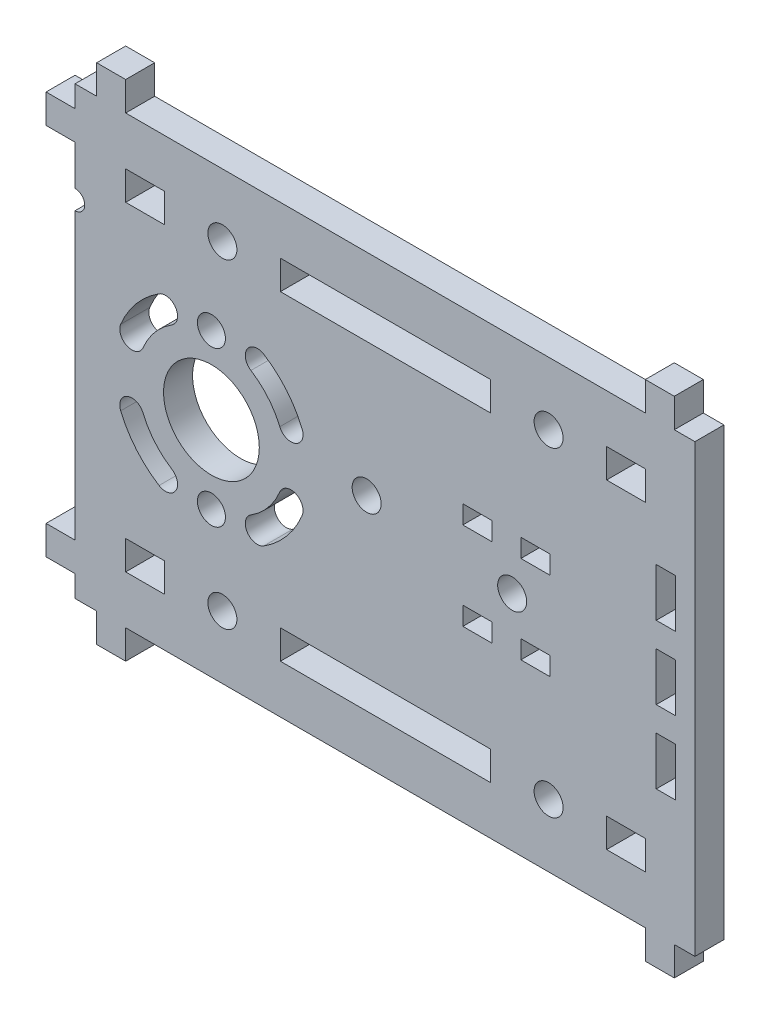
ISO-10303-21;
HEADER;
FILE_DESCRIPTION(('STEP AP214'),'2;1');
FILE_NAME('part.step','',(''),(''),'','','');
FILE_SCHEMA(('AUTOMOTIVE_DESIGN { 1 0 10303 214 1 1 1 1 }'));
ENDSEC;
DATA;
#1=APPLICATION_CONTEXT('core data for automotive mechanical design processes');
#2=APPLICATION_PROTOCOL_DEFINITION('international standard','automotive_design',2000,#1);
#3=PRODUCT_CONTEXT('',#1,'mechanical');
#4=PRODUCT('Part','Part','',(#3));
#5=PRODUCT_RELATED_PRODUCT_CATEGORY('part','',(#4));
#6=PRODUCT_DEFINITION_FORMATION('','',#4);
#7=PRODUCT_DEFINITION_CONTEXT('part definition',#1,'design');
#8=PRODUCT_DEFINITION('design','',#6,#7);
#9=PRODUCT_DEFINITION_SHAPE('','',#8);
#10=(LENGTH_UNIT() NAMED_UNIT(*) SI_UNIT(.MILLI.,.METRE.));
#11=(NAMED_UNIT(*) PLANE_ANGLE_UNIT() SI_UNIT($,.RADIAN.));
#12=(NAMED_UNIT(*) SI_UNIT($,.STERADIAN.) SOLID_ANGLE_UNIT());
#13=UNCERTAINTY_MEASURE_WITH_UNIT(LENGTH_MEASURE(1.E-05),#10,'distance_accuracy_value','');
#14=(GEOMETRIC_REPRESENTATION_CONTEXT(3) GLOBAL_UNCERTAINTY_ASSIGNED_CONTEXT((#13)) GLOBAL_UNIT_ASSIGNED_CONTEXT((#10,
#11,#12)) REPRESENTATION_CONTEXT('',''));
#15=CARTESIAN_POINT('',(0.,0.,0.));
#16=DIRECTION('',(0.,0.,1.));
#17=DIRECTION('',(1.,0.,0.));
#18=AXIS2_PLACEMENT_3D('',#15,#16,#17);
#19=CARTESIAN_POINT('',(139.713907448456,128.514314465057,3.));
#20=DIRECTION('',(0.,0.,1.));
#21=DIRECTION('',(1.,0.,0.));
#22=AXIS2_PLACEMENT_3D('',#19,#20,#21);
#23=PLANE('',#22);
#24=CARTESIAN_POINT('',(184.913907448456,115.828433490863,3.));
#25=DIRECTION('',(0.,0.,1.));
#26=DIRECTION('',(1.,0.,0.));
#27=AXIS2_PLACEMENT_3D('',#24,#25,#26);
#28=CIRCLE('',#27,1.5);
#29=CARTESIAN_POINT('',(186.413907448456,115.828433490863,3.));
#30=VERTEX_POINT('',#29);
#31=EDGE_CURVE('E1052',#30,#30,#28,.T.);
#32=ORIENTED_EDGE('',*,*,#31,.F.);
#33=EDGE_LOOP('',(#32));
#34=FACE_BOUND('',#33,.T.);
#35=CARTESIAN_POINT('',(188.682022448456,99.2784334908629,3.));
#36=DIRECTION('',(0.,0.,1.));
#37=DIRECTION('',(1.,0.,0.));
#38=AXIS2_PLACEMENT_3D('',#35,#36,#37);
#39=CIRCLE('',#38,1.5);
#40=CARTESIAN_POINT('',(190.182022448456,99.2784334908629,3.));
#41=VERTEX_POINT('',#40);
#42=EDGE_CURVE('E1064',#41,#41,#39,.T.);
#43=ORIENTED_EDGE('',*,*,#42,.F.);
#44=EDGE_LOOP('',(#43));
#45=FACE_BOUND('',#44,.T.);
#46=CARTESIAN_POINT('',(188.682022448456,132.378433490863,3.));
#47=DIRECTION('',(0.,0.,1.));
#48=DIRECTION('',(1.,0.,0.));
#49=AXIS2_PLACEMENT_3D('',#46,#47,#48);
#50=CIRCLE('',#49,1.5);
#51=CARTESIAN_POINT('',(190.182022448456,132.378433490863,3.));
#52=VERTEX_POINT('',#51);
#53=EDGE_CURVE('E1076',#52,#52,#50,.T.);
#54=ORIENTED_EDGE('',*,*,#53,.F.);
#55=EDGE_LOOP('',(#54));
#56=FACE_BOUND('',#55,.T.);
#57=CARTESIAN_POINT('',(153.813907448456,123.828433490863,3.));
#58=DIRECTION('',(0.,0.,1.));
#59=DIRECTION('',(1.,0.,0.));
#60=AXIS2_PLACEMENT_3D('',#57,#58,#59);
#61=CIRCLE('',#60,1.45002);
#62=CARTESIAN_POINT('',(155.263927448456,123.828433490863,3.));
#63=VERTEX_POINT('',#62);
#64=EDGE_CURVE('E1212',#63,#63,#61,.T.);
#65=ORIENTED_EDGE('',*,*,#64,.F.);
#66=EDGE_LOOP('',(#65));
#67=FACE_BOUND('',#66,.T.);
#68=CARTESIAN_POINT('',(139.713907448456,128.514314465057,3.));
#69=DIRECTION('',(0.,0.,-1.));
#70=DIRECTION('',(1.,0.,0.));
#71=AXIS2_PLACEMENT_3D('',#68,#69,#70);
#72=CIRCLE('',#71,1.);
#73=CARTESIAN_POINT('',(139.713907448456,129.514314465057,3.));
#74=VERTEX_POINT('',#73);
#75=CARTESIAN_POINT('',(139.713907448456,127.514314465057,3.));
#76=VERTEX_POINT('',#75);
#77=EDGE_CURVE('E1224',#74,#76,#72,.T.);
#78=ORIENTED_EDGE('',*,*,#77,.T.);
#79=DIRECTION('',(0.,-1.,0.));
#80=VECTOR('',#79,1.);
#81=CARTESIAN_POINT('',(139.713907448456,98.0103334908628,3.));
#82=LINE('',#81,#80);
#83=CARTESIAN_POINT('',(139.713907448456,98.0103334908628,3.));
#84=VERTEX_POINT('',#83);
#85=EDGE_CURVE('E1227',#76,#84,#82,.T.);
#86=ORIENTED_EDGE('',*,*,#85,.T.);
#87=DIRECTION('',(-1.,0.,0.));
#88=VECTOR('',#87,1.);
#89=CARTESIAN_POINT('',(139.713907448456,98.0103334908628,3.));
#90=LINE('',#89,#88);
#91=CARTESIAN_POINT('',(136.713907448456,98.0103334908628,3.));
#92=VERTEX_POINT('',#91);
#93=EDGE_CURVE('E1230',#84,#92,#90,.T.);
#94=ORIENTED_EDGE('',*,*,#93,.T.);
#95=DIRECTION('',(0.,-1.,0.));
#96=VECTOR('',#95,1.);
#97=CARTESIAN_POINT('',(136.713907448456,98.0103334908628,3.));
#98=LINE('',#97,#96);
#99=CARTESIAN_POINT('',(136.713907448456,95.0103334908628,3.));
#100=VERTEX_POINT('',#99);
#101=EDGE_CURVE('E1232',#92,#100,#98,.T.);
#102=ORIENTED_EDGE('',*,*,#101,.T.);
#103=DIRECTION('',(1.,0.,0.));
#104=VECTOR('',#103,1.);
#105=CARTESIAN_POINT('',(139.713907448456,95.0103334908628,3.));
#106=LINE('',#105,#104);
#107=CARTESIAN_POINT('',(139.713907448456,95.0103334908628,3.));
#108=VERTEX_POINT('',#107);
#109=EDGE_CURVE('E1234',#100,#108,#106,.T.);
#110=ORIENTED_EDGE('',*,*,#109,.T.);
#111=DIRECTION('',(0.,-1.,0.));
#112=VECTOR('',#111,1.);
#113=CARTESIAN_POINT('',(139.713907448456,92.7784334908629,3.));
#114=LINE('',#113,#112);
#115=CARTESIAN_POINT('',(139.713907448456,92.7784334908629,3.));
#116=VERTEX_POINT('',#115);
#117=EDGE_CURVE('E1236',#108,#116,#114,.T.);
#118=ORIENTED_EDGE('',*,*,#117,.T.);
#119=DIRECTION('',(1.,0.,0.));
#120=VECTOR('',#119,1.);
#121=CARTESIAN_POINT('',(139.713907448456,92.7784334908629,3.));
#122=LINE('',#121,#120);
#123=CARTESIAN_POINT('',(141.945791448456,92.7784334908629,3.));
#124=VERTEX_POINT('',#123);
#125=EDGE_CURVE('E1238',#116,#124,#122,.T.);
#126=ORIENTED_EDGE('',*,*,#125,.T.);
#127=DIRECTION('',(0.,-1.,0.));
#128=VECTOR('',#127,1.);
#129=CARTESIAN_POINT('',(141.945791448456,92.7784334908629,3.));
#130=LINE('',#129,#128);
#131=CARTESIAN_POINT('',(141.945791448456,89.7784334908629,3.));
#132=VERTEX_POINT('',#131);
#133=EDGE_CURVE('E1240',#124,#132,#130,.T.);
#134=ORIENTED_EDGE('',*,*,#133,.T.);
#135=DIRECTION('',(1.,0.,0.));
#136=VECTOR('',#135,1.);
#137=CARTESIAN_POINT('',(141.945791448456,89.7784334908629,3.));
#138=LINE('',#137,#136);
#139=CARTESIAN_POINT('',(144.945791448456,89.7784334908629,3.));
#140=VERTEX_POINT('',#139);
#141=EDGE_CURVE('E1242',#132,#140,#138,.T.);
#142=ORIENTED_EDGE('',*,*,#141,.T.);
#143=DIRECTION('',(0.,1.,0.));
#144=VECTOR('',#143,1.);
#145=CARTESIAN_POINT('',(144.945791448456,92.7784334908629,3.));
#146=LINE('',#145,#144);
#147=CARTESIAN_POINT('',(144.945791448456,92.7784334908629,3.));
#148=VERTEX_POINT('',#147);
#149=EDGE_CURVE('E1244',#140,#148,#146,.T.);
#150=ORIENTED_EDGE('',*,*,#149,.T.);
#151=DIRECTION('',(1.,0.,0.));
#152=VECTOR('',#151,1.);
#153=CARTESIAN_POINT('',(144.945791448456,92.7784334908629,3.));
#154=LINE('',#153,#152);
#155=CARTESIAN_POINT('',(198.682022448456,92.7784334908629,3.));
#156=VERTEX_POINT('',#155);
#157=EDGE_CURVE('E1246',#148,#156,#154,.T.);
#158=ORIENTED_EDGE('',*,*,#157,.T.);
#159=DIRECTION('',(0.,-1.,0.));
#160=VECTOR('',#159,1.);
#161=CARTESIAN_POINT('',(198.682022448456,89.7784334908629,3.));
#162=LINE('',#161,#160);
#163=CARTESIAN_POINT('',(198.682022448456,89.7784334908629,3.));
#164=VERTEX_POINT('',#163);
#165=EDGE_CURVE('E1248',#156,#164,#162,.T.);
#166=ORIENTED_EDGE('',*,*,#165,.T.);
#167=DIRECTION('',(1.,0.,0.));
#168=VECTOR('',#167,1.);
#169=CARTESIAN_POINT('',(198.682022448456,89.7784334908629,3.));
#170=LINE('',#169,#168);
#171=CARTESIAN_POINT('',(201.682022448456,89.7784334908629,3.));
#172=VERTEX_POINT('',#171);
#173=EDGE_CURVE('E1250',#164,#172,#170,.T.);
#174=ORIENTED_EDGE('',*,*,#173,.T.);
#175=DIRECTION('',(0.,1.,0.));
#176=VECTOR('',#175,1.);
#177=CARTESIAN_POINT('',(201.682022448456,89.7784334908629,3.));
#178=LINE('',#177,#176);
#179=CARTESIAN_POINT('',(201.682022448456,92.7784334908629,3.));
#180=VERTEX_POINT('',#179);
#181=EDGE_CURVE('E1252',#172,#180,#178,.T.);
#182=ORIENTED_EDGE('',*,*,#181,.T.);
#183=DIRECTION('',(1.,0.,0.));
#184=VECTOR('',#183,1.);
#185=CARTESIAN_POINT('',(201.682022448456,92.7784334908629,3.));
#186=LINE('',#185,#184);
#187=CARTESIAN_POINT('',(203.813907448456,92.7784334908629,3.));
#188=VERTEX_POINT('',#187);
#189=EDGE_CURVE('E1254',#180,#188,#186,.T.);
#190=ORIENTED_EDGE('',*,*,#189,.T.);
#191=DIRECTION('',(0.,1.,0.));
#192=VECTOR('',#191,1.);
#193=CARTESIAN_POINT('',(203.813907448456,138.878433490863,3.));
#194=LINE('',#193,#192);
#195=CARTESIAN_POINT('',(203.813907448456,138.878433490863,3.));
#196=VERTEX_POINT('',#195);
#197=EDGE_CURVE('E1256',#188,#196,#194,.T.);
#198=ORIENTED_EDGE('',*,*,#197,.T.);
#199=DIRECTION('',(-1.,0.,0.));
#200=VECTOR('',#199,1.);
#201=CARTESIAN_POINT('',(201.682022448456,138.878433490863,3.));
#202=LINE('',#201,#200);
#203=CARTESIAN_POINT('',(201.682022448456,138.878433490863,3.));
#204=VERTEX_POINT('',#203);
#205=EDGE_CURVE('E1258',#196,#204,#202,.T.);
#206=ORIENTED_EDGE('',*,*,#205,.T.);
#207=DIRECTION('',(0.,1.,0.));
#208=VECTOR('',#207,1.);
#209=CARTESIAN_POINT('',(201.682022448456,141.878433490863,3.));
#210=LINE('',#209,#208);
#211=CARTESIAN_POINT('',(201.682022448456,141.878433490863,3.));
#212=VERTEX_POINT('',#211);
#213=EDGE_CURVE('E1260',#204,#212,#210,.T.);
#214=ORIENTED_EDGE('',*,*,#213,.T.);
#215=DIRECTION('',(-1.,0.,0.));
#216=VECTOR('',#215,1.);
#217=CARTESIAN_POINT('',(198.682022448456,141.878433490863,3.));
#218=LINE('',#217,#216);
#219=CARTESIAN_POINT('',(198.682022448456,141.878433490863,3.));
#220=VERTEX_POINT('',#219);
#221=EDGE_CURVE('E1262',#212,#220,#218,.T.);
#222=ORIENTED_EDGE('',*,*,#221,.T.);
#223=DIRECTION('',(0.,-1.,0.));
#224=VECTOR('',#223,1.);
#225=CARTESIAN_POINT('',(198.682022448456,141.878433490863,3.));
#226=LINE('',#225,#224);
#227=CARTESIAN_POINT('',(198.682022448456,138.878433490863,3.));
#228=VERTEX_POINT('',#227);
#229=EDGE_CURVE('E1264',#220,#228,#226,.T.);
#230=ORIENTED_EDGE('',*,*,#229,.T.);
#231=DIRECTION('',(-1.,0.,0.));
#232=VECTOR('',#231,1.);
#233=CARTESIAN_POINT('',(144.945791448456,138.878433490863,3.));
#234=LINE('',#233,#232);
#235=CARTESIAN_POINT('',(144.945791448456,138.878433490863,3.));
#236=VERTEX_POINT('',#235);
#237=EDGE_CURVE('E1266',#228,#236,#234,.T.);
#238=ORIENTED_EDGE('',*,*,#237,.T.);
#239=DIRECTION('',(0.,1.,0.));
#240=VECTOR('',#239,1.);
#241=CARTESIAN_POINT('',(144.945791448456,138.878433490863,3.));
#242=LINE('',#241,#240);
#243=CARTESIAN_POINT('',(144.945791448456,141.878433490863,3.));
#244=VERTEX_POINT('',#243);
#245=EDGE_CURVE('E1268',#236,#244,#242,.T.);
#246=ORIENTED_EDGE('',*,*,#245,.T.);
#247=DIRECTION('',(-1.,0.,0.));
#248=VECTOR('',#247,1.);
#249=CARTESIAN_POINT('',(141.945791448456,141.878433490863,3.));
#250=LINE('',#249,#248);
#251=CARTESIAN_POINT('',(141.945791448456,141.878433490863,3.));
#252=VERTEX_POINT('',#251);
#253=EDGE_CURVE('E1270',#244,#252,#250,.T.);
#254=ORIENTED_EDGE('',*,*,#253,.T.);
#255=DIRECTION('',(0.,-1.,0.));
#256=VECTOR('',#255,1.);
#257=CARTESIAN_POINT('',(141.945791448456,138.878433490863,3.));
#258=LINE('',#257,#256);
#259=CARTESIAN_POINT('',(141.945791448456,138.878433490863,3.));
#260=VERTEX_POINT('',#259);
#261=EDGE_CURVE('E1272',#252,#260,#258,.T.);
#262=ORIENTED_EDGE('',*,*,#261,.T.);
#263=DIRECTION('',(-1.,0.,0.));
#264=VECTOR('',#263,1.);
#265=CARTESIAN_POINT('',(139.713907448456,138.878433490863,3.));
#266=LINE('',#265,#264);
#267=CARTESIAN_POINT('',(139.713907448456,138.878433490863,3.));
#268=VERTEX_POINT('',#267);
#269=EDGE_CURVE('E1274',#260,#268,#266,.T.);
#270=ORIENTED_EDGE('',*,*,#269,.T.);
#271=DIRECTION('',(0.,-1.,0.));
#272=VECTOR('',#271,1.);
#273=CARTESIAN_POINT('',(139.713907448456,136.646533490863,3.));
#274=LINE('',#273,#272);
#275=CARTESIAN_POINT('',(139.713907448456,136.646533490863,3.));
#276=VERTEX_POINT('',#275);
#277=EDGE_CURVE('E1276',#268,#276,#274,.T.);
#278=ORIENTED_EDGE('',*,*,#277,.T.);
#279=DIRECTION('',(-1.,0.,0.));
#280=VECTOR('',#279,1.);
#281=CARTESIAN_POINT('',(139.713907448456,136.646533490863,3.));
#282=LINE('',#281,#280);
#283=CARTESIAN_POINT('',(136.713907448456,136.646533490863,3.));
#284=VERTEX_POINT('',#283);
#285=EDGE_CURVE('E1278',#276,#284,#282,.T.);
#286=ORIENTED_EDGE('',*,*,#285,.T.);
#287=DIRECTION('',(0.,-1.,0.));
#288=VECTOR('',#287,1.);
#289=CARTESIAN_POINT('',(136.713907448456,133.646533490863,3.));
#290=LINE('',#289,#288);
#291=CARTESIAN_POINT('',(136.713907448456,133.646533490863,3.));
#292=VERTEX_POINT('',#291);
#293=EDGE_CURVE('E1280',#284,#292,#290,.T.);
#294=ORIENTED_EDGE('',*,*,#293,.T.);
#295=DIRECTION('',(1.,0.,0.));
#296=VECTOR('',#295,1.);
#297=CARTESIAN_POINT('',(139.713907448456,133.646533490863,3.));
#298=LINE('',#297,#296);
#299=CARTESIAN_POINT('',(139.713907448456,133.646533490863,3.));
#300=VERTEX_POINT('',#299);
#301=EDGE_CURVE('E1282',#292,#300,#298,.T.);
#302=ORIENTED_EDGE('',*,*,#301,.T.);
#303=DIRECTION('',(0.,-1.,0.));
#304=VECTOR('',#303,1.);
#305=CARTESIAN_POINT('',(139.713907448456,129.514314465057,3.));
#306=LINE('',#305,#304);
#307=EDGE_CURVE('E1284',#300,#74,#306,.T.);
#308=ORIENTED_EDGE('',*,*,#307,.T.);
#309=EDGE_LOOP('',(#78,#86,#94,#102,#110,#118,#126,#134,#142,#150,#158,#166,#174,#182,#190,#198,
#206,#214,#222,#230,#238,#246,#254,#262,#270,#278,#286,#294,#302,#308));
#310=FACE_BOUND('',#309,.T.);
#311=CARTESIAN_POINT('',(153.813907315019,115.828433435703,3.));
#312=DIRECTION('',(0.,0.,1.));
#313=DIRECTION('',(1.,0.,0.));
#314=AXIS2_PLACEMENT_3D('',#311,#312,#313);
#315=CIRCLE('',#314,4.95013299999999);
#316=CARTESIAN_POINT('',(158.764040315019,115.828433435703,3.));
#317=VERTEX_POINT('',#316);
#318=EDGE_CURVE('E1218',#317,#317,#315,.T.);
#319=ORIENTED_EDGE('',*,*,#318,.F.);
#320=EDGE_LOOP('',(#319));
#321=FACE_BOUND('',#320,.T.);
#322=CARTESIAN_POINT('',(153.813907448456,107.828433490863,3.));
#323=DIRECTION('',(0.,0.,1.));
#324=DIRECTION('',(1.,0.,0.));
#325=AXIS2_PLACEMENT_3D('',#322,#323,#324);
#326=CIRCLE('',#325,1.45000000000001);
#327=CARTESIAN_POINT('',(155.263907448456,107.828433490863,3.));
#328=VERTEX_POINT('',#327);
#329=EDGE_CURVE('E1206',#328,#328,#326,.T.);
#330=ORIENTED_EDGE('',*,*,#329,.F.);
#331=EDGE_LOOP('',(#330));
#332=FACE_BOUND('',#331,.T.);
#333=CARTESIAN_POINT('',(153.813907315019,115.828433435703,3.));
#334=DIRECTION('',(0.,0.,1.));
#335=DIRECTION('',(1.,0.,0.));
#336=AXIS2_PLACEMENT_3D('',#333,#334,#335);
#337=CIRCLE('',#336,10.150000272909);
#338=CARTESIAN_POINT('',(148.396772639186,124.411973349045,3.));
#339=VERTEX_POINT('',#338);
#340=CARTESIAN_POINT('',(144.433753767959,119.705961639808,3.));
#341=VERTEX_POINT('',#340);
#342=EDGE_CURVE('E1177',#339,#341,#337,.T.);
#343=ORIENTED_EDGE('',*,*,#342,.F.);
#344=CARTESIAN_POINT('',(149.063907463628,123.35488720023,3.));
#345=DIRECTION('',(0.,0.,1.));
#346=DIRECTION('',(1.,0.,0.));
#347=AXIS2_PLACEMENT_3D('',#344,#345,#346);
#348=CIRCLE('',#347,1.24999999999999);
#349=CARTESIAN_POINT('',(149.73104228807,122.297801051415,3.));
#350=VERTEX_POINT('',#349);
#351=EDGE_CURVE('E1175',#350,#339,#348,.T.);
#352=ORIENTED_EDGE('',*,*,#351,.F.);
#353=CARTESIAN_POINT('',(153.813907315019,115.828433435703,3.));
#354=DIRECTION('',(0.,0.,-1.));
#355=DIRECTION('',(1.,0.,0.));
#356=AXIS2_PLACEMENT_3D('',#353,#354,#355);
#357=CIRCLE('',#356,7.65000027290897);
#358=CARTESIAN_POINT('',(146.744136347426,118.750905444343,3.));
#359=VERTEX_POINT('',#358);
#360=EDGE_CURVE('E1183',#359,#350,#357,.T.);
#361=ORIENTED_EDGE('',*,*,#360,.F.);
#362=CARTESIAN_POINT('',(145.588945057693,119.228433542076,3.));
#363=DIRECTION('',(0.,0.,1.));
#364=DIRECTION('',(1.,0.,0.));
#365=AXIS2_PLACEMENT_3D('',#362,#363,#364);
#366=CIRCLE('',#365,1.25);
#367=EDGE_CURVE('E1180',#341,#359,#366,.T.);
#368=ORIENTED_EDGE('',*,*,#367,.F.);
#369=EDGE_LOOP('',(#343,#352,#361,#368));
#370=FACE_BOUND('',#369,.T.);
#371=CARTESIAN_POINT('',(153.813907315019,115.828433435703,3.));
#372=DIRECTION('',(0.,0.,1.));
#373=DIRECTION('',(1.,0.,0.));
#374=AXIS2_PLACEMENT_3D('',#371,#372,#373);
#375=CIRCLE('',#374,10.1499998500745);
#376=CARTESIAN_POINT('',(144.433754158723,111.950905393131,3.));
#377=VERTEX_POINT('',#376);
#378=CARTESIAN_POINT('',(148.396772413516,107.244894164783,3.));
#379=VERTEX_POINT('',#378);
#380=EDGE_CURVE('E1146',#377,#379,#375,.T.);
#381=ORIENTED_EDGE('',*,*,#380,.F.);
#382=CARTESIAN_POINT('',(145.588945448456,112.428433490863,3.));
#383=DIRECTION('',(0.,0.,1.));
#384=DIRECTION('',(1.,0.,0.));
#385=AXIS2_PLACEMENT_3D('',#382,#383,#384);
#386=CIRCLE('',#385,1.25000000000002);
#387=CARTESIAN_POINT('',(146.74413673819,112.905961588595,3.));
#388=VERTEX_POINT('',#387);
#389=EDGE_CURVE('E1144',#388,#377,#386,.T.);
#390=ORIENTED_EDGE('',*,*,#389,.F.);
#391=CARTESIAN_POINT('',(153.813907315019,115.828433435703,3.));
#392=DIRECTION('',(0.,0.,-1.));
#393=DIRECTION('',(1.,0.,0.));
#394=AXIS2_PLACEMENT_3D('',#391,#392,#393);
#395=CIRCLE('',#394,7.64999985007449);
#396=CARTESIAN_POINT('',(149.7310420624,109.359066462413,3.));
#397=VERTEX_POINT('',#396);
#398=EDGE_CURVE('E1152',#397,#388,#395,.T.);
#399=ORIENTED_EDGE('',*,*,#398,.F.);
#400=CARTESIAN_POINT('',(149.063907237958,108.301980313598,3.));
#401=DIRECTION('',(0.,0.,1.));
#402=DIRECTION('',(1.,0.,0.));
#403=AXIS2_PLACEMENT_3D('',#400,#401,#402);
#404=CIRCLE('',#403,1.25000000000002);
#405=EDGE_CURVE('E1149',#379,#397,#404,.T.);
#406=ORIENTED_EDGE('',*,*,#405,.F.);
#407=EDGE_LOOP('',(#381,#390,#399,#406));
#408=FACE_BOUND('',#407,.T.);
#409=CARTESIAN_POINT('',(153.813907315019,115.828433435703,3.));
#410=DIRECTION('',(0.,0.,1.));
#411=DIRECTION('',(1.,0.,0.));
#412=AXIS2_PLACEMENT_3D('',#409,#410,#411);
#413=CIRCLE('',#412,10.150000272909);
#414=CARTESIAN_POINT('',(163.194060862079,119.705961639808,3.));
#415=VERTEX_POINT('',#414);
#416=CARTESIAN_POINT('',(159.231041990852,124.411973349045,3.));
#417=VERTEX_POINT('',#416);
#418=EDGE_CURVE('E1115',#415,#417,#413,.T.);
#419=ORIENTED_EDGE('',*,*,#418,.F.);
#420=CARTESIAN_POINT('',(162.038869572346,119.228433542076,3.));
#421=DIRECTION('',(0.,0.,1.));
#422=DIRECTION('',(1.,0.,0.));
#423=AXIS2_PLACEMENT_3D('',#420,#421,#422);
#424=CIRCLE('',#423,1.25);
#425=CARTESIAN_POINT('',(160.883678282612,118.750905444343,3.));
#426=VERTEX_POINT('',#425);
#427=EDGE_CURVE('E1113',#426,#415,#424,.T.);
#428=ORIENTED_EDGE('',*,*,#427,.F.);
#429=CARTESIAN_POINT('',(153.813907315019,115.828433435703,3.));
#430=DIRECTION('',(0.,0.,-1.));
#431=DIRECTION('',(1.,0.,0.));
#432=AXIS2_PLACEMENT_3D('',#429,#430,#431);
#433=CIRCLE('',#432,7.65000027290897);
#434=CARTESIAN_POINT('',(157.896772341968,122.297801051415,3.));
#435=VERTEX_POINT('',#434);
#436=EDGE_CURVE('E1121',#435,#426,#433,.T.);
#437=ORIENTED_EDGE('',*,*,#436,.F.);
#438=CARTESIAN_POINT('',(158.56390716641,123.35488720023,3.));
#439=DIRECTION('',(0.,0.,1.));
#440=DIRECTION('',(1.,0.,0.));
#441=AXIS2_PLACEMENT_3D('',#438,#439,#440);
#442=CIRCLE('',#441,1.25000000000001);
#443=EDGE_CURVE('E1118',#417,#435,#442,.T.);
#444=ORIENTED_EDGE('',*,*,#443,.F.);
#445=EDGE_LOOP('',(#419,#428,#437,#444));
#446=FACE_BOUND('',#445,.T.);
#447=CARTESIAN_POINT('',(153.813907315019,115.828433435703,3.));
#448=DIRECTION('',(0.,0.,1.));
#449=DIRECTION('',(1.,0.,0.));
#450=AXIS2_PLACEMENT_3D('',#447,#448,#449);
#451=CIRCLE('',#450,10.1500000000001);
#452=CARTESIAN_POINT('',(159.231042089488,107.244893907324,3.));
#453=VERTEX_POINT('',#452);
#454=CARTESIAN_POINT('',(163.194060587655,111.950905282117,3.));
#455=VERTEX_POINT('',#454);
#456=EDGE_CURVE('E1084',#453,#455,#451,.T.);
#457=ORIENTED_EDGE('',*,*,#456,.F.);
#458=CARTESIAN_POINT('',(158.563907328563,108.301980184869,3.));
#459=DIRECTION('',(0.,0.,1.));
#460=DIRECTION('',(1.,0.,0.));
#461=AXIS2_PLACEMENT_3D('',#458,#459,#460);
#462=CIRCLE('',#461,1.25000007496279);
#463=CARTESIAN_POINT('',(157.896772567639,109.359066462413,3.));
#464=VERTEX_POINT('',#463);
#465=EDGE_CURVE('E1082',#464,#453,#462,.T.);
#466=ORIENTED_EDGE('',*,*,#465,.F.);
#467=CARTESIAN_POINT('',(153.813907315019,115.828433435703,3.));
#468=DIRECTION('',(0.,0.,-1.));
#469=DIRECTION('',(1.,0.,0.));
#470=AXIS2_PLACEMENT_3D('',#467,#468,#469);
#471=CIRCLE('',#470,7.64999985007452);
#472=CARTESIAN_POINT('',(160.883677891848,112.905961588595,3.));
#473=VERTEX_POINT('',#472);
#474=EDGE_CURVE('E1090',#473,#464,#471,.T.);
#475=ORIENTED_EDGE('',*,*,#474,.F.);
#476=CARTESIAN_POINT('',(162.038869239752,112.428433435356,3.));
#477=DIRECTION('',(0.,0.,1.));
#478=DIRECTION('',(1.,0.,0.));
#479=AXIS2_PLACEMENT_3D('',#476,#477,#478);
#480=CIRCLE('',#479,1.25000007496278);
#481=EDGE_CURVE('E1087',#455,#473,#480,.T.);
#482=ORIENTED_EDGE('',*,*,#481,.F.);
#483=EDGE_LOOP('',(#457,#466,#475,#482));
#484=FACE_BOUND('',#483,.T.);
#485=CARTESIAN_POINT('',(154.945791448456,132.378433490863,3.));
#486=DIRECTION('',(0.,0.,1.));
#487=DIRECTION('',(1.,0.,0.));
#488=AXIS2_PLACEMENT_3D('',#485,#486,#487);
#489=CIRCLE('',#488,1.5);
#490=CARTESIAN_POINT('',(156.445791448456,132.378433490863,3.));
#491=VERTEX_POINT('',#490);
#492=EDGE_CURVE('E1070',#491,#491,#489,.T.);
#493=ORIENTED_EDGE('',*,*,#492,.F.);
#494=EDGE_LOOP('',(#493));
#495=FACE_BOUND('',#494,.T.);
#496=CARTESIAN_POINT('',(154.945791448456,99.2784334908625,3.));
#497=DIRECTION('',(0.,0.,1.));
#498=DIRECTION('',(1.,0.,0.));
#499=AXIS2_PLACEMENT_3D('',#496,#497,#498);
#500=CIRCLE('',#499,1.5);
#501=CARTESIAN_POINT('',(156.445791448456,99.2784334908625,3.));
#502=VERTEX_POINT('',#501);
#503=EDGE_CURVE('E1058',#502,#502,#500,.T.);
#504=ORIENTED_EDGE('',*,*,#503,.F.);
#505=EDGE_LOOP('',(#504));
#506=FACE_BOUND('',#505,.T.);
#507=CARTESIAN_POINT('',(169.865515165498,117.075786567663,3.));
#508=DIRECTION('',(0.,0.,1.));
#509=DIRECTION('',(1.,0.,0.));
#510=AXIS2_PLACEMENT_3D('',#507,#508,#509);
#511=CIRCLE('',#510,1.5);
#512=CARTESIAN_POINT('',(171.365515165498,117.075786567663,3.));
#513=VERTEX_POINT('',#512);
#514=EDGE_CURVE('E1046',#513,#513,#511,.T.);
#515=ORIENTED_EDGE('',*,*,#514,.F.);
#516=EDGE_LOOP('',(#515));
#517=FACE_BOUND('',#516,.T.);
#518=DIRECTION('',(1.,0.,0.));
#519=VECTOR('',#518,1.);
#520=CARTESIAN_POINT('',(144.945791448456,130.878433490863,3.));
#521=LINE('',#520,#519);
#522=CARTESIAN_POINT('',(144.945791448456,130.878433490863,3.));
#523=VERTEX_POINT('',#522);
#524=CARTESIAN_POINT('',(148.945791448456,130.878433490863,3.));
#525=VERTEX_POINT('',#524);
#526=EDGE_CURVE('E1017',#523,#525,#521,.T.);
#527=ORIENTED_EDGE('',*,*,#526,.F.);
#528=DIRECTION('',(0.,-1.,0.));
#529=VECTOR('',#528,1.);
#530=CARTESIAN_POINT('',(144.945791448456,130.878433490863,3.));
#531=LINE('',#530,#529);
#532=CARTESIAN_POINT('',(144.945791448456,133.878433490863,3.));
#533=VERTEX_POINT('',#532);
#534=EDGE_CURVE('E1015',#533,#523,#531,.T.);
#535=ORIENTED_EDGE('',*,*,#534,.F.);
#536=DIRECTION('',(-1.,0.,0.));
#537=VECTOR('',#536,1.);
#538=CARTESIAN_POINT('',(144.945791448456,133.878433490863,3.));
#539=LINE('',#538,#537);
#540=CARTESIAN_POINT('',(148.945791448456,133.878433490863,3.));
#541=VERTEX_POINT('',#540);
#542=EDGE_CURVE('E1023',#541,#533,#539,.T.);
#543=ORIENTED_EDGE('',*,*,#542,.F.);
#544=DIRECTION('',(0.,1.,0.));
#545=VECTOR('',#544,1.);
#546=CARTESIAN_POINT('',(148.945791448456,130.878433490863,3.));
#547=LINE('',#546,#545);
#548=EDGE_CURVE('E1020',#525,#541,#547,.T.);
#549=ORIENTED_EDGE('',*,*,#548,.F.);
#550=EDGE_LOOP('',(#527,#535,#543,#549));
#551=FACE_BOUND('',#550,.T.);
#552=DIRECTION('',(1.,0.,0.));
#553=VECTOR('',#552,1.);
#554=CARTESIAN_POINT('',(160.945791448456,130.878433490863,3.));
#555=LINE('',#554,#553);
#556=CARTESIAN_POINT('',(160.945791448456,130.878433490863,3.));
#557=VERTEX_POINT('',#556);
#558=CARTESIAN_POINT('',(182.682022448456,130.878433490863,3.));
#559=VERTEX_POINT('',#558);
#560=EDGE_CURVE('E986',#557,#559,#555,.T.);
#561=ORIENTED_EDGE('',*,*,#560,.F.);
#562=DIRECTION('',(0.,-1.,0.));
#563=VECTOR('',#562,1.);
#564=CARTESIAN_POINT('',(160.945791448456,130.878433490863,3.));
#565=LINE('',#564,#563);
#566=CARTESIAN_POINT('',(160.945791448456,133.878433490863,3.));
#567=VERTEX_POINT('',#566);
#568=EDGE_CURVE('E984',#567,#557,#565,.T.);
#569=ORIENTED_EDGE('',*,*,#568,.F.);
#570=DIRECTION('',(-1.,0.,0.));
#571=VECTOR('',#570,1.);
#572=CARTESIAN_POINT('',(160.945791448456,133.878433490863,3.));
#573=LINE('',#572,#571);
#574=CARTESIAN_POINT('',(182.682022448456,133.878433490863,3.));
#575=VERTEX_POINT('',#574);
#576=EDGE_CURVE('E992',#575,#567,#573,.T.);
#577=ORIENTED_EDGE('',*,*,#576,.F.);
#578=DIRECTION('',(0.,1.,0.));
#579=VECTOR('',#578,1.);
#580=CARTESIAN_POINT('',(182.682022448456,133.878433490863,3.));
#581=LINE('',#580,#579);
#582=EDGE_CURVE('E989',#559,#575,#581,.T.);
#583=ORIENTED_EDGE('',*,*,#582,.F.);
#584=EDGE_LOOP('',(#561,#569,#577,#583));
#585=FACE_BOUND('',#584,.T.);
#586=DIRECTION('',(1.,0.,0.));
#587=VECTOR('',#586,1.);
#588=CARTESIAN_POINT('',(194.682022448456,130.878433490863,3.));
#589=LINE('',#588,#587);
#590=CARTESIAN_POINT('',(194.682022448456,130.878433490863,3.));
#591=VERTEX_POINT('',#590);
#592=CARTESIAN_POINT('',(198.682022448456,130.878433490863,3.));
#593=VERTEX_POINT('',#592);
#594=EDGE_CURVE('E955',#591,#593,#589,.T.);
#595=ORIENTED_EDGE('',*,*,#594,.F.);
#596=DIRECTION('',(0.,-1.,0.));
#597=VECTOR('',#596,1.);
#598=CARTESIAN_POINT('',(194.682022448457,133.878433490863,3.));
#599=LINE('',#598,#597);
#600=CARTESIAN_POINT('',(194.682022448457,133.878433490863,3.));
#601=VERTEX_POINT('',#600);
#602=EDGE_CURVE('E953',#601,#591,#599,.T.);
#603=ORIENTED_EDGE('',*,*,#602,.F.);
#604=DIRECTION('',(-1.,0.,0.));
#605=VECTOR('',#604,1.);
#606=CARTESIAN_POINT('',(194.682022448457,133.878433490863,3.));
#607=LINE('',#606,#605);
#608=CARTESIAN_POINT('',(198.682022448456,133.878433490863,3.));
#609=VERTEX_POINT('',#608);
#610=EDGE_CURVE('E961',#609,#601,#607,.T.);
#611=ORIENTED_EDGE('',*,*,#610,.F.);
#612=DIRECTION('',(0.,1.,0.));
#613=VECTOR('',#612,1.);
#614=CARTESIAN_POINT('',(198.682022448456,133.878433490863,3.));
#615=LINE('',#614,#613);
#616=EDGE_CURVE('E958',#593,#609,#615,.T.);
#617=ORIENTED_EDGE('',*,*,#616,.F.);
#618=EDGE_LOOP('',(#595,#603,#611,#617));
#619=FACE_BOUND('',#618,.T.);
#620=DIRECTION('',(1.,0.,0.));
#621=VECTOR('',#620,1.);
#622=CARTESIAN_POINT('',(144.945791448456,97.778433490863,3.));
#623=LINE('',#622,#621);
#624=CARTESIAN_POINT('',(144.945791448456,97.778433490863,3.));
#625=VERTEX_POINT('',#624);
#626=CARTESIAN_POINT('',(148.945791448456,97.778433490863,3.));
#627=VERTEX_POINT('',#626);
#628=EDGE_CURVE('E924',#625,#627,#623,.T.);
#629=ORIENTED_EDGE('',*,*,#628,.F.);
#630=DIRECTION('',(0.,-1.,0.));
#631=VECTOR('',#630,1.);
#632=CARTESIAN_POINT('',(144.945791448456,100.778433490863,3.));
#633=LINE('',#632,#631);
#634=CARTESIAN_POINT('',(144.945791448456,100.778433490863,3.));
#635=VERTEX_POINT('',#634);
#636=EDGE_CURVE('E922',#635,#625,#633,.T.);
#637=ORIENTED_EDGE('',*,*,#636,.F.);
#638=DIRECTION('',(-1.,0.,0.));
#639=VECTOR('',#638,1.);
#640=CARTESIAN_POINT('',(144.945791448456,100.778433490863,3.));
#641=LINE('',#640,#639);
#642=CARTESIAN_POINT('',(148.945791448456,100.778433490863,3.));
#643=VERTEX_POINT('',#642);
#644=EDGE_CURVE('E930',#643,#635,#641,.T.);
#645=ORIENTED_EDGE('',*,*,#644,.F.);
#646=DIRECTION('',(0.,1.,0.));
#647=VECTOR('',#646,1.);
#648=CARTESIAN_POINT('',(148.945791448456,100.778433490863,3.));
#649=LINE('',#648,#647);
#650=EDGE_CURVE('E927',#627,#643,#649,.T.);
#651=ORIENTED_EDGE('',*,*,#650,.F.);
#652=EDGE_LOOP('',(#629,#637,#645,#651));
#653=FACE_BOUND('',#652,.T.);
#654=DIRECTION('',(1.,0.,0.));
#655=VECTOR('',#654,1.);
#656=CARTESIAN_POINT('',(160.945791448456,97.778433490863,3.));
#657=LINE('',#656,#655);
#658=CARTESIAN_POINT('',(160.945791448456,97.778433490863,3.));
#659=VERTEX_POINT('',#658);
#660=CARTESIAN_POINT('',(182.682022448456,97.7784334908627,3.));
#661=VERTEX_POINT('',#660);
#662=EDGE_CURVE('E893',#659,#661,#657,.T.);
#663=ORIENTED_EDGE('',*,*,#662,.F.);
#664=DIRECTION('',(0.,-1.,0.));
#665=VECTOR('',#664,1.);
#666=CARTESIAN_POINT('',(160.945791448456,100.778433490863,3.));
#667=LINE('',#666,#665);
#668=CARTESIAN_POINT('',(160.945791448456,100.778433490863,3.));
#669=VERTEX_POINT('',#668);
#670=EDGE_CURVE('E891',#669,#659,#667,.T.);
#671=ORIENTED_EDGE('',*,*,#670,.F.);
#672=DIRECTION('',(-1.,0.,0.));
#673=VECTOR('',#672,1.);
#674=CARTESIAN_POINT('',(160.945791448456,100.778433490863,3.));
#675=LINE('',#674,#673);
#676=CARTESIAN_POINT('',(182.682022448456,100.778433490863,3.));
#677=VERTEX_POINT('',#676);
#678=EDGE_CURVE('E899',#677,#669,#675,.T.);
#679=ORIENTED_EDGE('',*,*,#678,.F.);
#680=DIRECTION('',(0.,1.,0.));
#681=VECTOR('',#680,1.);
#682=CARTESIAN_POINT('',(182.682022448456,97.7784334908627,3.));
#683=LINE('',#682,#681);
#684=EDGE_CURVE('E896',#661,#677,#683,.T.);
#685=ORIENTED_EDGE('',*,*,#684,.F.);
#686=EDGE_LOOP('',(#663,#671,#679,#685));
#687=FACE_BOUND('',#686,.T.);
#688=DIRECTION('',(1.,0.,0.));
#689=VECTOR('',#688,1.);
#690=CARTESIAN_POINT('',(194.682022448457,97.7784334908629,3.));
#691=LINE('',#690,#689);
#692=CARTESIAN_POINT('',(194.682022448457,97.7784334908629,3.));
#693=VERTEX_POINT('',#692);
#694=CARTESIAN_POINT('',(198.682022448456,97.778433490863,3.));
#695=VERTEX_POINT('',#694);
#696=EDGE_CURVE('E862',#693,#695,#691,.T.);
#697=ORIENTED_EDGE('',*,*,#696,.F.);
#698=DIRECTION('',(0.,-1.,0.));
#699=VECTOR('',#698,1.);
#700=CARTESIAN_POINT('',(194.682022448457,97.7784334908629,3.));
#701=LINE('',#700,#699);
#702=CARTESIAN_POINT('',(194.682022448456,100.778433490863,3.));
#703=VERTEX_POINT('',#702);
#704=EDGE_CURVE('E860',#703,#693,#701,.T.);
#705=ORIENTED_EDGE('',*,*,#704,.F.);
#706=DIRECTION('',(-1.,0.,0.));
#707=VECTOR('',#706,1.);
#708=CARTESIAN_POINT('',(194.682022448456,100.778433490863,3.));
#709=LINE('',#708,#707);
#710=CARTESIAN_POINT('',(198.682022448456,100.778433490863,3.));
#711=VERTEX_POINT('',#710);
#712=EDGE_CURVE('E868',#711,#703,#709,.T.);
#713=ORIENTED_EDGE('',*,*,#712,.F.);
#714=DIRECTION('',(0.,1.,0.));
#715=VECTOR('',#714,1.);
#716=CARTESIAN_POINT('',(198.682022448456,97.778433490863,3.));
#717=LINE('',#716,#715);
#718=EDGE_CURVE('E865',#695,#711,#717,.T.);
#719=ORIENTED_EDGE('',*,*,#718,.F.);
#720=EDGE_LOOP('',(#697,#705,#713,#719));
#721=FACE_BOUND('',#720,.T.);
#722=DIRECTION('',(0.,-1.,0.));
#723=VECTOR('',#722,1.);
#724=CARTESIAN_POINT('',(185.81394279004,121.319524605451,3.));
#725=LINE('',#724,#723);
#726=CARTESIAN_POINT('',(185.81394279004,121.319524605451,3.));
#727=VERTEX_POINT('',#726);
#728=CARTESIAN_POINT('',(185.81394279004,119.419524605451,3.));
#729=VERTEX_POINT('',#728);
#730=EDGE_CURVE('E831',#727,#729,#725,.T.);
#731=ORIENTED_EDGE('',*,*,#730,.F.);
#732=DIRECTION('',(-1.,0.,0.));
#733=VECTOR('',#732,1.);
#734=CARTESIAN_POINT('',(185.81394279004,121.319524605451,3.));
#735=LINE('',#734,#733);
#736=CARTESIAN_POINT('',(188.81394279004,121.319524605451,3.));
#737=VERTEX_POINT('',#736);
#738=EDGE_CURVE('E829',#737,#727,#735,.T.);
#739=ORIENTED_EDGE('',*,*,#738,.F.);
#740=DIRECTION('',(0.,1.,0.));
#741=VECTOR('',#740,1.);
#742=CARTESIAN_POINT('',(188.81394279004,121.319524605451,3.));
#743=LINE('',#742,#741);
#744=CARTESIAN_POINT('',(188.81394279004,119.419524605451,3.));
#745=VERTEX_POINT('',#744);
#746=EDGE_CURVE('E837',#745,#737,#743,.T.);
#747=ORIENTED_EDGE('',*,*,#746,.F.);
#748=DIRECTION('',(1.,0.,0.));
#749=VECTOR('',#748,1.);
#750=CARTESIAN_POINT('',(185.81394279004,119.419524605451,3.));
#751=LINE('',#750,#749);
#752=EDGE_CURVE('E834',#729,#745,#751,.T.);
#753=ORIENTED_EDGE('',*,*,#752,.F.);
#754=EDGE_LOOP('',(#731,#739,#747,#753));
#755=FACE_BOUND('',#754,.T.);
#756=DIRECTION('',(0.,-1.,0.));
#757=VECTOR('',#756,1.);
#758=CARTESIAN_POINT('',(179.81394279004,121.319524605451,3.));
#759=LINE('',#758,#757);
#760=CARTESIAN_POINT('',(179.81394279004,121.319524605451,3.));
#761=VERTEX_POINT('',#760);
#762=CARTESIAN_POINT('',(179.81394279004,119.419524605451,3.));
#763=VERTEX_POINT('',#762);
#764=EDGE_CURVE('E800',#761,#763,#759,.T.);
#765=ORIENTED_EDGE('',*,*,#764,.F.);
#766=DIRECTION('',(-1.,0.,0.));
#767=VECTOR('',#766,1.);
#768=CARTESIAN_POINT('',(179.81394279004,121.319524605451,3.));
#769=LINE('',#768,#767);
#770=CARTESIAN_POINT('',(182.81394279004,121.319524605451,3.));
#771=VERTEX_POINT('',#770);
#772=EDGE_CURVE('E798',#771,#761,#769,.T.);
#773=ORIENTED_EDGE('',*,*,#772,.F.);
#774=DIRECTION('',(0.,1.,0.));
#775=VECTOR('',#774,1.);
#776=CARTESIAN_POINT('',(182.81394279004,121.319524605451,3.));
#777=LINE('',#776,#775);
#778=CARTESIAN_POINT('',(182.81394279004,119.419524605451,3.));
#779=VERTEX_POINT('',#778);
#780=EDGE_CURVE('E806',#779,#771,#777,.T.);
#781=ORIENTED_EDGE('',*,*,#780,.F.);
#782=DIRECTION('',(1.,0.,0.));
#783=VECTOR('',#782,1.);
#784=CARTESIAN_POINT('',(179.81394279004,119.419524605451,3.));
#785=LINE('',#784,#783);
#786=EDGE_CURVE('E803',#763,#779,#785,.T.);
#787=ORIENTED_EDGE('',*,*,#786,.F.);
#788=EDGE_LOOP('',(#765,#773,#781,#787));
#789=FACE_BOUND('',#788,.T.);
#790=DIRECTION('',(0.,1.,0.));
#791=VECTOR('',#790,1.);
#792=CARTESIAN_POINT('',(188.81394279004,110.337342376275,3.));
#793=LINE('',#792,#791);
#794=CARTESIAN_POINT('',(188.81394279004,110.337342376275,3.));
#795=VERTEX_POINT('',#794);
#796=CARTESIAN_POINT('',(188.81394279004,112.237342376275,3.));
#797=VERTEX_POINT('',#796);
#798=EDGE_CURVE('E769',#795,#797,#793,.T.);
#799=ORIENTED_EDGE('',*,*,#798,.F.);
#800=DIRECTION('',(1.,0.,0.));
#801=VECTOR('',#800,1.);
#802=CARTESIAN_POINT('',(185.81394279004,110.337342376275,3.));
#803=LINE('',#802,#801);
#804=CARTESIAN_POINT('',(185.81394279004,110.337342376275,3.));
#805=VERTEX_POINT('',#804);
#806=EDGE_CURVE('E767',#805,#795,#803,.T.);
#807=ORIENTED_EDGE('',*,*,#806,.F.);
#808=DIRECTION('',(0.,-1.,0.));
#809=VECTOR('',#808,1.);
#810=CARTESIAN_POINT('',(185.81394279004,110.337342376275,3.));
#811=LINE('',#810,#809);
#812=CARTESIAN_POINT('',(185.81394279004,112.237342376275,3.));
#813=VERTEX_POINT('',#812);
#814=EDGE_CURVE('E775',#813,#805,#811,.T.);
#815=ORIENTED_EDGE('',*,*,#814,.F.);
#816=DIRECTION('',(-1.,0.,0.));
#817=VECTOR('',#816,1.);
#818=CARTESIAN_POINT('',(185.81394279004,112.237342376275,3.));
#819=LINE('',#818,#817);
#820=EDGE_CURVE('E772',#797,#813,#819,.T.);
#821=ORIENTED_EDGE('',*,*,#820,.F.);
#822=EDGE_LOOP('',(#799,#807,#815,#821));
#823=FACE_BOUND('',#822,.T.);
#824=DIRECTION('',(0.,1.,0.));
#825=VECTOR('',#824,1.);
#826=CARTESIAN_POINT('',(182.81394279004,110.337342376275,3.));
#827=LINE('',#826,#825);
#828=CARTESIAN_POINT('',(182.81394279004,110.337342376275,3.));
#829=VERTEX_POINT('',#828);
#830=CARTESIAN_POINT('',(182.81394279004,112.237342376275,3.));
#831=VERTEX_POINT('',#830);
#832=EDGE_CURVE('E738',#829,#831,#827,.T.);
#833=ORIENTED_EDGE('',*,*,#832,.F.);
#834=DIRECTION('',(1.,0.,0.));
#835=VECTOR('',#834,1.);
#836=CARTESIAN_POINT('',(179.81394279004,110.337342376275,3.));
#837=LINE('',#836,#835);
#838=CARTESIAN_POINT('',(179.81394279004,110.337342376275,3.));
#839=VERTEX_POINT('',#838);
#840=EDGE_CURVE('E736',#839,#829,#837,.T.);
#841=ORIENTED_EDGE('',*,*,#840,.F.);
#842=DIRECTION('',(0.,-1.,0.));
#843=VECTOR('',#842,1.);
#844=CARTESIAN_POINT('',(179.81394279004,110.337342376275,3.));
#845=LINE('',#844,#843);
#846=CARTESIAN_POINT('',(179.81394279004,112.237342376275,3.));
#847=VERTEX_POINT('',#846);
#848=EDGE_CURVE('E744',#847,#839,#845,.T.);
#849=ORIENTED_EDGE('',*,*,#848,.F.);
#850=DIRECTION('',(-1.,0.,0.));
#851=VECTOR('',#850,1.);
#852=CARTESIAN_POINT('',(179.81394279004,112.237342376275,3.));
#853=LINE('',#852,#851);
#854=EDGE_CURVE('E741',#831,#847,#853,.T.);
#855=ORIENTED_EDGE('',*,*,#854,.F.);
#856=EDGE_LOOP('',(#833,#841,#849,#855));
#857=FACE_BOUND('',#856,.T.);
#858=DIRECTION('',(0.,-1.,0.));
#859=VECTOR('',#858,1.);
#860=CARTESIAN_POINT('',(199.813907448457,125.878433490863,3.));
#861=LINE('',#860,#859);
#862=CARTESIAN_POINT('',(199.813907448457,125.878433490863,3.));
#863=VERTEX_POINT('',#862);
#864=CARTESIAN_POINT('',(199.813907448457,120.878433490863,3.));
#865=VERTEX_POINT('',#864);
#866=EDGE_CURVE('E707',#863,#865,#861,.T.);
#867=ORIENTED_EDGE('',*,*,#866,.F.);
#868=DIRECTION('',(-1.,0.,0.));
#869=VECTOR('',#868,1.);
#870=CARTESIAN_POINT('',(199.813907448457,125.878433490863,3.));
#871=LINE('',#870,#869);
#872=CARTESIAN_POINT('',(201.813907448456,125.878433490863,3.));
#873=VERTEX_POINT('',#872);
#874=EDGE_CURVE('E705',#873,#863,#871,.T.);
#875=ORIENTED_EDGE('',*,*,#874,.F.);
#876=DIRECTION('',(0.,1.,0.));
#877=VECTOR('',#876,1.);
#878=CARTESIAN_POINT('',(201.813907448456,125.878433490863,3.));
#879=LINE('',#878,#877);
#880=CARTESIAN_POINT('',(201.813907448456,120.878433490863,3.));
#881=VERTEX_POINT('',#880);
#882=EDGE_CURVE('E713',#881,#873,#879,.T.);
#883=ORIENTED_EDGE('',*,*,#882,.F.);
#884=DIRECTION('',(1.,0.,0.));
#885=VECTOR('',#884,1.);
#886=CARTESIAN_POINT('',(199.813907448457,120.878433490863,3.));
#887=LINE('',#886,#885);
#888=EDGE_CURVE('E710',#865,#881,#887,.T.);
#889=ORIENTED_EDGE('',*,*,#888,.F.);
#890=EDGE_LOOP('',(#867,#875,#883,#889));
#891=FACE_BOUND('',#890,.T.);
#892=DIRECTION('',(0.,-1.,0.));
#893=VECTOR('',#892,1.);
#894=CARTESIAN_POINT('',(199.813907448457,118.328433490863,3.));
#895=LINE('',#894,#893);
#896=CARTESIAN_POINT('',(199.813907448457,118.328433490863,3.));
#897=VERTEX_POINT('',#896);
#898=CARTESIAN_POINT('',(199.813907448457,113.328433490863,3.));
#899=VERTEX_POINT('',#898);
#900=EDGE_CURVE('E676',#897,#899,#895,.T.);
#901=ORIENTED_EDGE('',*,*,#900,.F.);
#902=DIRECTION('',(-1.,0.,0.));
#903=VECTOR('',#902,1.);
#904=CARTESIAN_POINT('',(199.813907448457,118.328433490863,3.));
#905=LINE('',#904,#903);
#906=CARTESIAN_POINT('',(201.813907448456,118.328433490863,3.));
#907=VERTEX_POINT('',#906);
#908=EDGE_CURVE('E674',#907,#897,#905,.T.);
#909=ORIENTED_EDGE('',*,*,#908,.F.);
#910=DIRECTION('',(0.,1.,0.));
#911=VECTOR('',#910,1.);
#912=CARTESIAN_POINT('',(201.813907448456,118.328433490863,3.));
#913=LINE('',#912,#911);
#914=CARTESIAN_POINT('',(201.813907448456,113.328433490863,3.));
#915=VERTEX_POINT('',#914);
#916=EDGE_CURVE('E682',#915,#907,#913,.T.);
#917=ORIENTED_EDGE('',*,*,#916,.F.);
#918=DIRECTION('',(1.,0.,0.));
#919=VECTOR('',#918,1.);
#920=CARTESIAN_POINT('',(199.813907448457,113.328433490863,3.));
#921=LINE('',#920,#919);
#922=EDGE_CURVE('E679',#899,#915,#921,.T.);
#923=ORIENTED_EDGE('',*,*,#922,.F.);
#924=EDGE_LOOP('',(#901,#909,#917,#923));
#925=FACE_BOUND('',#924,.T.);
#926=DIRECTION('',(0.,-1.,0.));
#927=VECTOR('',#926,1.);
#928=CARTESIAN_POINT('',(199.813907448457,110.778433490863,3.));
#929=LINE('',#928,#927);
#930=CARTESIAN_POINT('',(199.813907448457,110.778433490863,3.));
#931=VERTEX_POINT('',#930);
#932=CARTESIAN_POINT('',(199.813907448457,105.778433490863,3.));
#933=VERTEX_POINT('',#932);
#934=EDGE_CURVE('E646',#931,#933,#929,.T.);
#935=ORIENTED_EDGE('',*,*,#934,.F.);
#936=DIRECTION('',(-1.,0.,0.));
#937=VECTOR('',#936,1.);
#938=CARTESIAN_POINT('',(199.813907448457,110.778433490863,3.));
#939=LINE('',#938,#937);
#940=CARTESIAN_POINT('',(201.813907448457,110.778433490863,3.));
#941=VERTEX_POINT('',#940);
#942=EDGE_CURVE('E638',#941,#931,#939,.T.);
#943=ORIENTED_EDGE('',*,*,#942,.F.);
#944=DIRECTION('',(0.,1.,0.));
#945=VECTOR('',#944,1.);
#946=CARTESIAN_POINT('',(201.813907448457,110.778433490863,3.));
#947=LINE('',#946,#945);
#948=CARTESIAN_POINT('',(201.813907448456,105.778433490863,3.));
#949=VERTEX_POINT('',#948);
#950=EDGE_CURVE('E660',#949,#941,#947,.T.);
#951=ORIENTED_EDGE('',*,*,#950,.F.);
#952=DIRECTION('',(1.,0.,0.));
#953=VECTOR('',#952,1.);
#954=CARTESIAN_POINT('',(199.813907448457,105.778433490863,3.));
#955=LINE('',#954,#953);
#956=EDGE_CURVE('E658',#933,#949,#955,.T.);
#957=ORIENTED_EDGE('',*,*,#956,.F.);
#958=EDGE_LOOP('',(#935,#943,#951,#957));
#959=FACE_BOUND('',#958,.T.);
#960=ADVANCED_FACE('F33',(#34,#45,#56,#67,#310,#321,#332,#370,#408,#446,#484,#495,#506,#517,
#551,#585,#619,#653,#687,#721,#755,#789,#823,#857,#891,#925,#959),#23,.T.);
#961=CARTESIAN_POINT('',(139.713907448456,128.514314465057,0.));
#962=DIRECTION('',(0.,0.,1.));
#963=DIRECTION('',(1.,0.,0.));
#964=AXIS2_PLACEMENT_3D('',#961,#962,#963);
#965=PLANE('',#964);
#966=DIRECTION('',(-1.,0.,0.));
#967=VECTOR('',#966,1.);
#968=CARTESIAN_POINT('',(199.813907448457,118.328433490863,0.));
#969=LINE('',#968,#967);
#970=CARTESIAN_POINT('',(201.813907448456,118.328433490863,0.));
#971=VERTEX_POINT('',#970);
#972=CARTESIAN_POINT('',(199.813907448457,118.328433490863,0.));
#973=VERTEX_POINT('',#972);
#974=EDGE_CURVE('E654',#971,#973,#969,.T.);
#975=ORIENTED_EDGE('',*,*,#974,.T.);
#976=DIRECTION('',(0.,-1.,0.));
#977=VECTOR('',#976,1.);
#978=CARTESIAN_POINT('',(199.813907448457,118.328433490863,0.));
#979=LINE('',#978,#977);
#980=CARTESIAN_POINT('',(199.813907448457,113.328433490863,0.));
#981=VERTEX_POINT('',#980);
#982=EDGE_CURVE('E687',#973,#981,#979,.T.);
#983=ORIENTED_EDGE('',*,*,#982,.T.);
#984=DIRECTION('',(1.,0.,0.));
#985=VECTOR('',#984,1.);
#986=CARTESIAN_POINT('',(199.813907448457,113.328433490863,0.));
#987=LINE('',#986,#985);
#988=CARTESIAN_POINT('',(201.813907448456,113.328433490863,0.));
#989=VERTEX_POINT('',#988);
#990=EDGE_CURVE('E690',#981,#989,#987,.T.);
#991=ORIENTED_EDGE('',*,*,#990,.T.);
#992=DIRECTION('',(0.,1.,0.));
#993=VECTOR('',#992,1.);
#994=CARTESIAN_POINT('',(201.813907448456,118.328433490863,0.));
#995=LINE('',#994,#993);
#996=EDGE_CURVE('E677',#989,#971,#995,.T.);
#997=ORIENTED_EDGE('',*,*,#996,.T.);
#998=EDGE_LOOP('',(#975,#983,#991,#997));
#999=FACE_BOUND('',#998,.T.);
#1000=DIRECTION('',(1.,0.,0.));
#1001=VECTOR('',#1000,1.);
#1002=CARTESIAN_POINT('',(179.81394279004,110.337342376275,0.));
#1003=LINE('',#1002,#1001);
#1004=CARTESIAN_POINT('',(179.81394279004,110.337342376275,0.));
#1005=VERTEX_POINT('',#1004);
#1006=CARTESIAN_POINT('',(182.81394279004,110.337342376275,0.));
#1007=VERTEX_POINT('',#1006);
#1008=EDGE_CURVE('E735',#1005,#1007,#1003,.T.);
#1009=ORIENTED_EDGE('',*,*,#1008,.T.);
#1010=DIRECTION('',(0.,1.,0.));
#1011=VECTOR('',#1010,1.);
#1012=CARTESIAN_POINT('',(182.81394279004,110.337342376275,0.));
#1013=LINE('',#1012,#1011);
#1014=CARTESIAN_POINT('',(182.81394279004,112.237342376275,0.));
#1015=VERTEX_POINT('',#1014);
#1016=EDGE_CURVE('E749',#1007,#1015,#1013,.T.);
#1017=ORIENTED_EDGE('',*,*,#1016,.T.);
#1018=DIRECTION('',(-1.,0.,0.));
#1019=VECTOR('',#1018,1.);
#1020=CARTESIAN_POINT('',(179.81394279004,112.237342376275,0.));
#1021=LINE('',#1020,#1019);
#1022=CARTESIAN_POINT('',(179.81394279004,112.237342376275,0.));
#1023=VERTEX_POINT('',#1022);
#1024=EDGE_CURVE('E752',#1015,#1023,#1021,.T.);
#1025=ORIENTED_EDGE('',*,*,#1024,.T.);
#1026=DIRECTION('',(0.,-1.,0.));
#1027=VECTOR('',#1026,1.);
#1028=CARTESIAN_POINT('',(179.81394279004,110.337342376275,0.));
#1029=LINE('',#1028,#1027);
#1030=EDGE_CURVE('E739',#1023,#1005,#1029,.T.);
#1031=ORIENTED_EDGE('',*,*,#1030,.T.);
#1032=EDGE_LOOP('',(#1009,#1017,#1025,#1031));
#1033=FACE_BOUND('',#1032,.T.);
#1034=DIRECTION('',(-1.,0.,0.));
#1035=VECTOR('',#1034,1.);
#1036=CARTESIAN_POINT('',(179.81394279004,121.319524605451,0.));
#1037=LINE('',#1036,#1035);
#1038=CARTESIAN_POINT('',(182.81394279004,121.319524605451,0.));
#1039=VERTEX_POINT('',#1038);
#1040=CARTESIAN_POINT('',(179.81394279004,121.319524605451,0.));
#1041=VERTEX_POINT('',#1040);
#1042=EDGE_CURVE('E797',#1039,#1041,#1037,.T.);
#1043=ORIENTED_EDGE('',*,*,#1042,.T.);
#1044=DIRECTION('',(0.,-1.,0.));
#1045=VECTOR('',#1044,1.);
#1046=CARTESIAN_POINT('',(179.81394279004,121.319524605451,0.));
#1047=LINE('',#1046,#1045);
#1048=CARTESIAN_POINT('',(179.81394279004,119.419524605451,0.));
#1049=VERTEX_POINT('',#1048);
#1050=EDGE_CURVE('E811',#1041,#1049,#1047,.T.);
#1051=ORIENTED_EDGE('',*,*,#1050,.T.);
#1052=DIRECTION('',(1.,0.,0.));
#1053=VECTOR('',#1052,1.);
#1054=CARTESIAN_POINT('',(179.81394279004,119.419524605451,0.));
#1055=LINE('',#1054,#1053);
#1056=CARTESIAN_POINT('',(182.81394279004,119.419524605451,0.));
#1057=VERTEX_POINT('',#1056);
#1058=EDGE_CURVE('E814',#1049,#1057,#1055,.T.);
#1059=ORIENTED_EDGE('',*,*,#1058,.T.);
#1060=DIRECTION('',(0.,1.,0.));
#1061=VECTOR('',#1060,1.);
#1062=CARTESIAN_POINT('',(182.81394279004,121.319524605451,0.));
#1063=LINE('',#1062,#1061);
#1064=EDGE_CURVE('E801',#1057,#1039,#1063,.T.);
#1065=ORIENTED_EDGE('',*,*,#1064,.T.);
#1066=EDGE_LOOP('',(#1043,#1051,#1059,#1065));
#1067=FACE_BOUND('',#1066,.T.);
#1068=DIRECTION('',(0.,-1.,0.));
#1069=VECTOR('',#1068,1.);
#1070=CARTESIAN_POINT('',(194.682022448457,97.7784334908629,0.));
#1071=LINE('',#1070,#1069);
#1072=CARTESIAN_POINT('',(194.682022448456,100.778433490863,0.));
#1073=VERTEX_POINT('',#1072);
#1074=CARTESIAN_POINT('',(194.682022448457,97.7784334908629,0.));
#1075=VERTEX_POINT('',#1074);
#1076=EDGE_CURVE('E859',#1073,#1075,#1071,.T.);
#1077=ORIENTED_EDGE('',*,*,#1076,.T.);
#1078=DIRECTION('',(1.,0.,0.));
#1079=VECTOR('',#1078,1.);
#1080=CARTESIAN_POINT('',(194.682022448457,97.7784334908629,0.));
#1081=LINE('',#1080,#1079);
#1082=CARTESIAN_POINT('',(198.682022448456,97.778433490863,0.));
#1083=VERTEX_POINT('',#1082);
#1084=EDGE_CURVE('E873',#1075,#1083,#1081,.T.);
#1085=ORIENTED_EDGE('',*,*,#1084,.T.);
#1086=DIRECTION('',(0.,1.,0.));
#1087=VECTOR('',#1086,1.);
#1088=CARTESIAN_POINT('',(198.682022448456,97.778433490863,0.));
#1089=LINE('',#1088,#1087);
#1090=CARTESIAN_POINT('',(198.682022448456,100.778433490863,0.));
#1091=VERTEX_POINT('',#1090);
#1092=EDGE_CURVE('E876',#1083,#1091,#1089,.T.);
#1093=ORIENTED_EDGE('',*,*,#1092,.T.);
#1094=DIRECTION('',(-1.,0.,0.));
#1095=VECTOR('',#1094,1.);
#1096=CARTESIAN_POINT('',(194.682022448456,100.778433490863,0.));
#1097=LINE('',#1096,#1095);
#1098=EDGE_CURVE('E863',#1091,#1073,#1097,.T.);
#1099=ORIENTED_EDGE('',*,*,#1098,.T.);
#1100=EDGE_LOOP('',(#1077,#1085,#1093,#1099));
#1101=FACE_BOUND('',#1100,.T.);
#1102=DIRECTION('',(0.,-1.,0.));
#1103=VECTOR('',#1102,1.);
#1104=CARTESIAN_POINT('',(144.945791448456,100.778433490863,0.));
#1105=LINE('',#1104,#1103);
#1106=CARTESIAN_POINT('',(144.945791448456,100.778433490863,0.));
#1107=VERTEX_POINT('',#1106);
#1108=CARTESIAN_POINT('',(144.945791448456,97.778433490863,0.));
#1109=VERTEX_POINT('',#1108);
#1110=EDGE_CURVE('E921',#1107,#1109,#1105,.T.);
#1111=ORIENTED_EDGE('',*,*,#1110,.T.);
#1112=DIRECTION('',(1.,0.,0.));
#1113=VECTOR('',#1112,1.);
#1114=CARTESIAN_POINT('',(144.945791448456,97.778433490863,0.));
#1115=LINE('',#1114,#1113);
#1116=CARTESIAN_POINT('',(148.945791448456,97.778433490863,0.));
#1117=VERTEX_POINT('',#1116);
#1118=EDGE_CURVE('E935',#1109,#1117,#1115,.T.);
#1119=ORIENTED_EDGE('',*,*,#1118,.T.);
#1120=DIRECTION('',(0.,1.,0.));
#1121=VECTOR('',#1120,1.);
#1122=CARTESIAN_POINT('',(148.945791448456,100.778433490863,0.));
#1123=LINE('',#1122,#1121);
#1124=CARTESIAN_POINT('',(148.945791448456,100.778433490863,0.));
#1125=VERTEX_POINT('',#1124);
#1126=EDGE_CURVE('E938',#1117,#1125,#1123,.T.);
#1127=ORIENTED_EDGE('',*,*,#1126,.T.);
#1128=DIRECTION('',(-1.,0.,0.));
#1129=VECTOR('',#1128,1.);
#1130=CARTESIAN_POINT('',(144.945791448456,100.778433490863,0.));
#1131=LINE('',#1130,#1129);
#1132=EDGE_CURVE('E925',#1125,#1107,#1131,.T.);
#1133=ORIENTED_EDGE('',*,*,#1132,.T.);
#1134=EDGE_LOOP('',(#1111,#1119,#1127,#1133));
#1135=FACE_BOUND('',#1134,.T.);
#1136=DIRECTION('',(0.,-1.,0.));
#1137=VECTOR('',#1136,1.);
#1138=CARTESIAN_POINT('',(160.945791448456,130.878433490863,0.));
#1139=LINE('',#1138,#1137);
#1140=CARTESIAN_POINT('',(160.945791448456,133.878433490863,0.));
#1141=VERTEX_POINT('',#1140);
#1142=CARTESIAN_POINT('',(160.945791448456,130.878433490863,0.));
#1143=VERTEX_POINT('',#1142);
#1144=EDGE_CURVE('E983',#1141,#1143,#1139,.T.);
#1145=ORIENTED_EDGE('',*,*,#1144,.T.);
#1146=DIRECTION('',(1.,0.,0.));
#1147=VECTOR('',#1146,1.);
#1148=CARTESIAN_POINT('',(160.945791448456,130.878433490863,0.));
#1149=LINE('',#1148,#1147);
#1150=CARTESIAN_POINT('',(182.682022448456,130.878433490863,0.));
#1151=VERTEX_POINT('',#1150);
#1152=EDGE_CURVE('E997',#1143,#1151,#1149,.T.);
#1153=ORIENTED_EDGE('',*,*,#1152,.T.);
#1154=DIRECTION('',(0.,1.,0.));
#1155=VECTOR('',#1154,1.);
#1156=CARTESIAN_POINT('',(182.682022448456,133.878433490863,0.));
#1157=LINE('',#1156,#1155);
#1158=CARTESIAN_POINT('',(182.682022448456,133.878433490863,0.));
#1159=VERTEX_POINT('',#1158);
#1160=EDGE_CURVE('E1000',#1151,#1159,#1157,.T.);
#1161=ORIENTED_EDGE('',*,*,#1160,.T.);
#1162=DIRECTION('',(-1.,0.,0.));
#1163=VECTOR('',#1162,1.);
#1164=CARTESIAN_POINT('',(160.945791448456,133.878433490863,0.));
#1165=LINE('',#1164,#1163);
#1166=EDGE_CURVE('E987',#1159,#1141,#1165,.T.);
#1167=ORIENTED_EDGE('',*,*,#1166,.T.);
#1168=EDGE_LOOP('',(#1145,#1153,#1161,#1167));
#1169=FACE_BOUND('',#1168,.T.);
#1170=CARTESIAN_POINT('',(169.865515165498,117.075786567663,0.));
#1171=DIRECTION('',(0.,0.,1.));
#1172=DIRECTION('',(1.,0.,0.));
#1173=AXIS2_PLACEMENT_3D('',#1170,#1171,#1172);
#1174=CIRCLE('',#1173,1.5);
#1175=CARTESIAN_POINT('',(171.365515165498,117.075786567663,0.));
#1176=VERTEX_POINT('',#1175);
#1177=EDGE_CURVE('E1045',#1176,#1176,#1174,.T.);
#1178=ORIENTED_EDGE('',*,*,#1177,.T.);
#1179=EDGE_LOOP('',(#1178));
#1180=FACE_BOUND('',#1179,.T.);
#1181=CARTESIAN_POINT('',(184.913907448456,115.828433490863,0.));
#1182=DIRECTION('',(0.,0.,1.));
#1183=DIRECTION('',(1.,0.,0.));
#1184=AXIS2_PLACEMENT_3D('',#1181,#1182,#1183);
#1185=CIRCLE('',#1184,1.5);
#1186=CARTESIAN_POINT('',(186.413907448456,115.828433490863,0.));
#1187=VERTEX_POINT('',#1186);
#1188=EDGE_CURVE('E1049',#1187,#1187,#1185,.T.);
#1189=ORIENTED_EDGE('',*,*,#1188,.T.);
#1190=EDGE_LOOP('',(#1189));
#1191=FACE_BOUND('',#1190,.T.);
#1192=CARTESIAN_POINT('',(154.945791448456,99.2784334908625,0.));
#1193=DIRECTION('',(0.,0.,1.));
#1194=DIRECTION('',(1.,0.,0.));
#1195=AXIS2_PLACEMENT_3D('',#1192,#1193,#1194);
#1196=CIRCLE('',#1195,1.5);
#1197=CARTESIAN_POINT('',(156.445791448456,99.2784334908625,0.));
#1198=VERTEX_POINT('',#1197);
#1199=EDGE_CURVE('E1055',#1198,#1198,#1196,.T.);
#1200=ORIENTED_EDGE('',*,*,#1199,.T.);
#1201=EDGE_LOOP('',(#1200));
#1202=FACE_BOUND('',#1201,.T.);
#1203=CARTESIAN_POINT('',(188.682022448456,99.2784334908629,0.));
#1204=DIRECTION('',(0.,0.,1.));
#1205=DIRECTION('',(1.,0.,0.));
#1206=AXIS2_PLACEMENT_3D('',#1203,#1204,#1205);
#1207=CIRCLE('',#1206,1.5);
#1208=CARTESIAN_POINT('',(190.182022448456,99.2784334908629,0.));
#1209=VERTEX_POINT('',#1208);
#1210=EDGE_CURVE('E1061',#1209,#1209,#1207,.T.);
#1211=ORIENTED_EDGE('',*,*,#1210,.T.);
#1212=EDGE_LOOP('',(#1211));
#1213=FACE_BOUND('',#1212,.T.);
#1214=CARTESIAN_POINT('',(154.945791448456,132.378433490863,0.));
#1215=DIRECTION('',(0.,0.,1.));
#1216=DIRECTION('',(1.,0.,0.));
#1217=AXIS2_PLACEMENT_3D('',#1214,#1215,#1216);
#1218=CIRCLE('',#1217,1.5);
#1219=CARTESIAN_POINT('',(156.445791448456,132.378433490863,0.));
#1220=VERTEX_POINT('',#1219);
#1221=EDGE_CURVE('E1067',#1220,#1220,#1218,.T.);
#1222=ORIENTED_EDGE('',*,*,#1221,.T.);
#1223=EDGE_LOOP('',(#1222));
#1224=FACE_BOUND('',#1223,.T.);
#1225=CARTESIAN_POINT('',(188.682022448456,132.378433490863,0.));
#1226=DIRECTION('',(0.,0.,1.));
#1227=DIRECTION('',(1.,0.,0.));
#1228=AXIS2_PLACEMENT_3D('',#1225,#1226,#1227);
#1229=CIRCLE('',#1228,1.5);
#1230=CARTESIAN_POINT('',(190.182022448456,132.378433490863,0.));
#1231=VERTEX_POINT('',#1230);
#1232=EDGE_CURVE('E1073',#1231,#1231,#1229,.T.);
#1233=ORIENTED_EDGE('',*,*,#1232,.T.);
#1234=EDGE_LOOP('',(#1233));
#1235=FACE_BOUND('',#1234,.T.);
#1236=CARTESIAN_POINT('',(158.563907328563,108.301980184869,0.));
#1237=DIRECTION('',(0.,0.,1.));
#1238=DIRECTION('',(1.,0.,0.));
#1239=AXIS2_PLACEMENT_3D('',#1236,#1237,#1238);
#1240=CIRCLE('',#1239,1.25000007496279);
#1241=CARTESIAN_POINT('',(157.896772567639,109.359066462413,0.));
#1242=VERTEX_POINT('',#1241);
#1243=CARTESIAN_POINT('',(159.231042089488,107.244893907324,0.));
#1244=VERTEX_POINT('',#1243);
#1245=EDGE_CURVE('E1079',#1242,#1244,#1240,.T.);
#1246=ORIENTED_EDGE('',*,*,#1245,.T.);
#1247=CARTESIAN_POINT('',(153.813907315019,115.828433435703,0.));
#1248=DIRECTION('',(0.,0.,1.));
#1249=DIRECTION('',(1.,0.,0.));
#1250=AXIS2_PLACEMENT_3D('',#1247,#1248,#1249);
#1251=CIRCLE('',#1250,10.1500000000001);
#1252=CARTESIAN_POINT('',(163.194060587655,111.950905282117,0.));
#1253=VERTEX_POINT('',#1252);
#1254=EDGE_CURVE('E1095',#1244,#1253,#1251,.T.);
#1255=ORIENTED_EDGE('',*,*,#1254,.T.);
#1256=CARTESIAN_POINT('',(162.038869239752,112.428433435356,0.));
#1257=DIRECTION('',(0.,0.,1.));
#1258=DIRECTION('',(1.,0.,0.));
#1259=AXIS2_PLACEMENT_3D('',#1256,#1257,#1258);
#1260=CIRCLE('',#1259,1.25000007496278);
#1261=CARTESIAN_POINT('',(160.883677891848,112.905961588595,0.));
#1262=VERTEX_POINT('',#1261);
#1263=EDGE_CURVE('E1098',#1253,#1262,#1260,.T.);
#1264=ORIENTED_EDGE('',*,*,#1263,.T.);
#1265=CARTESIAN_POINT('',(153.813907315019,115.828433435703,0.));
#1266=DIRECTION('',(0.,0.,-1.));
#1267=DIRECTION('',(1.,0.,0.));
#1268=AXIS2_PLACEMENT_3D('',#1265,#1266,#1267);
#1269=CIRCLE('',#1268,7.64999985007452);
#1270=EDGE_CURVE('E1085',#1262,#1242,#1269,.T.);
#1271=ORIENTED_EDGE('',*,*,#1270,.T.);
#1272=EDGE_LOOP('',(#1246,#1255,#1264,#1271));
#1273=FACE_BOUND('',#1272,.T.);
#1274=CARTESIAN_POINT('',(145.588945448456,112.428433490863,0.));
#1275=DIRECTION('',(0.,0.,1.));
#1276=DIRECTION('',(1.,0.,0.));
#1277=AXIS2_PLACEMENT_3D('',#1274,#1275,#1276);
#1278=CIRCLE('',#1277,1.25000000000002);
#1279=CARTESIAN_POINT('',(146.74413673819,112.905961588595,0.));
#1280=VERTEX_POINT('',#1279);
#1281=CARTESIAN_POINT('',(144.433754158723,111.950905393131,0.));
#1282=VERTEX_POINT('',#1281);
#1283=EDGE_CURVE('E1143',#1280,#1282,#1278,.T.);
#1284=ORIENTED_EDGE('',*,*,#1283,.T.);
#1285=CARTESIAN_POINT('',(153.813907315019,115.828433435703,0.));
#1286=DIRECTION('',(0.,0.,1.));
#1287=DIRECTION('',(1.,0.,0.));
#1288=AXIS2_PLACEMENT_3D('',#1285,#1286,#1287);
#1289=CIRCLE('',#1288,10.1499998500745);
#1290=CARTESIAN_POINT('',(148.396772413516,107.244894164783,0.));
#1291=VERTEX_POINT('',#1290);
#1292=EDGE_CURVE('E1157',#1282,#1291,#1289,.T.);
#1293=ORIENTED_EDGE('',*,*,#1292,.T.);
#1294=CARTESIAN_POINT('',(149.063907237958,108.301980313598,0.));
#1295=DIRECTION('',(0.,0.,1.));
#1296=DIRECTION('',(1.,0.,0.));
#1297=AXIS2_PLACEMENT_3D('',#1294,#1295,#1296);
#1298=CIRCLE('',#1297,1.25000000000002);
#1299=CARTESIAN_POINT('',(149.7310420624,109.359066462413,0.));
#1300=VERTEX_POINT('',#1299);
#1301=EDGE_CURVE('E1160',#1291,#1300,#1298,.T.);
#1302=ORIENTED_EDGE('',*,*,#1301,.T.);
#1303=CARTESIAN_POINT('',(153.813907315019,115.828433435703,0.));
#1304=DIRECTION('',(0.,0.,-1.));
#1305=DIRECTION('',(1.,0.,0.));
#1306=AXIS2_PLACEMENT_3D('',#1303,#1304,#1305);
#1307=CIRCLE('',#1306,7.64999985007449);
#1308=EDGE_CURVE('E1147',#1300,#1280,#1307,.T.);
#1309=ORIENTED_EDGE('',*,*,#1308,.T.);
#1310=EDGE_LOOP('',(#1284,#1293,#1302,#1309));
#1311=FACE_BOUND('',#1310,.T.);
#1312=CARTESIAN_POINT('',(153.813907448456,107.828433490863,0.));
#1313=DIRECTION('',(0.,0.,1.));
#1314=DIRECTION('',(1.,0.,0.));
#1315=AXIS2_PLACEMENT_3D('',#1312,#1313,#1314);
#1316=CIRCLE('',#1315,1.45000000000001);
#1317=CARTESIAN_POINT('',(155.263907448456,107.828433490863,0.));
#1318=VERTEX_POINT('',#1317);
#1319=EDGE_CURVE('E1205',#1318,#1318,#1316,.T.);
#1320=ORIENTED_EDGE('',*,*,#1319,.T.);
#1321=EDGE_LOOP('',(#1320));
#1322=FACE_BOUND('',#1321,.T.);
#1323=CARTESIAN_POINT('',(153.813907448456,123.828433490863,0.));
#1324=DIRECTION('',(0.,0.,1.));
#1325=DIRECTION('',(1.,0.,0.));
#1326=AXIS2_PLACEMENT_3D('',#1323,#1324,#1325);
#1327=CIRCLE('',#1326,1.45002);
#1328=CARTESIAN_POINT('',(155.263927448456,123.828433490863,0.));
#1329=VERTEX_POINT('',#1328);
#1330=EDGE_CURVE('E1209',#1329,#1329,#1327,.T.);
#1331=ORIENTED_EDGE('',*,*,#1330,.T.);
#1332=EDGE_LOOP('',(#1331));
#1333=FACE_BOUND('',#1332,.T.);
#1334=CARTESIAN_POINT('',(153.813907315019,115.828433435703,0.));
#1335=DIRECTION('',(0.,0.,1.));
#1336=DIRECTION('',(1.,0.,0.));
#1337=AXIS2_PLACEMENT_3D('',#1334,#1335,#1336);
#1338=CIRCLE('',#1337,4.95013299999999);
#1339=CARTESIAN_POINT('',(158.764040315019,115.828433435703,0.));
#1340=VERTEX_POINT('',#1339);
#1341=EDGE_CURVE('E1215',#1340,#1340,#1338,.T.);
#1342=ORIENTED_EDGE('',*,*,#1341,.T.);
#1343=EDGE_LOOP('',(#1342));
#1344=FACE_BOUND('',#1343,.T.);
#1345=CARTESIAN_POINT('',(139.713907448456,128.514314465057,0.));
#1346=DIRECTION('',(0.,0.,-1.));
#1347=DIRECTION('',(1.,0.,0.));
#1348=AXIS2_PLACEMENT_3D('',#1345,#1346,#1347);
#1349=CIRCLE('',#1348,1.);
#1350=CARTESIAN_POINT('',(139.713907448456,129.514314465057,0.));
#1351=VERTEX_POINT('',#1350);
#1352=CARTESIAN_POINT('',(139.713907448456,127.514314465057,0.));
#1353=VERTEX_POINT('',#1352);
#1354=EDGE_CURVE('E1221',#1351,#1353,#1349,.T.);
#1355=ORIENTED_EDGE('',*,*,#1354,.F.);
#1356=DIRECTION('',(0.,-1.,0.));
#1357=VECTOR('',#1356,1.);
#1358=CARTESIAN_POINT('',(139.713907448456,129.514314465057,0.));
#1359=LINE('',#1358,#1357);
#1360=CARTESIAN_POINT('',(139.713907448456,133.646533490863,0.));
#1361=VERTEX_POINT('',#1360);
#1362=EDGE_CURVE('E1228',#1361,#1351,#1359,.T.);
#1363=ORIENTED_EDGE('',*,*,#1362,.F.);
#1364=DIRECTION('',(1.,0.,0.));
#1365=VECTOR('',#1364,1.);
#1366=CARTESIAN_POINT('',(139.713907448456,133.646533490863,0.));
#1367=LINE('',#1366,#1365);
#1368=CARTESIAN_POINT('',(136.713907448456,133.646533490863,0.));
#1369=VERTEX_POINT('',#1368);
#1370=EDGE_CURVE('E1343',#1369,#1361,#1367,.T.);
#1371=ORIENTED_EDGE('',*,*,#1370,.F.);
#1372=DIRECTION('',(0.,-1.,0.));
#1373=VECTOR('',#1372,1.);
#1374=CARTESIAN_POINT('',(136.713907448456,133.646533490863,0.));
#1375=LINE('',#1374,#1373);
#1376=CARTESIAN_POINT('',(136.713907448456,136.646533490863,0.));
#1377=VERTEX_POINT('',#1376);
#1378=EDGE_CURVE('E1341',#1377,#1369,#1375,.T.);
#1379=ORIENTED_EDGE('',*,*,#1378,.F.);
#1380=DIRECTION('',(-1.,0.,0.));
#1381=VECTOR('',#1380,1.);
#1382=CARTESIAN_POINT('',(139.713907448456,136.646533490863,0.));
#1383=LINE('',#1382,#1381);
#1384=CARTESIAN_POINT('',(139.713907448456,136.646533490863,0.));
#1385=VERTEX_POINT('',#1384);
#1386=EDGE_CURVE('E1339',#1385,#1377,#1383,.T.);
#1387=ORIENTED_EDGE('',*,*,#1386,.F.);
#1388=DIRECTION('',(0.,-1.,0.));
#1389=VECTOR('',#1388,1.);
#1390=CARTESIAN_POINT('',(139.713907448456,136.646533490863,0.));
#1391=LINE('',#1390,#1389);
#1392=CARTESIAN_POINT('',(139.713907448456,138.878433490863,0.));
#1393=VERTEX_POINT('',#1392);
#1394=EDGE_CURVE('E1337',#1393,#1385,#1391,.T.);
#1395=ORIENTED_EDGE('',*,*,#1394,.F.);
#1396=DIRECTION('',(-1.,0.,0.));
#1397=VECTOR('',#1396,1.);
#1398=CARTESIAN_POINT('',(139.713907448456,138.878433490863,0.));
#1399=LINE('',#1398,#1397);
#1400=CARTESIAN_POINT('',(141.945791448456,138.878433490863,0.));
#1401=VERTEX_POINT('',#1400);
#1402=EDGE_CURVE('E1335',#1401,#1393,#1399,.T.);
#1403=ORIENTED_EDGE('',*,*,#1402,.F.);
#1404=DIRECTION('',(0.,-1.,0.));
#1405=VECTOR('',#1404,1.);
#1406=CARTESIAN_POINT('',(141.945791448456,138.878433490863,0.));
#1407=LINE('',#1406,#1405);
#1408=CARTESIAN_POINT('',(141.945791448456,141.878433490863,0.));
#1409=VERTEX_POINT('',#1408);
#1410=EDGE_CURVE('E1333',#1409,#1401,#1407,.T.);
#1411=ORIENTED_EDGE('',*,*,#1410,.F.);
#1412=DIRECTION('',(-1.,0.,0.));
#1413=VECTOR('',#1412,1.);
#1414=CARTESIAN_POINT('',(141.945791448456,141.878433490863,0.));
#1415=LINE('',#1414,#1413);
#1416=CARTESIAN_POINT('',(144.945791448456,141.878433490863,0.));
#1417=VERTEX_POINT('',#1416);
#1418=EDGE_CURVE('E1331',#1417,#1409,#1415,.T.);
#1419=ORIENTED_EDGE('',*,*,#1418,.F.);
#1420=DIRECTION('',(0.,1.,0.));
#1421=VECTOR('',#1420,1.);
#1422=CARTESIAN_POINT('',(144.945791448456,138.878433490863,0.));
#1423=LINE('',#1422,#1421);
#1424=CARTESIAN_POINT('',(144.945791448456,138.878433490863,0.));
#1425=VERTEX_POINT('',#1424);
#1426=EDGE_CURVE('E1329',#1425,#1417,#1423,.T.);
#1427=ORIENTED_EDGE('',*,*,#1426,.F.);
#1428=DIRECTION('',(-1.,0.,0.));
#1429=VECTOR('',#1428,1.);
#1430=CARTESIAN_POINT('',(144.945791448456,138.878433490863,0.));
#1431=LINE('',#1430,#1429);
#1432=CARTESIAN_POINT('',(198.682022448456,138.878433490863,0.));
#1433=VERTEX_POINT('',#1432);
#1434=EDGE_CURVE('E1327',#1433,#1425,#1431,.T.);
#1435=ORIENTED_EDGE('',*,*,#1434,.F.);
#1436=DIRECTION('',(0.,-1.,0.));
#1437=VECTOR('',#1436,1.);
#1438=CARTESIAN_POINT('',(198.682022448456,141.878433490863,0.));
#1439=LINE('',#1438,#1437);
#1440=CARTESIAN_POINT('',(198.682022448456,141.878433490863,0.));
#1441=VERTEX_POINT('',#1440);
#1442=EDGE_CURVE('E1325',#1441,#1433,#1439,.T.);
#1443=ORIENTED_EDGE('',*,*,#1442,.F.);
#1444=DIRECTION('',(-1.,0.,0.));
#1445=VECTOR('',#1444,1.);
#1446=CARTESIAN_POINT('',(198.682022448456,141.878433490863,0.));
#1447=LINE('',#1446,#1445);
#1448=CARTESIAN_POINT('',(201.682022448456,141.878433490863,0.));
#1449=VERTEX_POINT('',#1448);
#1450=EDGE_CURVE('E1323',#1449,#1441,#1447,.T.);
#1451=ORIENTED_EDGE('',*,*,#1450,.F.);
#1452=DIRECTION('',(0.,1.,0.));
#1453=VECTOR('',#1452,1.);
#1454=CARTESIAN_POINT('',(201.682022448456,141.878433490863,0.));
#1455=LINE('',#1454,#1453);
#1456=CARTESIAN_POINT('',(201.682022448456,138.878433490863,0.));
#1457=VERTEX_POINT('',#1456);
#1458=EDGE_CURVE('E1321',#1457,#1449,#1455,.T.);
#1459=ORIENTED_EDGE('',*,*,#1458,.F.);
#1460=DIRECTION('',(-1.,0.,0.));
#1461=VECTOR('',#1460,1.);
#1462=CARTESIAN_POINT('',(201.682022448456,138.878433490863,0.));
#1463=LINE('',#1462,#1461);
#1464=CARTESIAN_POINT('',(203.813907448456,138.878433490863,0.));
#1465=VERTEX_POINT('',#1464);
#1466=EDGE_CURVE('E1319',#1465,#1457,#1463,.T.);
#1467=ORIENTED_EDGE('',*,*,#1466,.F.);
#1468=DIRECTION('',(0.,1.,0.));
#1469=VECTOR('',#1468,1.);
#1470=CARTESIAN_POINT('',(203.813907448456,138.878433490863,0.));
#1471=LINE('',#1470,#1469);
#1472=CARTESIAN_POINT('',(203.813907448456,92.7784334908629,0.));
#1473=VERTEX_POINT('',#1472);
#1474=EDGE_CURVE('E1317',#1473,#1465,#1471,.T.);
#1475=ORIENTED_EDGE('',*,*,#1474,.F.);
#1476=DIRECTION('',(1.,0.,0.));
#1477=VECTOR('',#1476,1.);
#1478=CARTESIAN_POINT('',(201.682022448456,92.7784334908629,0.));
#1479=LINE('',#1478,#1477);
#1480=CARTESIAN_POINT('',(201.682022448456,92.7784334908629,0.));
#1481=VERTEX_POINT('',#1480);
#1482=EDGE_CURVE('E1315',#1481,#1473,#1479,.T.);
#1483=ORIENTED_EDGE('',*,*,#1482,.F.);
#1484=DIRECTION('',(0.,1.,0.));
#1485=VECTOR('',#1484,1.);
#1486=CARTESIAN_POINT('',(201.682022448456,89.7784334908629,0.));
#1487=LINE('',#1486,#1485);
#1488=CARTESIAN_POINT('',(201.682022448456,89.7784334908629,0.));
#1489=VERTEX_POINT('',#1488);
#1490=EDGE_CURVE('E1313',#1489,#1481,#1487,.T.);
#1491=ORIENTED_EDGE('',*,*,#1490,.F.);
#1492=DIRECTION('',(1.,0.,0.));
#1493=VECTOR('',#1492,1.);
#1494=CARTESIAN_POINT('',(198.682022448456,89.7784334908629,0.));
#1495=LINE('',#1494,#1493);
#1496=CARTESIAN_POINT('',(198.682022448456,89.7784334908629,0.));
#1497=VERTEX_POINT('',#1496);
#1498=EDGE_CURVE('E1311',#1497,#1489,#1495,.T.);
#1499=ORIENTED_EDGE('',*,*,#1498,.F.);
#1500=DIRECTION('',(0.,-1.,0.));
#1501=VECTOR('',#1500,1.);
#1502=CARTESIAN_POINT('',(198.682022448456,89.7784334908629,0.));
#1503=LINE('',#1502,#1501);
#1504=CARTESIAN_POINT('',(198.682022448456,92.7784334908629,0.));
#1505=VERTEX_POINT('',#1504);
#1506=EDGE_CURVE('E1309',#1505,#1497,#1503,.T.);
#1507=ORIENTED_EDGE('',*,*,#1506,.F.);
#1508=DIRECTION('',(1.,0.,0.));
#1509=VECTOR('',#1508,1.);
#1510=CARTESIAN_POINT('',(144.945791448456,92.7784334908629,0.));
#1511=LINE('',#1510,#1509);
#1512=CARTESIAN_POINT('',(144.945791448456,92.7784334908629,0.));
#1513=VERTEX_POINT('',#1512);
#1514=EDGE_CURVE('E1307',#1513,#1505,#1511,.T.);
#1515=ORIENTED_EDGE('',*,*,#1514,.F.);
#1516=DIRECTION('',(0.,1.,0.));
#1517=VECTOR('',#1516,1.);
#1518=CARTESIAN_POINT('',(144.945791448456,92.7784334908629,0.));
#1519=LINE('',#1518,#1517);
#1520=CARTESIAN_POINT('',(144.945791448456,89.7784334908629,0.));
#1521=VERTEX_POINT('',#1520);
#1522=EDGE_CURVE('E1305',#1521,#1513,#1519,.T.);
#1523=ORIENTED_EDGE('',*,*,#1522,.F.);
#1524=DIRECTION('',(1.,0.,0.));
#1525=VECTOR('',#1524,1.);
#1526=CARTESIAN_POINT('',(141.945791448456,89.7784334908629,0.));
#1527=LINE('',#1526,#1525);
#1528=CARTESIAN_POINT('',(141.945791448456,89.7784334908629,0.));
#1529=VERTEX_POINT('',#1528);
#1530=EDGE_CURVE('E1303',#1529,#1521,#1527,.T.);
#1531=ORIENTED_EDGE('',*,*,#1530,.F.);
#1532=DIRECTION('',(0.,-1.,0.));
#1533=VECTOR('',#1532,1.);
#1534=CARTESIAN_POINT('',(141.945791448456,92.7784334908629,0.));
#1535=LINE('',#1534,#1533);
#1536=CARTESIAN_POINT('',(141.945791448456,92.7784334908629,0.));
#1537=VERTEX_POINT('',#1536);
#1538=EDGE_CURVE('E1301',#1537,#1529,#1535,.T.);
#1539=ORIENTED_EDGE('',*,*,#1538,.F.);
#1540=DIRECTION('',(1.,0.,0.));
#1541=VECTOR('',#1540,1.);
#1542=CARTESIAN_POINT('',(139.713907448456,92.7784334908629,0.));
#1543=LINE('',#1542,#1541);
#1544=CARTESIAN_POINT('',(139.713907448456,92.7784334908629,0.));
#1545=VERTEX_POINT('',#1544);
#1546=EDGE_CURVE('E1299',#1545,#1537,#1543,.T.);
#1547=ORIENTED_EDGE('',*,*,#1546,.F.);
#1548=DIRECTION('',(0.,-1.,0.));
#1549=VECTOR('',#1548,1.);
#1550=CARTESIAN_POINT('',(139.713907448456,92.7784334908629,0.));
#1551=LINE('',#1550,#1549);
#1552=CARTESIAN_POINT('',(139.713907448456,95.0103334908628,0.));
#1553=VERTEX_POINT('',#1552);
#1554=EDGE_CURVE('E1297',#1553,#1545,#1551,.T.);
#1555=ORIENTED_EDGE('',*,*,#1554,.F.);
#1556=DIRECTION('',(1.,0.,0.));
#1557=VECTOR('',#1556,1.);
#1558=CARTESIAN_POINT('',(139.713907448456,95.0103334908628,0.));
#1559=LINE('',#1558,#1557);
#1560=CARTESIAN_POINT('',(136.713907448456,95.0103334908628,0.));
#1561=VERTEX_POINT('',#1560);
#1562=EDGE_CURVE('E1295',#1561,#1553,#1559,.T.);
#1563=ORIENTED_EDGE('',*,*,#1562,.F.);
#1564=DIRECTION('',(0.,-1.,0.));
#1565=VECTOR('',#1564,1.);
#1566=CARTESIAN_POINT('',(136.713907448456,98.0103334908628,0.));
#1567=LINE('',#1566,#1565);
#1568=CARTESIAN_POINT('',(136.713907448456,98.0103334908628,0.));
#1569=VERTEX_POINT('',#1568);
#1570=EDGE_CURVE('E1293',#1569,#1561,#1567,.T.);
#1571=ORIENTED_EDGE('',*,*,#1570,.F.);
#1572=DIRECTION('',(-1.,0.,0.));
#1573=VECTOR('',#1572,1.);
#1574=CARTESIAN_POINT('',(139.713907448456,98.0103334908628,0.));
#1575=LINE('',#1574,#1573);
#1576=CARTESIAN_POINT('',(139.713907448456,98.0103334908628,0.));
#1577=VERTEX_POINT('',#1576);
#1578=EDGE_CURVE('E1291',#1577,#1569,#1575,.T.);
#1579=ORIENTED_EDGE('',*,*,#1578,.F.);
#1580=DIRECTION('',(0.,-1.,0.));
#1581=VECTOR('',#1580,1.);
#1582=CARTESIAN_POINT('',(139.713907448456,98.0103334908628,0.));
#1583=LINE('',#1582,#1581);
#1584=EDGE_CURVE('E1289',#1353,#1577,#1583,.T.);
#1585=ORIENTED_EDGE('',*,*,#1584,.F.);
#1586=EDGE_LOOP('',(#1355,#1363,#1371,#1379,#1387,#1395,#1403,#1411,#1419,#1427,#1435,#1443,
#1451,#1459,#1467,#1475,#1483,#1491,#1499,#1507,#1515,#1523,#1531,#1539,#1547,#1555,#1563,#1571,
#1579,#1585));
#1587=FACE_BOUND('',#1586,.T.);
#1588=CARTESIAN_POINT('',(149.063907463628,123.35488720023,0.));
#1589=DIRECTION('',(0.,0.,1.));
#1590=DIRECTION('',(1.,0.,0.));
#1591=AXIS2_PLACEMENT_3D('',#1588,#1589,#1590);
#1592=CIRCLE('',#1591,1.24999999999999);
#1593=CARTESIAN_POINT('',(149.73104228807,122.297801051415,0.));
#1594=VERTEX_POINT('',#1593);
#1595=CARTESIAN_POINT('',(148.396772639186,124.411973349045,0.));
#1596=VERTEX_POINT('',#1595);
#1597=EDGE_CURVE('E1174',#1594,#1596,#1592,.T.);
#1598=ORIENTED_EDGE('',*,*,#1597,.T.);
#1599=CARTESIAN_POINT('',(153.813907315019,115.828433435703,0.));
#1600=DIRECTION('',(0.,0.,1.));
#1601=DIRECTION('',(1.,0.,0.));
#1602=AXIS2_PLACEMENT_3D('',#1599,#1600,#1601);
#1603=CIRCLE('',#1602,10.150000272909);
#1604=CARTESIAN_POINT('',(144.433753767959,119.705961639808,0.));
#1605=VERTEX_POINT('',#1604);
#1606=EDGE_CURVE('E1188',#1596,#1605,#1603,.T.);
#1607=ORIENTED_EDGE('',*,*,#1606,.T.);
#1608=CARTESIAN_POINT('',(145.588945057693,119.228433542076,0.));
#1609=DIRECTION('',(0.,0.,1.));
#1610=DIRECTION('',(1.,0.,0.));
#1611=AXIS2_PLACEMENT_3D('',#1608,#1609,#1610);
#1612=CIRCLE('',#1611,1.25);
#1613=CARTESIAN_POINT('',(146.744136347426,118.750905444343,0.));
#1614=VERTEX_POINT('',#1613);
#1615=EDGE_CURVE('E1191',#1605,#1614,#1612,.T.);
#1616=ORIENTED_EDGE('',*,*,#1615,.T.);
#1617=CARTESIAN_POINT('',(153.813907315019,115.828433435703,0.));
#1618=DIRECTION('',(0.,0.,-1.));
#1619=DIRECTION('',(1.,0.,0.));
#1620=AXIS2_PLACEMENT_3D('',#1617,#1618,#1619);
#1621=CIRCLE('',#1620,7.65000027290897);
#1622=EDGE_CURVE('E1178',#1614,#1594,#1621,.T.);
#1623=ORIENTED_EDGE('',*,*,#1622,.T.);
#1624=EDGE_LOOP('',(#1598,#1607,#1616,#1623));
#1625=FACE_BOUND('',#1624,.T.);
#1626=CARTESIAN_POINT('',(162.038869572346,119.228433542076,0.));
#1627=DIRECTION('',(0.,0.,1.));
#1628=DIRECTION('',(1.,0.,0.));
#1629=AXIS2_PLACEMENT_3D('',#1626,#1627,#1628);
#1630=CIRCLE('',#1629,1.25);
#1631=CARTESIAN_POINT('',(160.883678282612,118.750905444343,0.));
#1632=VERTEX_POINT('',#1631);
#1633=CARTESIAN_POINT('',(163.194060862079,119.705961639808,0.));
#1634=VERTEX_POINT('',#1633);
#1635=EDGE_CURVE('E1112',#1632,#1634,#1630,.T.);
#1636=ORIENTED_EDGE('',*,*,#1635,.T.);
#1637=CARTESIAN_POINT('',(153.813907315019,115.828433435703,0.));
#1638=DIRECTION('',(0.,0.,1.));
#1639=DIRECTION('',(1.,0.,0.));
#1640=AXIS2_PLACEMENT_3D('',#1637,#1638,#1639);
#1641=CIRCLE('',#1640,10.150000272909);
#1642=CARTESIAN_POINT('',(159.231041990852,124.411973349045,0.));
#1643=VERTEX_POINT('',#1642);
#1644=EDGE_CURVE('E1126',#1634,#1643,#1641,.T.);
#1645=ORIENTED_EDGE('',*,*,#1644,.T.);
#1646=CARTESIAN_POINT('',(158.56390716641,123.35488720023,0.));
#1647=DIRECTION('',(0.,0.,1.));
#1648=DIRECTION('',(1.,0.,0.));
#1649=AXIS2_PLACEMENT_3D('',#1646,#1647,#1648);
#1650=CIRCLE('',#1649,1.25000000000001);
#1651=CARTESIAN_POINT('',(157.896772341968,122.297801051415,0.));
#1652=VERTEX_POINT('',#1651);
#1653=EDGE_CURVE('E1129',#1643,#1652,#1650,.T.);
#1654=ORIENTED_EDGE('',*,*,#1653,.T.);
#1655=CARTESIAN_POINT('',(153.813907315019,115.828433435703,0.));
#1656=DIRECTION('',(0.,0.,-1.));
#1657=DIRECTION('',(1.,0.,0.));
#1658=AXIS2_PLACEMENT_3D('',#1655,#1656,#1657);
#1659=CIRCLE('',#1658,7.65000027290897);
#1660=EDGE_CURVE('E1116',#1652,#1632,#1659,.T.);
#1661=ORIENTED_EDGE('',*,*,#1660,.T.);
#1662=EDGE_LOOP('',(#1636,#1645,#1654,#1661));
#1663=FACE_BOUND('',#1662,.T.);
#1664=DIRECTION('',(0.,-1.,0.));
#1665=VECTOR('',#1664,1.);
#1666=CARTESIAN_POINT('',(144.945791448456,130.878433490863,0.));
#1667=LINE('',#1666,#1665);
#1668=CARTESIAN_POINT('',(144.945791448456,133.878433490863,0.));
#1669=VERTEX_POINT('',#1668);
#1670=CARTESIAN_POINT('',(144.945791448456,130.878433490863,0.));
#1671=VERTEX_POINT('',#1670);
#1672=EDGE_CURVE('E1014',#1669,#1671,#1667,.T.);
#1673=ORIENTED_EDGE('',*,*,#1672,.T.);
#1674=DIRECTION('',(1.,0.,0.));
#1675=VECTOR('',#1674,1.);
#1676=CARTESIAN_POINT('',(144.945791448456,130.878433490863,0.));
#1677=LINE('',#1676,#1675);
#1678=CARTESIAN_POINT('',(148.945791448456,130.878433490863,0.));
#1679=VERTEX_POINT('',#1678);
#1680=EDGE_CURVE('E1028',#1671,#1679,#1677,.T.);
#1681=ORIENTED_EDGE('',*,*,#1680,.T.);
#1682=DIRECTION('',(0.,1.,0.));
#1683=VECTOR('',#1682,1.);
#1684=CARTESIAN_POINT('',(148.945791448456,130.878433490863,0.));
#1685=LINE('',#1684,#1683);
#1686=CARTESIAN_POINT('',(148.945791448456,133.878433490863,0.));
#1687=VERTEX_POINT('',#1686);
#1688=EDGE_CURVE('E1031',#1679,#1687,#1685,.T.);
#1689=ORIENTED_EDGE('',*,*,#1688,.T.);
#1690=DIRECTION('',(-1.,0.,0.));
#1691=VECTOR('',#1690,1.);
#1692=CARTESIAN_POINT('',(144.945791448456,133.878433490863,0.));
#1693=LINE('',#1692,#1691);
#1694=EDGE_CURVE('E1018',#1687,#1669,#1693,.T.);
#1695=ORIENTED_EDGE('',*,*,#1694,.T.);
#1696=EDGE_LOOP('',(#1673,#1681,#1689,#1695));
#1697=FACE_BOUND('',#1696,.T.);
#1698=DIRECTION('',(0.,-1.,0.));
#1699=VECTOR('',#1698,1.);
#1700=CARTESIAN_POINT('',(194.682022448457,133.878433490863,0.));
#1701=LINE('',#1700,#1699);
#1702=CARTESIAN_POINT('',(194.682022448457,133.878433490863,0.));
#1703=VERTEX_POINT('',#1702);
#1704=CARTESIAN_POINT('',(194.682022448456,130.878433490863,0.));
#1705=VERTEX_POINT('',#1704);
#1706=EDGE_CURVE('E952',#1703,#1705,#1701,.T.);
#1707=ORIENTED_EDGE('',*,*,#1706,.T.);
#1708=DIRECTION('',(1.,0.,0.));
#1709=VECTOR('',#1708,1.);
#1710=CARTESIAN_POINT('',(194.682022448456,130.878433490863,0.));
#1711=LINE('',#1710,#1709);
#1712=CARTESIAN_POINT('',(198.682022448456,130.878433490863,0.));
#1713=VERTEX_POINT('',#1712);
#1714=EDGE_CURVE('E966',#1705,#1713,#1711,.T.);
#1715=ORIENTED_EDGE('',*,*,#1714,.T.);
#1716=DIRECTION('',(0.,1.,0.));
#1717=VECTOR('',#1716,1.);
#1718=CARTESIAN_POINT('',(198.682022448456,133.878433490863,0.));
#1719=LINE('',#1718,#1717);
#1720=CARTESIAN_POINT('',(198.682022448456,133.878433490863,0.));
#1721=VERTEX_POINT('',#1720);
#1722=EDGE_CURVE('E969',#1713,#1721,#1719,.T.);
#1723=ORIENTED_EDGE('',*,*,#1722,.T.);
#1724=DIRECTION('',(-1.,0.,0.));
#1725=VECTOR('',#1724,1.);
#1726=CARTESIAN_POINT('',(194.682022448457,133.878433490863,0.));
#1727=LINE('',#1726,#1725);
#1728=EDGE_CURVE('E956',#1721,#1703,#1727,.T.);
#1729=ORIENTED_EDGE('',*,*,#1728,.T.);
#1730=EDGE_LOOP('',(#1707,#1715,#1723,#1729));
#1731=FACE_BOUND('',#1730,.T.);
#1732=DIRECTION('',(0.,-1.,0.));
#1733=VECTOR('',#1732,1.);
#1734=CARTESIAN_POINT('',(160.945791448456,100.778433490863,0.));
#1735=LINE('',#1734,#1733);
#1736=CARTESIAN_POINT('',(160.945791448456,100.778433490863,0.));
#1737=VERTEX_POINT('',#1736);
#1738=CARTESIAN_POINT('',(160.945791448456,97.778433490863,0.));
#1739=VERTEX_POINT('',#1738);
#1740=EDGE_CURVE('E890',#1737,#1739,#1735,.T.);
#1741=ORIENTED_EDGE('',*,*,#1740,.T.);
#1742=DIRECTION('',(1.,0.,0.));
#1743=VECTOR('',#1742,1.);
#1744=CARTESIAN_POINT('',(160.945791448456,97.778433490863,0.));
#1745=LINE('',#1744,#1743);
#1746=CARTESIAN_POINT('',(182.682022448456,97.7784334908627,0.));
#1747=VERTEX_POINT('',#1746);
#1748=EDGE_CURVE('E904',#1739,#1747,#1745,.T.);
#1749=ORIENTED_EDGE('',*,*,#1748,.T.);
#1750=DIRECTION('',(0.,1.,0.));
#1751=VECTOR('',#1750,1.);
#1752=CARTESIAN_POINT('',(182.682022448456,97.7784334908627,0.));
#1753=LINE('',#1752,#1751);
#1754=CARTESIAN_POINT('',(182.682022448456,100.778433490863,0.));
#1755=VERTEX_POINT('',#1754);
#1756=EDGE_CURVE('E907',#1747,#1755,#1753,.T.);
#1757=ORIENTED_EDGE('',*,*,#1756,.T.);
#1758=DIRECTION('',(-1.,0.,0.));
#1759=VECTOR('',#1758,1.);
#1760=CARTESIAN_POINT('',(160.945791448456,100.778433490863,0.));
#1761=LINE('',#1760,#1759);
#1762=EDGE_CURVE('E894',#1755,#1737,#1761,.T.);
#1763=ORIENTED_EDGE('',*,*,#1762,.T.);
#1764=EDGE_LOOP('',(#1741,#1749,#1757,#1763));
#1765=FACE_BOUND('',#1764,.T.);
#1766=DIRECTION('',(-1.,0.,0.));
#1767=VECTOR('',#1766,1.);
#1768=CARTESIAN_POINT('',(185.81394279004,121.319524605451,0.));
#1769=LINE('',#1768,#1767);
#1770=CARTESIAN_POINT('',(188.81394279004,121.319524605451,0.));
#1771=VERTEX_POINT('',#1770);
#1772=CARTESIAN_POINT('',(185.81394279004,121.319524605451,0.));
#1773=VERTEX_POINT('',#1772);
#1774=EDGE_CURVE('E828',#1771,#1773,#1769,.T.);
#1775=ORIENTED_EDGE('',*,*,#1774,.T.);
#1776=DIRECTION('',(0.,-1.,0.));
#1777=VECTOR('',#1776,1.);
#1778=CARTESIAN_POINT('',(185.81394279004,121.319524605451,0.));
#1779=LINE('',#1778,#1777);
#1780=CARTESIAN_POINT('',(185.81394279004,119.419524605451,0.));
#1781=VERTEX_POINT('',#1780);
#1782=EDGE_CURVE('E842',#1773,#1781,#1779,.T.);
#1783=ORIENTED_EDGE('',*,*,#1782,.T.);
#1784=DIRECTION('',(1.,0.,0.));
#1785=VECTOR('',#1784,1.);
#1786=CARTESIAN_POINT('',(185.81394279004,119.419524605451,0.));
#1787=LINE('',#1786,#1785);
#1788=CARTESIAN_POINT('',(188.81394279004,119.419524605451,0.));
#1789=VERTEX_POINT('',#1788);
#1790=EDGE_CURVE('E845',#1781,#1789,#1787,.T.);
#1791=ORIENTED_EDGE('',*,*,#1790,.T.);
#1792=DIRECTION('',(0.,1.,0.));
#1793=VECTOR('',#1792,1.);
#1794=CARTESIAN_POINT('',(188.81394279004,121.319524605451,0.));
#1795=LINE('',#1794,#1793);
#1796=EDGE_CURVE('E832',#1789,#1771,#1795,.T.);
#1797=ORIENTED_EDGE('',*,*,#1796,.T.);
#1798=EDGE_LOOP('',(#1775,#1783,#1791,#1797));
#1799=FACE_BOUND('',#1798,.T.);
#1800=DIRECTION('',(1.,0.,0.));
#1801=VECTOR('',#1800,1.);
#1802=CARTESIAN_POINT('',(185.81394279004,110.337342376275,0.));
#1803=LINE('',#1802,#1801);
#1804=CARTESIAN_POINT('',(185.81394279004,110.337342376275,0.));
#1805=VERTEX_POINT('',#1804);
#1806=CARTESIAN_POINT('',(188.81394279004,110.337342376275,0.));
#1807=VERTEX_POINT('',#1806);
#1808=EDGE_CURVE('E766',#1805,#1807,#1803,.T.);
#1809=ORIENTED_EDGE('',*,*,#1808,.T.);
#1810=DIRECTION('',(0.,1.,0.));
#1811=VECTOR('',#1810,1.);
#1812=CARTESIAN_POINT('',(188.81394279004,110.337342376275,0.));
#1813=LINE('',#1812,#1811);
#1814=CARTESIAN_POINT('',(188.81394279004,112.237342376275,0.));
#1815=VERTEX_POINT('',#1814);
#1816=EDGE_CURVE('E780',#1807,#1815,#1813,.T.);
#1817=ORIENTED_EDGE('',*,*,#1816,.T.);
#1818=DIRECTION('',(-1.,0.,0.));
#1819=VECTOR('',#1818,1.);
#1820=CARTESIAN_POINT('',(185.81394279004,112.237342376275,0.));
#1821=LINE('',#1820,#1819);
#1822=CARTESIAN_POINT('',(185.81394279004,112.237342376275,0.));
#1823=VERTEX_POINT('',#1822);
#1824=EDGE_CURVE('E783',#1815,#1823,#1821,.T.);
#1825=ORIENTED_EDGE('',*,*,#1824,.T.);
#1826=DIRECTION('',(0.,-1.,0.));
#1827=VECTOR('',#1826,1.);
#1828=CARTESIAN_POINT('',(185.81394279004,110.337342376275,0.));
#1829=LINE('',#1828,#1827);
#1830=EDGE_CURVE('E770',#1823,#1805,#1829,.T.);
#1831=ORIENTED_EDGE('',*,*,#1830,.T.);
#1832=EDGE_LOOP('',(#1809,#1817,#1825,#1831));
#1833=FACE_BOUND('',#1832,.T.);
#1834=DIRECTION('',(-1.,0.,0.));
#1835=VECTOR('',#1834,1.);
#1836=CARTESIAN_POINT('',(199.813907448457,125.878433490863,0.));
#1837=LINE('',#1836,#1835);
#1838=CARTESIAN_POINT('',(201.813907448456,125.878433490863,0.));
#1839=VERTEX_POINT('',#1838);
#1840=CARTESIAN_POINT('',(199.813907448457,125.878433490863,0.));
#1841=VERTEX_POINT('',#1840);
#1842=EDGE_CURVE('E704',#1839,#1841,#1837,.T.);
#1843=ORIENTED_EDGE('',*,*,#1842,.T.);
#1844=DIRECTION('',(0.,-1.,0.));
#1845=VECTOR('',#1844,1.);
#1846=CARTESIAN_POINT('',(199.813907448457,125.878433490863,0.));
#1847=LINE('',#1846,#1845);
#1848=CARTESIAN_POINT('',(199.813907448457,120.878433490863,0.));
#1849=VERTEX_POINT('',#1848);
#1850=EDGE_CURVE('E718',#1841,#1849,#1847,.T.);
#1851=ORIENTED_EDGE('',*,*,#1850,.T.);
#1852=DIRECTION('',(1.,0.,0.));
#1853=VECTOR('',#1852,1.);
#1854=CARTESIAN_POINT('',(199.813907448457,120.878433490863,0.));
#1855=LINE('',#1854,#1853);
#1856=CARTESIAN_POINT('',(201.813907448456,120.878433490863,0.));
#1857=VERTEX_POINT('',#1856);
#1858=EDGE_CURVE('E721',#1849,#1857,#1855,.T.);
#1859=ORIENTED_EDGE('',*,*,#1858,.T.);
#1860=DIRECTION('',(0.,1.,0.));
#1861=VECTOR('',#1860,1.);
#1862=CARTESIAN_POINT('',(201.813907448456,125.878433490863,0.));
#1863=LINE('',#1862,#1861);
#1864=EDGE_CURVE('E708',#1857,#1839,#1863,.T.);
#1865=ORIENTED_EDGE('',*,*,#1864,.T.);
#1866=EDGE_LOOP('',(#1843,#1851,#1859,#1865));
#1867=FACE_BOUND('',#1866,.T.);
#1868=DIRECTION('',(-1.,0.,0.));
#1869=VECTOR('',#1868,1.);
#1870=CARTESIAN_POINT('',(199.813907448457,110.778433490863,0.));
#1871=LINE('',#1870,#1869);
#1872=CARTESIAN_POINT('',(201.813907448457,110.778433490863,0.));
#1873=VERTEX_POINT('',#1872);
#1874=CARTESIAN_POINT('',(199.813907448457,110.778433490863,0.));
#1875=VERTEX_POINT('',#1874);
#1876=EDGE_CURVE('E56',#1873,#1875,#1871,.T.);
#1877=ORIENTED_EDGE('',*,*,#1876,.T.);
#1878=DIRECTION('',(0.,-1.,0.));
#1879=VECTOR('',#1878,1.);
#1880=CARTESIAN_POINT('',(199.813907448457,110.778433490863,0.));
#1881=LINE('',#1880,#1879);
#1882=CARTESIAN_POINT('',(199.813907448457,105.778433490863,0.));
#1883=VERTEX_POINT('',#1882);
#1884=EDGE_CURVE('E653',#1875,#1883,#1881,.T.);
#1885=ORIENTED_EDGE('',*,*,#1884,.T.);
#1886=DIRECTION('',(1.,0.,0.));
#1887=VECTOR('',#1886,1.);
#1888=CARTESIAN_POINT('',(199.813907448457,105.778433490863,0.));
#1889=LINE('',#1888,#1887);
#1890=CARTESIAN_POINT('',(201.813907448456,105.778433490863,0.));
#1891=VERTEX_POINT('',#1890);
#1892=EDGE_CURVE('E666',#1883,#1891,#1889,.T.);
#1893=ORIENTED_EDGE('',*,*,#1892,.T.);
#1894=DIRECTION('',(0.,1.,0.));
#1895=VECTOR('',#1894,1.);
#1896=CARTESIAN_POINT('',(201.813907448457,110.778433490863,0.));
#1897=LINE('',#1896,#1895);
#1898=EDGE_CURVE('E647',#1891,#1873,#1897,.T.);
#1899=ORIENTED_EDGE('',*,*,#1898,.T.);
#1900=EDGE_LOOP('',(#1877,#1885,#1893,#1899));
#1901=FACE_BOUND('',#1900,.T.);
#1902=ADVANCED_FACE('F1439',(#999,#1033,#1067,#1101,#1135,#1169,#1180,#1191,#1202,#1213,#1224,
#1235,#1273,#1311,#1322,#1333,#1344,#1587,#1625,#1663,#1697,#1731,#1765,#1799,#1833,#1867,
#1901),#965,.F.);
#1903=CARTESIAN_POINT('',(139.713907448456,128.514314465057,3.));
#1904=DIRECTION('',(0.,0.,-1.));
#1905=DIRECTION('',(-1.,0.,0.));
#1906=AXIS2_PLACEMENT_3D('',#1903,#1904,#1905);
#1907=CYLINDRICAL_SURFACE('',#1906,1.);
#1908=ORIENTED_EDGE('',*,*,#1354,.T.);
#1909=DIRECTION('',(0.,0.,-1.));
#1910=VECTOR('',#1909,1.);
#1911=CARTESIAN_POINT('',(139.713907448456,127.514314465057,3.));
#1912=LINE('',#1911,#1910);
#1913=EDGE_CURVE('E11',#76,#1353,#1912,.T.);
#1914=ORIENTED_EDGE('',*,*,#1913,.F.);
#1915=ORIENTED_EDGE('',*,*,#77,.F.);
#1916=DIRECTION('',(0.,0.,-1.));
#1917=VECTOR('',#1916,1.);
#1918=CARTESIAN_POINT('',(139.713907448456,129.514314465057,3.));
#1919=LINE('',#1918,#1917);
#1920=EDGE_CURVE('E1286',#74,#1351,#1919,.T.);
#1921=ORIENTED_EDGE('',*,*,#1920,.T.);
#1922=EDGE_LOOP('',(#1908,#1914,#1915,#1921));
#1923=FACE_BOUND('',#1922,.T.);
#1924=ADVANCED_FACE('F35',(#1923),#1907,.F.);
#1925=CARTESIAN_POINT('',(139.713907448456,98.0103334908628,3.));
#1926=DIRECTION('',(1.,0.,0.));
#1927=DIRECTION('',(0.,0.,-1.));
#1928=AXIS2_PLACEMENT_3D('',#1925,#1926,#1927);
#1929=PLANE('',#1928);
#1930=ORIENTED_EDGE('',*,*,#1584,.T.);
#1931=DIRECTION('',(0.,0.,-1.));
#1932=VECTOR('',#1931,1.);
#1933=CARTESIAN_POINT('',(139.713907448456,98.0103334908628,3.));
#1934=LINE('',#1933,#1932);
#1935=EDGE_CURVE('E41',#84,#1577,#1934,.T.);
#1936=ORIENTED_EDGE('',*,*,#1935,.F.);
#1937=ORIENTED_EDGE('',*,*,#85,.F.);
#1938=ORIENTED_EDGE('',*,*,#1913,.T.);
#1939=EDGE_LOOP('',(#1930,#1936,#1937,#1938));
#1940=FACE_BOUND('',#1939,.T.);
#1941=ADVANCED_FACE('F1457',(#1940),#1929,.F.);
#1942=CARTESIAN_POINT('',(139.713907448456,98.0103334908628,3.));
#1943=DIRECTION('',(0.,-1.,0.));
#1944=DIRECTION('',(0.,0.,-1.));
#1945=AXIS2_PLACEMENT_3D('',#1942,#1943,#1944);
#1946=PLANE('',#1945);
#1947=ORIENTED_EDGE('',*,*,#1578,.T.);
#1948=DIRECTION('',(0.,0.,-1.));
#1949=VECTOR('',#1948,1.);
#1950=CARTESIAN_POINT('',(136.713907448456,98.0103334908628,3.));
#1951=LINE('',#1950,#1949);
#1952=EDGE_CURVE('E1426',#92,#1569,#1951,.T.);
#1953=ORIENTED_EDGE('',*,*,#1952,.F.);
#1954=ORIENTED_EDGE('',*,*,#93,.F.);
#1955=ORIENTED_EDGE('',*,*,#1935,.T.);
#1956=EDGE_LOOP('',(#1947,#1953,#1954,#1955));
#1957=FACE_BOUND('',#1956,.T.);
#1958=ADVANCED_FACE('F1433',(#1957),#1946,.F.);
#1959=CARTESIAN_POINT('',(136.713907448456,98.0103334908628,3.));
#1960=DIRECTION('',(1.,0.,0.));
#1961=DIRECTION('',(0.,0.,-1.));
#1962=AXIS2_PLACEMENT_3D('',#1959,#1960,#1961);
#1963=PLANE('',#1962);
#1964=ORIENTED_EDGE('',*,*,#1570,.T.);
#1965=DIRECTION('',(0.,0.,-1.));
#1966=VECTOR('',#1965,1.);
#1967=CARTESIAN_POINT('',(136.713907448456,95.0103334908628,3.));
#1968=LINE('',#1967,#1966);
#1969=EDGE_CURVE('E1423',#100,#1561,#1968,.T.);
#1970=ORIENTED_EDGE('',*,*,#1969,.F.);
#1971=ORIENTED_EDGE('',*,*,#101,.F.);
#1972=ORIENTED_EDGE('',*,*,#1952,.T.);
#1973=EDGE_LOOP('',(#1964,#1970,#1971,#1972));
#1974=FACE_BOUND('',#1973,.T.);
#1975=ADVANCED_FACE('F1445',(#1974),#1963,.F.);
#1976=CARTESIAN_POINT('',(139.713907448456,95.0103334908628,3.));
#1977=DIRECTION('',(0.,1.,0.));
#1978=DIRECTION('',(0.,0.,1.));
#1979=AXIS2_PLACEMENT_3D('',#1976,#1977,#1978);
#1980=PLANE('',#1979);
#1981=ORIENTED_EDGE('',*,*,#1562,.T.);
#1982=DIRECTION('',(0.,0.,-1.));
#1983=VECTOR('',#1982,1.);
#1984=CARTESIAN_POINT('',(139.713907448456,95.0103334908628,3.));
#1985=LINE('',#1984,#1983);
#1986=EDGE_CURVE('E1420',#108,#1553,#1985,.T.);
#1987=ORIENTED_EDGE('',*,*,#1986,.F.);
#1988=ORIENTED_EDGE('',*,*,#109,.F.);
#1989=ORIENTED_EDGE('',*,*,#1969,.T.);
#1990=EDGE_LOOP('',(#1981,#1987,#1988,#1989));
#1991=FACE_BOUND('',#1990,.T.);
#1992=ADVANCED_FACE('F1449',(#1991),#1980,.F.);
#1993=CARTESIAN_POINT('',(139.713907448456,92.7784334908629,3.));
#1994=DIRECTION('',(1.,0.,0.));
#1995=DIRECTION('',(0.,0.,-1.));
#1996=AXIS2_PLACEMENT_3D('',#1993,#1994,#1995);
#1997=PLANE('',#1996);
#1998=ORIENTED_EDGE('',*,*,#1554,.T.);
#1999=DIRECTION('',(0.,0.,-1.));
#2000=VECTOR('',#1999,1.);
#2001=CARTESIAN_POINT('',(139.713907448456,92.7784334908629,3.));
#2002=LINE('',#2001,#2000);
#2003=EDGE_CURVE('E1417',#116,#1545,#2002,.T.);
#2004=ORIENTED_EDGE('',*,*,#2003,.F.);
#2005=ORIENTED_EDGE('',*,*,#117,.F.);
#2006=ORIENTED_EDGE('',*,*,#1986,.T.);
#2007=EDGE_LOOP('',(#1998,#2004,#2005,#2006));
#2008=FACE_BOUND('',#2007,.T.);
#2009=ADVANCED_FACE('F1580',(#2008),#1997,.F.);
#2010=CARTESIAN_POINT('',(139.713907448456,92.7784334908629,3.));
#2011=DIRECTION('',(0.,1.,0.));
#2012=DIRECTION('',(0.,0.,1.));
#2013=AXIS2_PLACEMENT_3D('',#2010,#2011,#2012);
#2014=PLANE('',#2013);
#2015=ORIENTED_EDGE('',*,*,#1546,.T.);
#2016=DIRECTION('',(0.,0.,-1.));
#2017=VECTOR('',#2016,1.);
#2018=CARTESIAN_POINT('',(141.945791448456,92.7784334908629,3.));
#2019=LINE('',#2018,#2017);
#2020=EDGE_CURVE('E1414',#124,#1537,#2019,.T.);
#2021=ORIENTED_EDGE('',*,*,#2020,.F.);
#2022=ORIENTED_EDGE('',*,*,#125,.F.);
#2023=ORIENTED_EDGE('',*,*,#2003,.T.);
#2024=EDGE_LOOP('',(#2015,#2021,#2022,#2023));
#2025=FACE_BOUND('',#2024,.T.);
#2026=ADVANCED_FACE('F1578',(#2025),#2014,.F.);
#2027=CARTESIAN_POINT('',(141.945791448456,92.7784334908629,3.));
#2028=DIRECTION('',(1.,0.,0.));
#2029=DIRECTION('',(0.,0.,-1.));
#2030=AXIS2_PLACEMENT_3D('',#2027,#2028,#2029);
#2031=PLANE('',#2030);
#2032=ORIENTED_EDGE('',*,*,#1538,.T.);
#2033=DIRECTION('',(0.,0.,-1.));
#2034=VECTOR('',#2033,1.);
#2035=CARTESIAN_POINT('',(141.945791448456,89.7784334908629,3.));
#2036=LINE('',#2035,#2034);
#2037=EDGE_CURVE('E1411',#132,#1529,#2036,.T.);
#2038=ORIENTED_EDGE('',*,*,#2037,.F.);
#2039=ORIENTED_EDGE('',*,*,#133,.F.);
#2040=ORIENTED_EDGE('',*,*,#2020,.T.);
#2041=EDGE_LOOP('',(#2032,#2038,#2039,#2040));
#2042=FACE_BOUND('',#2041,.T.);
#2043=ADVANCED_FACE('F1574',(#2042),#2031,.F.);
#2044=CARTESIAN_POINT('',(141.945791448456,89.7784334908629,3.));
#2045=DIRECTION('',(0.,1.,0.));
#2046=DIRECTION('',(0.,0.,1.));
#2047=AXIS2_PLACEMENT_3D('',#2044,#2045,#2046);
#2048=PLANE('',#2047);
#2049=ORIENTED_EDGE('',*,*,#1530,.T.);
#2050=DIRECTION('',(0.,0.,-1.));
#2051=VECTOR('',#2050,1.);
#2052=CARTESIAN_POINT('',(144.945791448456,89.7784334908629,3.));
#2053=LINE('',#2052,#2051);
#2054=EDGE_CURVE('E1408',#140,#1521,#2053,.T.);
#2055=ORIENTED_EDGE('',*,*,#2054,.F.);
#2056=ORIENTED_EDGE('',*,*,#141,.F.);
#2057=ORIENTED_EDGE('',*,*,#2037,.T.);
#2058=EDGE_LOOP('',(#2049,#2055,#2056,#2057));
#2059=FACE_BOUND('',#2058,.T.);
#2060=ADVANCED_FACE('F1569',(#2059),#2048,.F.);
#2061=CARTESIAN_POINT('',(144.945791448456,92.7784334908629,3.));
#2062=DIRECTION('',(-1.,0.,0.));
#2063=DIRECTION('',(0.,0.,1.));
#2064=AXIS2_PLACEMENT_3D('',#2061,#2062,#2063);
#2065=PLANE('',#2064);
#2066=ORIENTED_EDGE('',*,*,#1522,.T.);
#2067=DIRECTION('',(0.,0.,-1.));
#2068=VECTOR('',#2067,1.);
#2069=CARTESIAN_POINT('',(144.945791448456,92.7784334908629,3.));
#2070=LINE('',#2069,#2068);
#2071=EDGE_CURVE('E1405',#148,#1513,#2070,.T.);
#2072=ORIENTED_EDGE('',*,*,#2071,.F.);
#2073=ORIENTED_EDGE('',*,*,#149,.F.);
#2074=ORIENTED_EDGE('',*,*,#2054,.T.);
#2075=EDGE_LOOP('',(#2066,#2072,#2073,#2074));
#2076=FACE_BOUND('',#2075,.T.);
#2077=ADVANCED_FACE('F1563',(#2076),#2065,.F.);
#2078=CARTESIAN_POINT('',(144.945791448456,92.7784334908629,3.));
#2079=DIRECTION('',(0.,1.,0.));
#2080=DIRECTION('',(0.,0.,1.));
#2081=AXIS2_PLACEMENT_3D('',#2078,#2079,#2080);
#2082=PLANE('',#2081);
#2083=ORIENTED_EDGE('',*,*,#1514,.T.);
#2084=DIRECTION('',(0.,0.,-1.));
#2085=VECTOR('',#2084,1.);
#2086=CARTESIAN_POINT('',(198.682022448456,92.7784334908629,3.));
#2087=LINE('',#2086,#2085);
#2088=EDGE_CURVE('E1402',#156,#1505,#2087,.T.);
#2089=ORIENTED_EDGE('',*,*,#2088,.F.);
#2090=ORIENTED_EDGE('',*,*,#157,.F.);
#2091=ORIENTED_EDGE('',*,*,#2071,.T.);
#2092=EDGE_LOOP('',(#2083,#2089,#2090,#2091));
#2093=FACE_BOUND('',#2092,.T.);
#2094=ADVANCED_FACE('F1559',(#2093),#2082,.F.);
#2095=CARTESIAN_POINT('',(198.682022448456,89.7784334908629,3.));
#2096=DIRECTION('',(1.,0.,0.));
#2097=DIRECTION('',(0.,0.,-1.));
#2098=AXIS2_PLACEMENT_3D('',#2095,#2096,#2097);
#2099=PLANE('',#2098);
#2100=ORIENTED_EDGE('',*,*,#1506,.T.);
#2101=DIRECTION('',(0.,0.,-1.));
#2102=VECTOR('',#2101,1.);
#2103=CARTESIAN_POINT('',(198.682022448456,89.7784334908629,3.));
#2104=LINE('',#2103,#2102);
#2105=EDGE_CURVE('E1399',#164,#1497,#2104,.T.);
#2106=ORIENTED_EDGE('',*,*,#2105,.F.);
#2107=ORIENTED_EDGE('',*,*,#165,.F.);
#2108=ORIENTED_EDGE('',*,*,#2088,.T.);
#2109=EDGE_LOOP('',(#2100,#2106,#2107,#2108));
#2110=FACE_BOUND('',#2109,.T.);
#2111=ADVANCED_FACE('F1554',(#2110),#2099,.F.);
#2112=CARTESIAN_POINT('',(198.682022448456,89.7784334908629,3.));
#2113=DIRECTION('',(0.,1.,0.));
#2114=DIRECTION('',(0.,0.,1.));
#2115=AXIS2_PLACEMENT_3D('',#2112,#2113,#2114);
#2116=PLANE('',#2115);
#2117=ORIENTED_EDGE('',*,*,#1498,.T.);
#2118=DIRECTION('',(0.,0.,-1.));
#2119=VECTOR('',#2118,1.);
#2120=CARTESIAN_POINT('',(201.682022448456,89.7784334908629,3.));
#2121=LINE('',#2120,#2119);
#2122=EDGE_CURVE('E1396',#172,#1489,#2121,.T.);
#2123=ORIENTED_EDGE('',*,*,#2122,.F.);
#2124=ORIENTED_EDGE('',*,*,#173,.F.);
#2125=ORIENTED_EDGE('',*,*,#2105,.T.);
#2126=EDGE_LOOP('',(#2117,#2123,#2124,#2125));
#2127=FACE_BOUND('',#2126,.T.);
#2128=ADVANCED_FACE('F1548',(#2127),#2116,.F.);
#2129=CARTESIAN_POINT('',(201.682022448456,89.7784334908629,3.));
#2130=DIRECTION('',(-1.,0.,0.));
#2131=DIRECTION('',(0.,0.,1.));
#2132=AXIS2_PLACEMENT_3D('',#2129,#2130,#2131);
#2133=PLANE('',#2132);
#2134=ORIENTED_EDGE('',*,*,#1490,.T.);
#2135=DIRECTION('',(0.,0.,-1.));
#2136=VECTOR('',#2135,1.);
#2137=CARTESIAN_POINT('',(201.682022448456,92.7784334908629,3.));
#2138=LINE('',#2137,#2136);
#2139=EDGE_CURVE('E1393',#180,#1481,#2138,.T.);
#2140=ORIENTED_EDGE('',*,*,#2139,.F.);
#2141=ORIENTED_EDGE('',*,*,#181,.F.);
#2142=ORIENTED_EDGE('',*,*,#2122,.T.);
#2143=EDGE_LOOP('',(#2134,#2140,#2141,#2142));
#2144=FACE_BOUND('',#2143,.T.);
#2145=ADVANCED_FACE('F1544',(#2144),#2133,.F.);
#2146=CARTESIAN_POINT('',(201.682022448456,92.7784334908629,3.));
#2147=DIRECTION('',(0.,1.,0.));
#2148=DIRECTION('',(0.,0.,1.));
#2149=AXIS2_PLACEMENT_3D('',#2146,#2147,#2148);
#2150=PLANE('',#2149);
#2151=ORIENTED_EDGE('',*,*,#1482,.T.);
#2152=DIRECTION('',(0.,0.,-1.));
#2153=VECTOR('',#2152,1.);
#2154=CARTESIAN_POINT('',(203.813907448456,92.7784334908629,3.));
#2155=LINE('',#2154,#2153);
#2156=EDGE_CURVE('E1390',#188,#1473,#2155,.T.);
#2157=ORIENTED_EDGE('',*,*,#2156,.F.);
#2158=ORIENTED_EDGE('',*,*,#189,.F.);
#2159=ORIENTED_EDGE('',*,*,#2139,.T.);
#2160=EDGE_LOOP('',(#2151,#2157,#2158,#2159));
#2161=FACE_BOUND('',#2160,.T.);
#2162=ADVANCED_FACE('F1539',(#2161),#2150,.F.);
#2163=CARTESIAN_POINT('',(203.813907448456,138.878433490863,3.));
#2164=DIRECTION('',(-1.,0.,0.));
#2165=DIRECTION('',(0.,0.,1.));
#2166=AXIS2_PLACEMENT_3D('',#2163,#2164,#2165);
#2167=PLANE('',#2166);
#2168=ORIENTED_EDGE('',*,*,#1474,.T.);
#2169=DIRECTION('',(0.,0.,-1.));
#2170=VECTOR('',#2169,1.);
#2171=CARTESIAN_POINT('',(203.813907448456,138.878433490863,3.));
#2172=LINE('',#2171,#2170);
#2173=EDGE_CURVE('E1387',#196,#1465,#2172,.T.);
#2174=ORIENTED_EDGE('',*,*,#2173,.F.);
#2175=ORIENTED_EDGE('',*,*,#197,.F.);
#2176=ORIENTED_EDGE('',*,*,#2156,.T.);
#2177=EDGE_LOOP('',(#2168,#2174,#2175,#2176));
#2178=FACE_BOUND('',#2177,.T.);
#2179=ADVANCED_FACE('F1533',(#2178),#2167,.F.);
#2180=CARTESIAN_POINT('',(201.682022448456,138.878433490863,3.));
#2181=DIRECTION('',(0.,-1.,0.));
#2182=DIRECTION('',(0.,0.,-1.));
#2183=AXIS2_PLACEMENT_3D('',#2180,#2181,#2182);
#2184=PLANE('',#2183);
#2185=ORIENTED_EDGE('',*,*,#1466,.T.);
#2186=DIRECTION('',(0.,0.,-1.));
#2187=VECTOR('',#2186,1.);
#2188=CARTESIAN_POINT('',(201.682022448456,138.878433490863,3.));
#2189=LINE('',#2188,#2187);
#2190=EDGE_CURVE('E1384',#204,#1457,#2189,.T.);
#2191=ORIENTED_EDGE('',*,*,#2190,.F.);
#2192=ORIENTED_EDGE('',*,*,#205,.F.);
#2193=ORIENTED_EDGE('',*,*,#2173,.T.);
#2194=EDGE_LOOP('',(#2185,#2191,#2192,#2193));
#2195=FACE_BOUND('',#2194,.T.);
#2196=ADVANCED_FACE('F1529',(#2195),#2184,.F.);
#2197=CARTESIAN_POINT('',(201.682022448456,141.878433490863,3.));
#2198=DIRECTION('',(-1.,0.,0.));
#2199=DIRECTION('',(0.,0.,1.));
#2200=AXIS2_PLACEMENT_3D('',#2197,#2198,#2199);
#2201=PLANE('',#2200);
#2202=ORIENTED_EDGE('',*,*,#1458,.T.);
#2203=DIRECTION('',(0.,0.,-1.));
#2204=VECTOR('',#2203,1.);
#2205=CARTESIAN_POINT('',(201.682022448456,141.878433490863,3.));
#2206=LINE('',#2205,#2204);
#2207=EDGE_CURVE('E1381',#212,#1449,#2206,.T.);
#2208=ORIENTED_EDGE('',*,*,#2207,.F.);
#2209=ORIENTED_EDGE('',*,*,#213,.F.);
#2210=ORIENTED_EDGE('',*,*,#2190,.T.);
#2211=EDGE_LOOP('',(#2202,#2208,#2209,#2210));
#2212=FACE_BOUND('',#2211,.T.);
#2213=ADVANCED_FACE('F1524',(#2212),#2201,.F.);
#2214=CARTESIAN_POINT('',(198.682022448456,141.878433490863,3.));
#2215=DIRECTION('',(0.,-1.,0.));
#2216=DIRECTION('',(0.,0.,-1.));
#2217=AXIS2_PLACEMENT_3D('',#2214,#2215,#2216);
#2218=PLANE('',#2217);
#2219=ORIENTED_EDGE('',*,*,#1450,.T.);
#2220=DIRECTION('',(0.,0.,-1.));
#2221=VECTOR('',#2220,1.);
#2222=CARTESIAN_POINT('',(198.682022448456,141.878433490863,3.));
#2223=LINE('',#2222,#2221);
#2224=EDGE_CURVE('E1378',#220,#1441,#2223,.T.);
#2225=ORIENTED_EDGE('',*,*,#2224,.F.);
#2226=ORIENTED_EDGE('',*,*,#221,.F.);
#2227=ORIENTED_EDGE('',*,*,#2207,.T.);
#2228=EDGE_LOOP('',(#2219,#2225,#2226,#2227));
#2229=FACE_BOUND('',#2228,.T.);
#2230=ADVANCED_FACE('F1518',(#2229),#2218,.F.);
#2231=CARTESIAN_POINT('',(198.682022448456,141.878433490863,3.));
#2232=DIRECTION('',(1.,0.,0.));
#2233=DIRECTION('',(0.,0.,-1.));
#2234=AXIS2_PLACEMENT_3D('',#2231,#2232,#2233);
#2235=PLANE('',#2234);
#2236=ORIENTED_EDGE('',*,*,#1442,.T.);
#2237=DIRECTION('',(0.,0.,-1.));
#2238=VECTOR('',#2237,1.);
#2239=CARTESIAN_POINT('',(198.682022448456,138.878433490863,3.));
#2240=LINE('',#2239,#2238);
#2241=EDGE_CURVE('E1375',#228,#1433,#2240,.T.);
#2242=ORIENTED_EDGE('',*,*,#2241,.F.);
#2243=ORIENTED_EDGE('',*,*,#229,.F.);
#2244=ORIENTED_EDGE('',*,*,#2224,.T.);
#2245=EDGE_LOOP('',(#2236,#2242,#2243,#2244));
#2246=FACE_BOUND('',#2245,.T.);
#2247=ADVANCED_FACE('F1514',(#2246),#2235,.F.);
#2248=CARTESIAN_POINT('',(144.945791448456,138.878433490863,3.));
#2249=DIRECTION('',(0.,-1.,0.));
#2250=DIRECTION('',(0.,0.,-1.));
#2251=AXIS2_PLACEMENT_3D('',#2248,#2249,#2250);
#2252=PLANE('',#2251);
#2253=ORIENTED_EDGE('',*,*,#1434,.T.);
#2254=DIRECTION('',(0.,0.,-1.));
#2255=VECTOR('',#2254,1.);
#2256=CARTESIAN_POINT('',(144.945791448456,138.878433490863,3.));
#2257=LINE('',#2256,#2255);
#2258=EDGE_CURVE('E1372',#236,#1425,#2257,.T.);
#2259=ORIENTED_EDGE('',*,*,#2258,.F.);
#2260=ORIENTED_EDGE('',*,*,#237,.F.);
#2261=ORIENTED_EDGE('',*,*,#2241,.T.);
#2262=EDGE_LOOP('',(#2253,#2259,#2260,#2261));
#2263=FACE_BOUND('',#2262,.T.);
#2264=ADVANCED_FACE('F1509',(#2263),#2252,.F.);
#2265=CARTESIAN_POINT('',(144.945791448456,138.878433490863,3.));
#2266=DIRECTION('',(-1.,0.,0.));
#2267=DIRECTION('',(0.,0.,1.));
#2268=AXIS2_PLACEMENT_3D('',#2265,#2266,#2267);
#2269=PLANE('',#2268);
#2270=ORIENTED_EDGE('',*,*,#1426,.T.);
#2271=DIRECTION('',(0.,0.,-1.));
#2272=VECTOR('',#2271,1.);
#2273=CARTESIAN_POINT('',(144.945791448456,141.878433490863,3.));
#2274=LINE('',#2273,#2272);
#2275=EDGE_CURVE('E1369',#244,#1417,#2274,.T.);
#2276=ORIENTED_EDGE('',*,*,#2275,.F.);
#2277=ORIENTED_EDGE('',*,*,#245,.F.);
#2278=ORIENTED_EDGE('',*,*,#2258,.T.);
#2279=EDGE_LOOP('',(#2270,#2276,#2277,#2278));
#2280=FACE_BOUND('',#2279,.T.);
#2281=ADVANCED_FACE('F1503',(#2280),#2269,.F.);
#2282=CARTESIAN_POINT('',(141.945791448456,141.878433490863,3.));
#2283=DIRECTION('',(0.,-1.,0.));
#2284=DIRECTION('',(0.,0.,-1.));
#2285=AXIS2_PLACEMENT_3D('',#2282,#2283,#2284);
#2286=PLANE('',#2285);
#2287=ORIENTED_EDGE('',*,*,#1418,.T.);
#2288=DIRECTION('',(0.,0.,-1.));
#2289=VECTOR('',#2288,1.);
#2290=CARTESIAN_POINT('',(141.945791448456,141.878433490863,3.));
#2291=LINE('',#2290,#2289);
#2292=EDGE_CURVE('E1366',#252,#1409,#2291,.T.);
#2293=ORIENTED_EDGE('',*,*,#2292,.F.);
#2294=ORIENTED_EDGE('',*,*,#253,.F.);
#2295=ORIENTED_EDGE('',*,*,#2275,.T.);
#2296=EDGE_LOOP('',(#2287,#2293,#2294,#2295));
#2297=FACE_BOUND('',#2296,.T.);
#2298=ADVANCED_FACE('F1499',(#2297),#2286,.F.);
#2299=CARTESIAN_POINT('',(141.945791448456,138.878433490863,3.));
#2300=DIRECTION('',(1.,0.,0.));
#2301=DIRECTION('',(0.,0.,-1.));
#2302=AXIS2_PLACEMENT_3D('',#2299,#2300,#2301);
#2303=PLANE('',#2302);
#2304=ORIENTED_EDGE('',*,*,#1410,.T.);
#2305=DIRECTION('',(0.,0.,-1.));
#2306=VECTOR('',#2305,1.);
#2307=CARTESIAN_POINT('',(141.945791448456,138.878433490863,3.));
#2308=LINE('',#2307,#2306);
#2309=EDGE_CURVE('E1363',#260,#1401,#2308,.T.);
#2310=ORIENTED_EDGE('',*,*,#2309,.F.);
#2311=ORIENTED_EDGE('',*,*,#261,.F.);
#2312=ORIENTED_EDGE('',*,*,#2292,.T.);
#2313=EDGE_LOOP('',(#2304,#2310,#2311,#2312));
#2314=FACE_BOUND('',#2313,.T.);
#2315=ADVANCED_FACE('F1494',(#2314),#2303,.F.);
#2316=CARTESIAN_POINT('',(139.713907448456,138.878433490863,3.));
#2317=DIRECTION('',(0.,-1.,0.));
#2318=DIRECTION('',(0.,0.,-1.));
#2319=AXIS2_PLACEMENT_3D('',#2316,#2317,#2318);
#2320=PLANE('',#2319);
#2321=ORIENTED_EDGE('',*,*,#1402,.T.);
#2322=DIRECTION('',(0.,0.,-1.));
#2323=VECTOR('',#2322,1.);
#2324=CARTESIAN_POINT('',(139.713907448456,138.878433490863,3.));
#2325=LINE('',#2324,#2323);
#2326=EDGE_CURVE('E1360',#268,#1393,#2325,.T.);
#2327=ORIENTED_EDGE('',*,*,#2326,.F.);
#2328=ORIENTED_EDGE('',*,*,#269,.F.);
#2329=ORIENTED_EDGE('',*,*,#2309,.T.);
#2330=EDGE_LOOP('',(#2321,#2327,#2328,#2329));
#2331=FACE_BOUND('',#2330,.T.);
#2332=ADVANCED_FACE('F1488',(#2331),#2320,.F.);
#2333=CARTESIAN_POINT('',(139.713907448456,136.646533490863,3.));
#2334=DIRECTION('',(1.,0.,0.));
#2335=DIRECTION('',(0.,0.,-1.));
#2336=AXIS2_PLACEMENT_3D('',#2333,#2334,#2335);
#2337=PLANE('',#2336);
#2338=ORIENTED_EDGE('',*,*,#1394,.T.);
#2339=DIRECTION('',(0.,0.,-1.));
#2340=VECTOR('',#2339,1.);
#2341=CARTESIAN_POINT('',(139.713907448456,136.646533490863,3.));
#2342=LINE('',#2341,#2340);
#2343=EDGE_CURVE('E1357',#276,#1385,#2342,.T.);
#2344=ORIENTED_EDGE('',*,*,#2343,.F.);
#2345=ORIENTED_EDGE('',*,*,#277,.F.);
#2346=ORIENTED_EDGE('',*,*,#2326,.T.);
#2347=EDGE_LOOP('',(#2338,#2344,#2345,#2346));
#2348=FACE_BOUND('',#2347,.T.);
#2349=ADVANCED_FACE('F1484',(#2348),#2337,.F.);
#2350=CARTESIAN_POINT('',(139.713907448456,136.646533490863,3.));
#2351=DIRECTION('',(0.,-1.,0.));
#2352=DIRECTION('',(0.,0.,-1.));
#2353=AXIS2_PLACEMENT_3D('',#2350,#2351,#2352);
#2354=PLANE('',#2353);
#2355=ORIENTED_EDGE('',*,*,#1386,.T.);
#2356=DIRECTION('',(0.,0.,-1.));
#2357=VECTOR('',#2356,1.);
#2358=CARTESIAN_POINT('',(136.713907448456,136.646533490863,3.));
#2359=LINE('',#2358,#2357);
#2360=EDGE_CURVE('E1354',#284,#1377,#2359,.T.);
#2361=ORIENTED_EDGE('',*,*,#2360,.F.);
#2362=ORIENTED_EDGE('',*,*,#285,.F.);
#2363=ORIENTED_EDGE('',*,*,#2343,.T.);
#2364=EDGE_LOOP('',(#2355,#2361,#2362,#2363));
#2365=FACE_BOUND('',#2364,.T.);
#2366=ADVANCED_FACE('F1479',(#2365),#2354,.F.);
#2367=CARTESIAN_POINT('',(136.713907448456,133.646533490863,3.));
#2368=DIRECTION('',(1.,0.,0.));
#2369=DIRECTION('',(0.,0.,-1.));
#2370=AXIS2_PLACEMENT_3D('',#2367,#2368,#2369);
#2371=PLANE('',#2370);
#2372=ORIENTED_EDGE('',*,*,#1378,.T.);
#2373=DIRECTION('',(0.,0.,-1.));
#2374=VECTOR('',#2373,1.);
#2375=CARTESIAN_POINT('',(136.713907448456,133.646533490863,3.));
#2376=LINE('',#2375,#2374);
#2377=EDGE_CURVE('E1351',#292,#1369,#2376,.T.);
#2378=ORIENTED_EDGE('',*,*,#2377,.F.);
#2379=ORIENTED_EDGE('',*,*,#293,.F.);
#2380=ORIENTED_EDGE('',*,*,#2360,.T.);
#2381=EDGE_LOOP('',(#2372,#2378,#2379,#2380));
#2382=FACE_BOUND('',#2381,.T.);
#2383=ADVANCED_FACE('F1473',(#2382),#2371,.F.);
#2384=CARTESIAN_POINT('',(139.713907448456,133.646533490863,3.));
#2385=DIRECTION('',(0.,1.,0.));
#2386=DIRECTION('',(0.,0.,1.));
#2387=AXIS2_PLACEMENT_3D('',#2384,#2385,#2386);
#2388=PLANE('',#2387);
#2389=ORIENTED_EDGE('',*,*,#1370,.T.);
#2390=DIRECTION('',(0.,0.,-1.));
#2391=VECTOR('',#2390,1.);
#2392=CARTESIAN_POINT('',(139.713907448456,133.646533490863,3.));
#2393=LINE('',#2392,#2391);
#2394=EDGE_CURVE('E1348',#300,#1361,#2393,.T.);
#2395=ORIENTED_EDGE('',*,*,#2394,.F.);
#2396=ORIENTED_EDGE('',*,*,#301,.F.);
#2397=ORIENTED_EDGE('',*,*,#2377,.T.);
#2398=EDGE_LOOP('',(#2389,#2395,#2396,#2397));
#2399=FACE_BOUND('',#2398,.T.);
#2400=ADVANCED_FACE('F1469',(#2399),#2388,.F.);
#2401=CARTESIAN_POINT('',(139.713907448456,129.514314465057,3.));
#2402=DIRECTION('',(1.,0.,0.));
#2403=DIRECTION('',(0.,0.,-1.));
#2404=AXIS2_PLACEMENT_3D('',#2401,#2402,#2403);
#2405=PLANE('',#2404);
#2406=ORIENTED_EDGE('',*,*,#1362,.T.);
#2407=ORIENTED_EDGE('',*,*,#1920,.F.);
#2408=ORIENTED_EDGE('',*,*,#307,.F.);
#2409=ORIENTED_EDGE('',*,*,#2394,.T.);
#2410=EDGE_LOOP('',(#2406,#2407,#2408,#2409));
#2411=FACE_BOUND('',#2410,.T.);
#2412=ADVANCED_FACE('F1464',(#2411),#2405,.F.);
#2413=CARTESIAN_POINT('',(153.813907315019,115.828433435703,3.));
#2414=DIRECTION('',(0.,0.,-1.));
#2415=DIRECTION('',(-1.,0.,0.));
#2416=AXIS2_PLACEMENT_3D('',#2413,#2414,#2415);
#2417=CYLINDRICAL_SURFACE('',#2416,4.95013299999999);
#2418=ORIENTED_EDGE('',*,*,#318,.T.);
#2419=EDGE_LOOP('',(#2418));
#2420=FACE_BOUND('',#2419,.T.);
#2421=ORIENTED_EDGE('',*,*,#1341,.F.);
#2422=EDGE_LOOP('',(#2421));
#2423=FACE_BOUND('',#2422,.T.);
#2424=ADVANCED_FACE('F1600',(#2420,#2423),#2417,.F.);
#2425=CARTESIAN_POINT('',(153.813907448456,123.828433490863,3.));
#2426=DIRECTION('',(0.,0.,-1.));
#2427=DIRECTION('',(-1.,0.,0.));
#2428=AXIS2_PLACEMENT_3D('',#2425,#2426,#2427);
#2429=CYLINDRICAL_SURFACE('',#2428,1.45002);
#2430=ORIENTED_EDGE('',*,*,#64,.T.);
#2431=EDGE_LOOP('',(#2430));
#2432=FACE_BOUND('',#2431,.T.);
#2433=ORIENTED_EDGE('',*,*,#1330,.F.);
#2434=EDGE_LOOP('',(#2433));
#2435=FACE_BOUND('',#2434,.T.);
#2436=ADVANCED_FACE('F1746',(#2432,#2435),#2429,.F.);
#2437=CARTESIAN_POINT('',(153.813907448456,107.828433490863,3.));
#2438=DIRECTION('',(0.,0.,-1.));
#2439=DIRECTION('',(-1.,0.,0.));
#2440=AXIS2_PLACEMENT_3D('',#2437,#2438,#2439);
#2441=CYLINDRICAL_SURFACE('',#2440,1.45000000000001);
#2442=ORIENTED_EDGE('',*,*,#329,.T.);
#2443=EDGE_LOOP('',(#2442));
#2444=FACE_BOUND('',#2443,.T.);
#2445=ORIENTED_EDGE('',*,*,#1319,.F.);
#2446=EDGE_LOOP('',(#2445));
#2447=FACE_BOUND('',#2446,.T.);
#2448=ADVANCED_FACE('F1753',(#2444,#2447),#2441,.F.);
#2449=CARTESIAN_POINT('',(149.063907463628,123.35488720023,3.));
#2450=DIRECTION('',(0.,0.,-1.));
#2451=DIRECTION('',(-1.,0.,0.));
#2452=AXIS2_PLACEMENT_3D('',#2449,#2450,#2451);
#2453=CYLINDRICAL_SURFACE('',#2452,1.24999999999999);
#2454=ORIENTED_EDGE('',*,*,#1597,.F.);
#2455=DIRECTION('',(0.,0.,-1.));
#2456=VECTOR('',#2455,1.);
#2457=CARTESIAN_POINT('',(149.73104228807,122.297801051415,3.));
#2458=LINE('',#2457,#2456);
#2459=EDGE_CURVE('E1185',#350,#1594,#2458,.T.);
#2460=ORIENTED_EDGE('',*,*,#2459,.F.);
#2461=ORIENTED_EDGE('',*,*,#351,.T.);
#2462=DIRECTION('',(0.,0.,-1.));
#2463=VECTOR('',#2462,1.);
#2464=CARTESIAN_POINT('',(148.396772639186,124.411973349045,3.));
#2465=LINE('',#2464,#2463);
#2466=EDGE_CURVE('E1202',#339,#1596,#2465,.T.);
#2467=ORIENTED_EDGE('',*,*,#2466,.T.);
#2468=EDGE_LOOP('',(#2454,#2460,#2461,#2467));
#2469=FACE_BOUND('',#2468,.T.);
#2470=ADVANCED_FACE('F1760',(#2469),#2453,.F.);
#2471=CARTESIAN_POINT('',(153.813907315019,115.828433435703,3.));
#2472=DIRECTION('',(0.,0.,-1.));
#2473=DIRECTION('',(-1.,0.,0.));
#2474=AXIS2_PLACEMENT_3D('',#2471,#2472,#2473);
#2475=CYLINDRICAL_SURFACE('',#2474,10.150000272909);
#2476=ORIENTED_EDGE('',*,*,#1606,.F.);
#2477=ORIENTED_EDGE('',*,*,#2466,.F.);
#2478=ORIENTED_EDGE('',*,*,#342,.T.);
#2479=DIRECTION('',(0.,0.,-1.));
#2480=VECTOR('',#2479,1.);
#2481=CARTESIAN_POINT('',(144.433753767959,119.705961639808,3.));
#2482=LINE('',#2481,#2480);
#2483=EDGE_CURVE('E1200',#341,#1605,#2482,.T.);
#2484=ORIENTED_EDGE('',*,*,#2483,.T.);
#2485=EDGE_LOOP('',(#2476,#2477,#2478,#2484));
#2486=FACE_BOUND('',#2485,.T.);
#2487=ADVANCED_FACE('F1768',(#2486),#2475,.F.);
#2488=CARTESIAN_POINT('',(145.588945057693,119.228433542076,3.));
#2489=DIRECTION('',(0.,0.,-1.));
#2490=DIRECTION('',(-1.,0.,0.));
#2491=AXIS2_PLACEMENT_3D('',#2488,#2489,#2490);
#2492=CYLINDRICAL_SURFACE('',#2491,1.25);
#2493=ORIENTED_EDGE('',*,*,#1615,.F.);
#2494=ORIENTED_EDGE('',*,*,#2483,.F.);
#2495=ORIENTED_EDGE('',*,*,#367,.T.);
#2496=DIRECTION('',(0.,0.,-1.));
#2497=VECTOR('',#2496,1.);
#2498=CARTESIAN_POINT('',(146.744136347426,118.750905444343,3.));
#2499=LINE('',#2498,#2497);
#2500=EDGE_CURVE('E1198',#359,#1614,#2499,.T.);
#2501=ORIENTED_EDGE('',*,*,#2500,.T.);
#2502=EDGE_LOOP('',(#2493,#2494,#2495,#2501));
#2503=FACE_BOUND('',#2502,.T.);
#2504=ADVANCED_FACE('F1776',(#2503),#2492,.F.);
#2505=CARTESIAN_POINT('',(153.813907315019,115.828433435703,3.));
#2506=DIRECTION('',(0.,0.,-1.));
#2507=DIRECTION('',(-1.,0.,0.));
#2508=AXIS2_PLACEMENT_3D('',#2505,#2506,#2507);
#2509=CYLINDRICAL_SURFACE('',#2508,7.65000027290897);
#2510=ORIENTED_EDGE('',*,*,#1622,.F.);
#2511=ORIENTED_EDGE('',*,*,#2500,.F.);
#2512=ORIENTED_EDGE('',*,*,#360,.T.);
#2513=ORIENTED_EDGE('',*,*,#2459,.T.);
#2514=EDGE_LOOP('',(#2510,#2511,#2512,#2513));
#2515=FACE_BOUND('',#2514,.T.);
#2516=ADVANCED_FACE('F1784',(#2515),#2509,.T.);
#2517=CARTESIAN_POINT('',(145.588945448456,112.428433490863,3.));
#2518=DIRECTION('',(0.,0.,-1.));
#2519=DIRECTION('',(-1.,0.,0.));
#2520=AXIS2_PLACEMENT_3D('',#2517,#2518,#2519);
#2521=CYLINDRICAL_SURFACE('',#2520,1.25000000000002);
#2522=ORIENTED_EDGE('',*,*,#1283,.F.);
#2523=DIRECTION('',(0.,0.,-1.));
#2524=VECTOR('',#2523,1.);
#2525=CARTESIAN_POINT('',(146.74413673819,112.905961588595,3.));
#2526=LINE('',#2525,#2524);
#2527=EDGE_CURVE('E1154',#388,#1280,#2526,.T.);
#2528=ORIENTED_EDGE('',*,*,#2527,.F.);
#2529=ORIENTED_EDGE('',*,*,#389,.T.);
#2530=DIRECTION('',(0.,0.,-1.));
#2531=VECTOR('',#2530,1.);
#2532=CARTESIAN_POINT('',(144.433754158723,111.950905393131,3.));
#2533=LINE('',#2532,#2531);
#2534=EDGE_CURVE('E1171',#377,#1282,#2533,.T.);
#2535=ORIENTED_EDGE('',*,*,#2534,.T.);
#2536=EDGE_LOOP('',(#2522,#2528,#2529,#2535));
#2537=FACE_BOUND('',#2536,.T.);
#2538=ADVANCED_FACE('F1792',(#2537),#2521,.F.);
#2539=CARTESIAN_POINT('',(153.813907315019,115.828433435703,3.));
#2540=DIRECTION('',(0.,0.,-1.));
#2541=DIRECTION('',(-1.,0.,0.));
#2542=AXIS2_PLACEMENT_3D('',#2539,#2540,#2541);
#2543=CYLINDRICAL_SURFACE('',#2542,10.1499998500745);
#2544=ORIENTED_EDGE('',*,*,#1292,.F.);
#2545=ORIENTED_EDGE('',*,*,#2534,.F.);
#2546=ORIENTED_EDGE('',*,*,#380,.T.);
#2547=DIRECTION('',(0.,0.,-1.));
#2548=VECTOR('',#2547,1.);
#2549=CARTESIAN_POINT('',(148.396772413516,107.244894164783,3.));
#2550=LINE('',#2549,#2548);
#2551=EDGE_CURVE('E1169',#379,#1291,#2550,.T.);
#2552=ORIENTED_EDGE('',*,*,#2551,.T.);
#2553=EDGE_LOOP('',(#2544,#2545,#2546,#2552));
#2554=FACE_BOUND('',#2553,.T.);
#2555=ADVANCED_FACE('F1800',(#2554),#2543,.F.);
#2556=CARTESIAN_POINT('',(149.063907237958,108.301980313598,3.));
#2557=DIRECTION('',(0.,0.,-1.));
#2558=DIRECTION('',(-1.,0.,0.));
#2559=AXIS2_PLACEMENT_3D('',#2556,#2557,#2558);
#2560=CYLINDRICAL_SURFACE('',#2559,1.25000000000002);
#2561=ORIENTED_EDGE('',*,*,#1301,.F.);
#2562=ORIENTED_EDGE('',*,*,#2551,.F.);
#2563=ORIENTED_EDGE('',*,*,#405,.T.);
#2564=DIRECTION('',(0.,0.,-1.));
#2565=VECTOR('',#2564,1.);
#2566=CARTESIAN_POINT('',(149.7310420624,109.359066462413,3.));
#2567=LINE('',#2566,#2565);
#2568=EDGE_CURVE('E1167',#397,#1300,#2567,.T.);
#2569=ORIENTED_EDGE('',*,*,#2568,.T.);
#2570=EDGE_LOOP('',(#2561,#2562,#2563,#2569));
#2571=FACE_BOUND('',#2570,.T.);
#2572=ADVANCED_FACE('F1808',(#2571),#2560,.F.);
#2573=CARTESIAN_POINT('',(153.813907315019,115.828433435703,3.));
#2574=DIRECTION('',(0.,0.,-1.));
#2575=DIRECTION('',(-1.,0.,0.));
#2576=AXIS2_PLACEMENT_3D('',#2573,#2574,#2575);
#2577=CYLINDRICAL_SURFACE('',#2576,7.64999985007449);
#2578=ORIENTED_EDGE('',*,*,#1308,.F.);
#2579=ORIENTED_EDGE('',*,*,#2568,.F.);
#2580=ORIENTED_EDGE('',*,*,#398,.T.);
#2581=ORIENTED_EDGE('',*,*,#2527,.T.);
#2582=EDGE_LOOP('',(#2578,#2579,#2580,#2581));
#2583=FACE_BOUND('',#2582,.T.);
#2584=ADVANCED_FACE('F1816',(#2583),#2577,.T.);
#2585=CARTESIAN_POINT('',(162.038869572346,119.228433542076,3.));
#2586=DIRECTION('',(0.,0.,-1.));
#2587=DIRECTION('',(-1.,0.,0.));
#2588=AXIS2_PLACEMENT_3D('',#2585,#2586,#2587);
#2589=CYLINDRICAL_SURFACE('',#2588,1.25);
#2590=ORIENTED_EDGE('',*,*,#1635,.F.);
#2591=DIRECTION('',(0.,0.,-1.));
#2592=VECTOR('',#2591,1.);
#2593=CARTESIAN_POINT('',(160.883678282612,118.750905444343,3.));
#2594=LINE('',#2593,#2592);
#2595=EDGE_CURVE('E1123',#426,#1632,#2594,.T.);
#2596=ORIENTED_EDGE('',*,*,#2595,.F.);
#2597=ORIENTED_EDGE('',*,*,#427,.T.);
#2598=DIRECTION('',(0.,0.,-1.));
#2599=VECTOR('',#2598,1.);
#2600=CARTESIAN_POINT('',(163.194060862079,119.705961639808,3.));
#2601=LINE('',#2600,#2599);
#2602=EDGE_CURVE('E1140',#415,#1634,#2601,.T.);
#2603=ORIENTED_EDGE('',*,*,#2602,.T.);
#2604=EDGE_LOOP('',(#2590,#2596,#2597,#2603));
#2605=FACE_BOUND('',#2604,.T.);
#2606=ADVANCED_FACE('F1824',(#2605),#2589,.F.);
#2607=CARTESIAN_POINT('',(153.813907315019,115.828433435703,3.));
#2608=DIRECTION('',(0.,0.,-1.));
#2609=DIRECTION('',(-1.,0.,0.));
#2610=AXIS2_PLACEMENT_3D('',#2607,#2608,#2609);
#2611=CYLINDRICAL_SURFACE('',#2610,10.150000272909);
#2612=ORIENTED_EDGE('',*,*,#1644,.F.);
#2613=ORIENTED_EDGE('',*,*,#2602,.F.);
#2614=ORIENTED_EDGE('',*,*,#418,.T.);
#2615=DIRECTION('',(0.,0.,-1.));
#2616=VECTOR('',#2615,1.);
#2617=CARTESIAN_POINT('',(159.231041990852,124.411973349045,3.));
#2618=LINE('',#2617,#2616);
#2619=EDGE_CURVE('E1138',#417,#1643,#2618,.T.);
#2620=ORIENTED_EDGE('',*,*,#2619,.T.);
#2621=EDGE_LOOP('',(#2612,#2613,#2614,#2620));
#2622=FACE_BOUND('',#2621,.T.);
#2623=ADVANCED_FACE('F1832',(#2622),#2611,.F.);
#2624=CARTESIAN_POINT('',(158.56390716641,123.35488720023,3.));
#2625=DIRECTION('',(0.,0.,-1.));
#2626=DIRECTION('',(-1.,0.,0.));
#2627=AXIS2_PLACEMENT_3D('',#2624,#2625,#2626);
#2628=CYLINDRICAL_SURFACE('',#2627,1.25000000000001);
#2629=ORIENTED_EDGE('',*,*,#1653,.F.);
#2630=ORIENTED_EDGE('',*,*,#2619,.F.);
#2631=ORIENTED_EDGE('',*,*,#443,.T.);
#2632=DIRECTION('',(0.,0.,-1.));
#2633=VECTOR('',#2632,1.);
#2634=CARTESIAN_POINT('',(157.896772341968,122.297801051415,3.));
#2635=LINE('',#2634,#2633);
#2636=EDGE_CURVE('E1136',#435,#1652,#2635,.T.);
#2637=ORIENTED_EDGE('',*,*,#2636,.T.);
#2638=EDGE_LOOP('',(#2629,#2630,#2631,#2637));
#2639=FACE_BOUND('',#2638,.T.);
#2640=ADVANCED_FACE('F1840',(#2639),#2628,.F.);
#2641=CARTESIAN_POINT('',(153.813907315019,115.828433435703,3.));
#2642=DIRECTION('',(0.,0.,-1.));
#2643=DIRECTION('',(-1.,0.,0.));
#2644=AXIS2_PLACEMENT_3D('',#2641,#2642,#2643);
#2645=CYLINDRICAL_SURFACE('',#2644,7.65000027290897);
#2646=ORIENTED_EDGE('',*,*,#1660,.F.);
#2647=ORIENTED_EDGE('',*,*,#2636,.F.);
#2648=ORIENTED_EDGE('',*,*,#436,.T.);
#2649=ORIENTED_EDGE('',*,*,#2595,.T.);
#2650=EDGE_LOOP('',(#2646,#2647,#2648,#2649));
#2651=FACE_BOUND('',#2650,.T.);
#2652=ADVANCED_FACE('F1848',(#2651),#2645,.T.);
#2653=CARTESIAN_POINT('',(158.563907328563,108.301980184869,3.));
#2654=DIRECTION('',(0.,0.,-1.));
#2655=DIRECTION('',(-1.,0.,0.));
#2656=AXIS2_PLACEMENT_3D('',#2653,#2654,#2655);
#2657=CYLINDRICAL_SURFACE('',#2656,1.25000007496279);
#2658=ORIENTED_EDGE('',*,*,#1245,.F.);
#2659=DIRECTION('',(0.,0.,-1.));
#2660=VECTOR('',#2659,1.);
#2661=CARTESIAN_POINT('',(157.896772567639,109.359066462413,3.));
#2662=LINE('',#2661,#2660);
#2663=EDGE_CURVE('E1092',#464,#1242,#2662,.T.);
#2664=ORIENTED_EDGE('',*,*,#2663,.F.);
#2665=ORIENTED_EDGE('',*,*,#465,.T.);
#2666=DIRECTION('',(0.,0.,-1.));
#2667=VECTOR('',#2666,1.);
#2668=CARTESIAN_POINT('',(159.231042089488,107.244893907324,3.));
#2669=LINE('',#2668,#2667);
#2670=EDGE_CURVE('E1109',#453,#1244,#2669,.T.);
#2671=ORIENTED_EDGE('',*,*,#2670,.T.);
#2672=EDGE_LOOP('',(#2658,#2664,#2665,#2671));
#2673=FACE_BOUND('',#2672,.T.);
#2674=ADVANCED_FACE('F1856',(#2673),#2657,.F.);
#2675=CARTESIAN_POINT('',(153.813907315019,115.828433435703,3.));
#2676=DIRECTION('',(0.,0.,-1.));
#2677=DIRECTION('',(-1.,0.,0.));
#2678=AXIS2_PLACEMENT_3D('',#2675,#2676,#2677);
#2679=CYLINDRICAL_SURFACE('',#2678,10.1500000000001);
#2680=ORIENTED_EDGE('',*,*,#1254,.F.);
#2681=ORIENTED_EDGE('',*,*,#2670,.F.);
#2682=ORIENTED_EDGE('',*,*,#456,.T.);
#2683=DIRECTION('',(0.,0.,-1.));
#2684=VECTOR('',#2683,1.);
#2685=CARTESIAN_POINT('',(163.194060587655,111.950905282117,3.));
#2686=LINE('',#2685,#2684);
#2687=EDGE_CURVE('E1107',#455,#1253,#2686,.T.);
#2688=ORIENTED_EDGE('',*,*,#2687,.T.);
#2689=EDGE_LOOP('',(#2680,#2681,#2682,#2688));
#2690=FACE_BOUND('',#2689,.T.);
#2691=ADVANCED_FACE('F1864',(#2690),#2679,.F.);
#2692=CARTESIAN_POINT('',(162.038869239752,112.428433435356,3.));
#2693=DIRECTION('',(0.,0.,-1.));
#2694=DIRECTION('',(-1.,0.,0.));
#2695=AXIS2_PLACEMENT_3D('',#2692,#2693,#2694);
#2696=CYLINDRICAL_SURFACE('',#2695,1.25000007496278);
#2697=ORIENTED_EDGE('',*,*,#1263,.F.);
#2698=ORIENTED_EDGE('',*,*,#2687,.F.);
#2699=ORIENTED_EDGE('',*,*,#481,.T.);
#2700=DIRECTION('',(0.,0.,-1.));
#2701=VECTOR('',#2700,1.);
#2702=CARTESIAN_POINT('',(160.883677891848,112.905961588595,3.));
#2703=LINE('',#2702,#2701);
#2704=EDGE_CURVE('E1105',#473,#1262,#2703,.T.);
#2705=ORIENTED_EDGE('',*,*,#2704,.T.);
#2706=EDGE_LOOP('',(#2697,#2698,#2699,#2705));
#2707=FACE_BOUND('',#2706,.T.);
#2708=ADVANCED_FACE('F1872',(#2707),#2696,.F.);
#2709=CARTESIAN_POINT('',(153.813907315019,115.828433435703,3.));
#2710=DIRECTION('',(0.,0.,-1.));
#2711=DIRECTION('',(-1.,0.,0.));
#2712=AXIS2_PLACEMENT_3D('',#2709,#2710,#2711);
#2713=CYLINDRICAL_SURFACE('',#2712,7.64999985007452);
#2714=ORIENTED_EDGE('',*,*,#1270,.F.);
#2715=ORIENTED_EDGE('',*,*,#2704,.F.);
#2716=ORIENTED_EDGE('',*,*,#474,.T.);
#2717=ORIENTED_EDGE('',*,*,#2663,.T.);
#2718=EDGE_LOOP('',(#2714,#2715,#2716,#2717));
#2719=FACE_BOUND('',#2718,.T.);
#2720=ADVANCED_FACE('F1880',(#2719),#2713,.T.);
#2721=CARTESIAN_POINT('',(188.682022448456,132.378433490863,3.));
#2722=DIRECTION('',(0.,0.,-1.));
#2723=DIRECTION('',(-1.,0.,0.));
#2724=AXIS2_PLACEMENT_3D('',#2721,#2722,#2723);
#2725=CYLINDRICAL_SURFACE('',#2724,1.5);
#2726=ORIENTED_EDGE('',*,*,#53,.T.);
#2727=EDGE_LOOP('',(#2726));
#2728=FACE_BOUND('',#2727,.T.);
#2729=ORIENTED_EDGE('',*,*,#1232,.F.);
#2730=EDGE_LOOP('',(#2729));
#2731=FACE_BOUND('',#2730,.T.);
#2732=ADVANCED_FACE('F1888',(#2728,#2731),#2725,.F.);
#2733=CARTESIAN_POINT('',(154.945791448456,132.378433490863,3.));
#2734=DIRECTION('',(0.,0.,-1.));
#2735=DIRECTION('',(-1.,0.,0.));
#2736=AXIS2_PLACEMENT_3D('',#2733,#2734,#2735);
#2737=CYLINDRICAL_SURFACE('',#2736,1.5);
#2738=ORIENTED_EDGE('',*,*,#492,.T.);
#2739=EDGE_LOOP('',(#2738));
#2740=FACE_BOUND('',#2739,.T.);
#2741=ORIENTED_EDGE('',*,*,#1221,.F.);
#2742=EDGE_LOOP('',(#2741));
#2743=FACE_BOUND('',#2742,.T.);
#2744=ADVANCED_FACE('F1896',(#2740,#2743),#2737,.F.);
#2745=CARTESIAN_POINT('',(188.682022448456,99.2784334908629,3.));
#2746=DIRECTION('',(0.,0.,-1.));
#2747=DIRECTION('',(-1.,0.,0.));
#2748=AXIS2_PLACEMENT_3D('',#2745,#2746,#2747);
#2749=CYLINDRICAL_SURFACE('',#2748,1.5);
#2750=ORIENTED_EDGE('',*,*,#42,.T.);
#2751=EDGE_LOOP('',(#2750));
#2752=FACE_BOUND('',#2751,.T.);
#2753=ORIENTED_EDGE('',*,*,#1210,.F.);
#2754=EDGE_LOOP('',(#2753));
#2755=FACE_BOUND('',#2754,.T.);
#2756=ADVANCED_FACE('F1904',(#2752,#2755),#2749,.F.);
#2757=CARTESIAN_POINT('',(154.945791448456,99.2784334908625,3.));
#2758=DIRECTION('',(0.,0.,-1.));
#2759=DIRECTION('',(-1.,0.,0.));
#2760=AXIS2_PLACEMENT_3D('',#2757,#2758,#2759);
#2761=CYLINDRICAL_SURFACE('',#2760,1.5);
#2762=ORIENTED_EDGE('',*,*,#503,.T.);
#2763=EDGE_LOOP('',(#2762));
#2764=FACE_BOUND('',#2763,.T.);
#2765=ORIENTED_EDGE('',*,*,#1199,.F.);
#2766=EDGE_LOOP('',(#2765));
#2767=FACE_BOUND('',#2766,.T.);
#2768=ADVANCED_FACE('F1912',(#2764,#2767),#2761,.F.);
#2769=CARTESIAN_POINT('',(184.913907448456,115.828433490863,3.));
#2770=DIRECTION('',(0.,0.,-1.));
#2771=DIRECTION('',(-1.,0.,0.));
#2772=AXIS2_PLACEMENT_3D('',#2769,#2770,#2771);
#2773=CYLINDRICAL_SURFACE('',#2772,1.5);
#2774=ORIENTED_EDGE('',*,*,#31,.T.);
#2775=EDGE_LOOP('',(#2774));
#2776=FACE_BOUND('',#2775,.T.);
#2777=ORIENTED_EDGE('',*,*,#1188,.F.);
#2778=EDGE_LOOP('',(#2777));
#2779=FACE_BOUND('',#2778,.T.);
#2780=ADVANCED_FACE('F1920',(#2776,#2779),#2773,.F.);
#2781=CARTESIAN_POINT('',(169.865515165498,117.075786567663,3.));
#2782=DIRECTION('',(0.,0.,-1.));
#2783=DIRECTION('',(-1.,0.,0.));
#2784=AXIS2_PLACEMENT_3D('',#2781,#2782,#2783);
#2785=CYLINDRICAL_SURFACE('',#2784,1.5);
#2786=ORIENTED_EDGE('',*,*,#514,.T.);
#2787=EDGE_LOOP('',(#2786));
#2788=FACE_BOUND('',#2787,.T.);
#2789=ORIENTED_EDGE('',*,*,#1177,.F.);
#2790=EDGE_LOOP('',(#2789));
#2791=FACE_BOUND('',#2790,.T.);
#2792=ADVANCED_FACE('F1928',(#2788,#2791),#2785,.F.);
#2793=CARTESIAN_POINT('',(144.945791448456,130.878433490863,3.));
#2794=DIRECTION('',(1.,0.,0.));
#2795=DIRECTION('',(0.,0.,-1.));
#2796=AXIS2_PLACEMENT_3D('',#2793,#2794,#2795);
#2797=PLANE('',#2796);
#2798=ORIENTED_EDGE('',*,*,#1672,.F.);
#2799=DIRECTION('',(0.,0.,-1.));
#2800=VECTOR('',#2799,1.);
#2801=CARTESIAN_POINT('',(144.945791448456,133.878433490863,3.));
#2802=LINE('',#2801,#2800);
#2803=EDGE_CURVE('E1025',#533,#1669,#2802,.T.);
#2804=ORIENTED_EDGE('',*,*,#2803,.F.);
#2805=ORIENTED_EDGE('',*,*,#534,.T.);
#2806=DIRECTION('',(0.,0.,-1.));
#2807=VECTOR('',#2806,1.);
#2808=CARTESIAN_POINT('',(144.945791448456,130.878433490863,3.));
#2809=LINE('',#2808,#2807);
#2810=EDGE_CURVE('E1042',#523,#1671,#2809,.T.);
#2811=ORIENTED_EDGE('',*,*,#2810,.T.);
#2812=EDGE_LOOP('',(#2798,#2804,#2805,#2811));
#2813=FACE_BOUND('',#2812,.T.);
#2814=ADVANCED_FACE('F1936',(#2813),#2797,.T.);
#2815=CARTESIAN_POINT('',(144.945791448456,130.878433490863,3.));
#2816=DIRECTION('',(0.,1.,0.));
#2817=DIRECTION('',(0.,0.,1.));
#2818=AXIS2_PLACEMENT_3D('',#2815,#2816,#2817);
#2819=PLANE('',#2818);
#2820=ORIENTED_EDGE('',*,*,#1680,.F.);
#2821=ORIENTED_EDGE('',*,*,#2810,.F.);
#2822=ORIENTED_EDGE('',*,*,#526,.T.);
#2823=DIRECTION('',(0.,0.,-1.));
#2824=VECTOR('',#2823,1.);
#2825=CARTESIAN_POINT('',(148.945791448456,130.878433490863,3.));
#2826=LINE('',#2825,#2824);
#2827=EDGE_CURVE('E1040',#525,#1679,#2826,.T.);
#2828=ORIENTED_EDGE('',*,*,#2827,.T.);
#2829=EDGE_LOOP('',(#2820,#2821,#2822,#2828));
#2830=FACE_BOUND('',#2829,.T.);
#2831=ADVANCED_FACE('F1944',(#2830),#2819,.T.);
#2832=CARTESIAN_POINT('',(148.945791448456,130.878433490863,3.));
#2833=DIRECTION('',(-1.,0.,0.));
#2834=DIRECTION('',(0.,0.,1.));
#2835=AXIS2_PLACEMENT_3D('',#2832,#2833,#2834);
#2836=PLANE('',#2835);
#2837=ORIENTED_EDGE('',*,*,#1688,.F.);
#2838=ORIENTED_EDGE('',*,*,#2827,.F.);
#2839=ORIENTED_EDGE('',*,*,#548,.T.);
#2840=DIRECTION('',(0.,0.,-1.));
#2841=VECTOR('',#2840,1.);
#2842=CARTESIAN_POINT('',(148.945791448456,133.878433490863,3.));
#2843=LINE('',#2842,#2841);
#2844=EDGE_CURVE('E1038',#541,#1687,#2843,.T.);
#2845=ORIENTED_EDGE('',*,*,#2844,.T.);
#2846=EDGE_LOOP('',(#2837,#2838,#2839,#2845));
#2847=FACE_BOUND('',#2846,.T.);
#2848=ADVANCED_FACE('F1952',(#2847),#2836,.T.);
#2849=CARTESIAN_POINT('',(144.945791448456,133.878433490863,3.));
#2850=DIRECTION('',(0.,-1.,0.));
#2851=DIRECTION('',(0.,0.,-1.));
#2852=AXIS2_PLACEMENT_3D('',#2849,#2850,#2851);
#2853=PLANE('',#2852);
#2854=ORIENTED_EDGE('',*,*,#1694,.F.);
#2855=ORIENTED_EDGE('',*,*,#2844,.F.);
#2856=ORIENTED_EDGE('',*,*,#542,.T.);
#2857=ORIENTED_EDGE('',*,*,#2803,.T.);
#2858=EDGE_LOOP('',(#2854,#2855,#2856,#2857));
#2859=FACE_BOUND('',#2858,.T.);
#2860=ADVANCED_FACE('F1960',(#2859),#2853,.T.);
#2861=CARTESIAN_POINT('',(160.945791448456,130.878433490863,3.));
#2862=DIRECTION('',(1.,0.,0.));
#2863=DIRECTION('',(0.,0.,-1.));
#2864=AXIS2_PLACEMENT_3D('',#2861,#2862,#2863);
#2865=PLANE('',#2864);
#2866=ORIENTED_EDGE('',*,*,#1144,.F.);
#2867=DIRECTION('',(0.,0.,-1.));
#2868=VECTOR('',#2867,1.);
#2869=CARTESIAN_POINT('',(160.945791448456,133.878433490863,3.));
#2870=LINE('',#2869,#2868);
#2871=EDGE_CURVE('E994',#567,#1141,#2870,.T.);
#2872=ORIENTED_EDGE('',*,*,#2871,.F.);
#2873=ORIENTED_EDGE('',*,*,#568,.T.);
#2874=DIRECTION('',(0.,0.,-1.));
#2875=VECTOR('',#2874,1.);
#2876=CARTESIAN_POINT('',(160.945791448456,130.878433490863,3.));
#2877=LINE('',#2876,#2875);
#2878=EDGE_CURVE('E1011',#557,#1143,#2877,.T.);
#2879=ORIENTED_EDGE('',*,*,#2878,.T.);
#2880=EDGE_LOOP('',(#2866,#2872,#2873,#2879));
#2881=FACE_BOUND('',#2880,.T.);
#2882=ADVANCED_FACE('F1968',(#2881),#2865,.T.);
#2883=CARTESIAN_POINT('',(160.945791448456,130.878433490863,3.));
#2884=DIRECTION('',(0.,1.,0.));
#2885=DIRECTION('',(-1.,0.,0.));
#2886=AXIS2_PLACEMENT_3D('',#2883,#2884,#2885);
#2887=PLANE('',#2886);
#2888=ORIENTED_EDGE('',*,*,#1152,.F.);
#2889=ORIENTED_EDGE('',*,*,#2878,.F.);
#2890=ORIENTED_EDGE('',*,*,#560,.T.);
#2891=DIRECTION('',(0.,0.,-1.));
#2892=VECTOR('',#2891,1.);
#2893=CARTESIAN_POINT('',(182.682022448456,130.878433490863,3.));
#2894=LINE('',#2893,#2892);
#2895=EDGE_CURVE('E1009',#559,#1151,#2894,.T.);
#2896=ORIENTED_EDGE('',*,*,#2895,.T.);
#2897=EDGE_LOOP('',(#2888,#2889,#2890,#2896));
#2898=FACE_BOUND('',#2897,.T.);
#2899=ADVANCED_FACE('F1976',(#2898),#2887,.T.);
#2900=CARTESIAN_POINT('',(182.682022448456,133.878433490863,3.));
#2901=DIRECTION('',(-1.,0.,0.));
#2902=DIRECTION('',(0.,0.,1.));
#2903=AXIS2_PLACEMENT_3D('',#2900,#2901,#2902);
#2904=PLANE('',#2903);
#2905=ORIENTED_EDGE('',*,*,#1160,.F.);
#2906=ORIENTED_EDGE('',*,*,#2895,.F.);
#2907=ORIENTED_EDGE('',*,*,#582,.T.);
#2908=DIRECTION('',(0.,0.,-1.));
#2909=VECTOR('',#2908,1.);
#2910=CARTESIAN_POINT('',(182.682022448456,133.878433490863,3.));
#2911=LINE('',#2910,#2909);
#2912=EDGE_CURVE('E1007',#575,#1159,#2911,.T.);
#2913=ORIENTED_EDGE('',*,*,#2912,.T.);
#2914=EDGE_LOOP('',(#2905,#2906,#2907,#2913));
#2915=FACE_BOUND('',#2914,.T.);
#2916=ADVANCED_FACE('F1984',(#2915),#2904,.T.);
#2917=CARTESIAN_POINT('',(160.945791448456,133.878433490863,3.));
#2918=DIRECTION('',(0.,-1.,0.));
#2919=DIRECTION('',(1.,0.,0.));
#2920=AXIS2_PLACEMENT_3D('',#2917,#2918,#2919);
#2921=PLANE('',#2920);
#2922=ORIENTED_EDGE('',*,*,#1166,.F.);
#2923=ORIENTED_EDGE('',*,*,#2912,.F.);
#2924=ORIENTED_EDGE('',*,*,#576,.T.);
#2925=ORIENTED_EDGE('',*,*,#2871,.T.);
#2926=EDGE_LOOP('',(#2922,#2923,#2924,#2925));
#2927=FACE_BOUND('',#2926,.T.);
#2928=ADVANCED_FACE('F1992',(#2927),#2921,.T.);
#2929=CARTESIAN_POINT('',(194.682022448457,133.878433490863,3.));
#2930=DIRECTION('',(1.,0.,0.));
#2931=DIRECTION('',(0.,1.,0.));
#2932=AXIS2_PLACEMENT_3D('',#2929,#2930,#2931);
#2933=PLANE('',#2932);
#2934=ORIENTED_EDGE('',*,*,#1706,.F.);
#2935=DIRECTION('',(0.,0.,-1.));
#2936=VECTOR('',#2935,1.);
#2937=CARTESIAN_POINT('',(194.682022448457,133.878433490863,3.));
#2938=LINE('',#2937,#2936);
#2939=EDGE_CURVE('E963',#601,#1703,#2938,.T.);
#2940=ORIENTED_EDGE('',*,*,#2939,.F.);
#2941=ORIENTED_EDGE('',*,*,#602,.T.);
#2942=DIRECTION('',(0.,0.,-1.));
#2943=VECTOR('',#2942,1.);
#2944=CARTESIAN_POINT('',(194.682022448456,130.878433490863,3.));
#2945=LINE('',#2944,#2943);
#2946=EDGE_CURVE('E980',#591,#1705,#2945,.T.);
#2947=ORIENTED_EDGE('',*,*,#2946,.T.);
#2948=EDGE_LOOP('',(#2934,#2940,#2941,#2947));
#2949=FACE_BOUND('',#2948,.T.);
#2950=ADVANCED_FACE('F2000',(#2949),#2933,.T.);
#2951=CARTESIAN_POINT('',(194.682022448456,130.878433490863,3.));
#2952=DIRECTION('',(0.,1.,0.));
#2953=DIRECTION('',(0.,0.,1.));
#2954=AXIS2_PLACEMENT_3D('',#2951,#2952,#2953);
#2955=PLANE('',#2954);
#2956=ORIENTED_EDGE('',*,*,#1714,.F.);
#2957=ORIENTED_EDGE('',*,*,#2946,.F.);
#2958=ORIENTED_EDGE('',*,*,#594,.T.);
#2959=DIRECTION('',(0.,0.,-1.));
#2960=VECTOR('',#2959,1.);
#2961=CARTESIAN_POINT('',(198.682022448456,130.878433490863,3.));
#2962=LINE('',#2961,#2960);
#2963=EDGE_CURVE('E978',#593,#1713,#2962,.T.);
#2964=ORIENTED_EDGE('',*,*,#2963,.T.);
#2965=EDGE_LOOP('',(#2956,#2957,#2958,#2964));
#2966=FACE_BOUND('',#2965,.T.);
#2967=ADVANCED_FACE('F2008',(#2966),#2955,.T.);
#2968=CARTESIAN_POINT('',(198.682022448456,133.878433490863,3.));
#2969=DIRECTION('',(-1.,0.,0.));
#2970=DIRECTION('',(0.,0.,1.));
#2971=AXIS2_PLACEMENT_3D('',#2968,#2969,#2970);
#2972=PLANE('',#2971);
#2973=ORIENTED_EDGE('',*,*,#1722,.F.);
#2974=ORIENTED_EDGE('',*,*,#2963,.F.);
#2975=ORIENTED_EDGE('',*,*,#616,.T.);
#2976=DIRECTION('',(0.,0.,-1.));
#2977=VECTOR('',#2976,1.);
#2978=CARTESIAN_POINT('',(198.682022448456,133.878433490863,3.));
#2979=LINE('',#2978,#2977);
#2980=EDGE_CURVE('E976',#609,#1721,#2979,.T.);
#2981=ORIENTED_EDGE('',*,*,#2980,.T.);
#2982=EDGE_LOOP('',(#2973,#2974,#2975,#2981));
#2983=FACE_BOUND('',#2982,.T.);
#2984=ADVANCED_FACE('F2016',(#2983),#2972,.T.);
#2985=CARTESIAN_POINT('',(194.682022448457,133.878433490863,3.));
#2986=DIRECTION('',(0.,-1.,0.));
#2987=DIRECTION('',(0.,0.,-1.));
#2988=AXIS2_PLACEMENT_3D('',#2985,#2986,#2987);
#2989=PLANE('',#2988);
#2990=ORIENTED_EDGE('',*,*,#1728,.F.);
#2991=ORIENTED_EDGE('',*,*,#2980,.F.);
#2992=ORIENTED_EDGE('',*,*,#610,.T.);
#2993=ORIENTED_EDGE('',*,*,#2939,.T.);
#2994=EDGE_LOOP('',(#2990,#2991,#2992,#2993));
#2995=FACE_BOUND('',#2994,.T.);
#2996=ADVANCED_FACE('F2024',(#2995),#2989,.T.);
#2997=CARTESIAN_POINT('',(144.945791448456,100.778433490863,3.));
#2998=DIRECTION('',(1.,0.,0.));
#2999=DIRECTION('',(0.,0.,-1.));
#3000=AXIS2_PLACEMENT_3D('',#2997,#2998,#2999);
#3001=PLANE('',#3000);
#3002=ORIENTED_EDGE('',*,*,#1110,.F.);
#3003=DIRECTION('',(0.,0.,-1.));
#3004=VECTOR('',#3003,1.);
#3005=CARTESIAN_POINT('',(144.945791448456,100.778433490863,3.));
#3006=LINE('',#3005,#3004);
#3007=EDGE_CURVE('E932',#635,#1107,#3006,.T.);
#3008=ORIENTED_EDGE('',*,*,#3007,.F.);
#3009=ORIENTED_EDGE('',*,*,#636,.T.);
#3010=DIRECTION('',(0.,0.,-1.));
#3011=VECTOR('',#3010,1.);
#3012=CARTESIAN_POINT('',(144.945791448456,97.778433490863,3.));
#3013=LINE('',#3012,#3011);
#3014=EDGE_CURVE('E949',#625,#1109,#3013,.T.);
#3015=ORIENTED_EDGE('',*,*,#3014,.T.);
#3016=EDGE_LOOP('',(#3002,#3008,#3009,#3015));
#3017=FACE_BOUND('',#3016,.T.);
#3018=ADVANCED_FACE('F2032',(#3017),#3001,.T.);
#3019=CARTESIAN_POINT('',(144.945791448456,97.778433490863,3.));
#3020=DIRECTION('',(0.,1.,0.));
#3021=DIRECTION('',(0.,0.,1.));
#3022=AXIS2_PLACEMENT_3D('',#3019,#3020,#3021);
#3023=PLANE('',#3022);
#3024=ORIENTED_EDGE('',*,*,#1118,.F.);
#3025=ORIENTED_EDGE('',*,*,#3014,.F.);
#3026=ORIENTED_EDGE('',*,*,#628,.T.);
#3027=DIRECTION('',(0.,0.,-1.));
#3028=VECTOR('',#3027,1.);
#3029=CARTESIAN_POINT('',(148.945791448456,97.778433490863,3.));
#3030=LINE('',#3029,#3028);
#3031=EDGE_CURVE('E947',#627,#1117,#3030,.T.);
#3032=ORIENTED_EDGE('',*,*,#3031,.T.);
#3033=EDGE_LOOP('',(#3024,#3025,#3026,#3032));
#3034=FACE_BOUND('',#3033,.T.);
#3035=ADVANCED_FACE('F2040',(#3034),#3023,.T.);
#3036=CARTESIAN_POINT('',(148.945791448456,100.778433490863,3.));
#3037=DIRECTION('',(-1.,0.,0.));
#3038=DIRECTION('',(0.,0.,1.));
#3039=AXIS2_PLACEMENT_3D('',#3036,#3037,#3038);
#3040=PLANE('',#3039);
#3041=ORIENTED_EDGE('',*,*,#1126,.F.);
#3042=ORIENTED_EDGE('',*,*,#3031,.F.);
#3043=ORIENTED_EDGE('',*,*,#650,.T.);
#3044=DIRECTION('',(0.,0.,-1.));
#3045=VECTOR('',#3044,1.);
#3046=CARTESIAN_POINT('',(148.945791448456,100.778433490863,3.));
#3047=LINE('',#3046,#3045);
#3048=EDGE_CURVE('E945',#643,#1125,#3047,.T.);
#3049=ORIENTED_EDGE('',*,*,#3048,.T.);
#3050=EDGE_LOOP('',(#3041,#3042,#3043,#3049));
#3051=FACE_BOUND('',#3050,.T.);
#3052=ADVANCED_FACE('F2048',(#3051),#3040,.T.);
#3053=CARTESIAN_POINT('',(144.945791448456,100.778433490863,3.));
#3054=DIRECTION('',(0.,-1.,0.));
#3055=DIRECTION('',(0.,0.,-1.));
#3056=AXIS2_PLACEMENT_3D('',#3053,#3054,#3055);
#3057=PLANE('',#3056);
#3058=ORIENTED_EDGE('',*,*,#1132,.F.);
#3059=ORIENTED_EDGE('',*,*,#3048,.F.);
#3060=ORIENTED_EDGE('',*,*,#644,.T.);
#3061=ORIENTED_EDGE('',*,*,#3007,.T.);
#3062=EDGE_LOOP('',(#3058,#3059,#3060,#3061));
#3063=FACE_BOUND('',#3062,.T.);
#3064=ADVANCED_FACE('F2056',(#3063),#3057,.T.);
#3065=CARTESIAN_POINT('',(160.945791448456,100.778433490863,3.));
#3066=DIRECTION('',(1.,0.,0.));
#3067=DIRECTION('',(0.,0.,-1.));
#3068=AXIS2_PLACEMENT_3D('',#3065,#3066,#3067);
#3069=PLANE('',#3068);
#3070=ORIENTED_EDGE('',*,*,#1740,.F.);
#3071=DIRECTION('',(0.,0.,-1.));
#3072=VECTOR('',#3071,1.);
#3073=CARTESIAN_POINT('',(160.945791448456,100.778433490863,3.));
#3074=LINE('',#3073,#3072);
#3075=EDGE_CURVE('E901',#669,#1737,#3074,.T.);
#3076=ORIENTED_EDGE('',*,*,#3075,.F.);
#3077=ORIENTED_EDGE('',*,*,#670,.T.);
#3078=DIRECTION('',(0.,0.,-1.));
#3079=VECTOR('',#3078,1.);
#3080=CARTESIAN_POINT('',(160.945791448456,97.778433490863,3.));
#3081=LINE('',#3080,#3079);
#3082=EDGE_CURVE('E918',#659,#1739,#3081,.T.);
#3083=ORIENTED_EDGE('',*,*,#3082,.T.);
#3084=EDGE_LOOP('',(#3070,#3076,#3077,#3083));
#3085=FACE_BOUND('',#3084,.T.);
#3086=ADVANCED_FACE('F2064',(#3085),#3069,.T.);
#3087=CARTESIAN_POINT('',(160.945791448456,97.778433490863,3.));
#3088=DIRECTION('',(0.,1.,0.));
#3089=DIRECTION('',(-1.,0.,0.));
#3090=AXIS2_PLACEMENT_3D('',#3087,#3088,#3089);
#3091=PLANE('',#3090);
#3092=ORIENTED_EDGE('',*,*,#1748,.F.);
#3093=ORIENTED_EDGE('',*,*,#3082,.F.);
#3094=ORIENTED_EDGE('',*,*,#662,.T.);
#3095=DIRECTION('',(0.,0.,-1.));
#3096=VECTOR('',#3095,1.);
#3097=CARTESIAN_POINT('',(182.682022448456,97.7784334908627,3.));
#3098=LINE('',#3097,#3096);
#3099=EDGE_CURVE('E916',#661,#1747,#3098,.T.);
#3100=ORIENTED_EDGE('',*,*,#3099,.T.);
#3101=EDGE_LOOP('',(#3092,#3093,#3094,#3100));
#3102=FACE_BOUND('',#3101,.T.);
#3103=ADVANCED_FACE('F2072',(#3102),#3091,.T.);
#3104=CARTESIAN_POINT('',(182.682022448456,97.7784334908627,3.));
#3105=DIRECTION('',(-1.,0.,0.));
#3106=DIRECTION('',(0.,0.,1.));
#3107=AXIS2_PLACEMENT_3D('',#3104,#3105,#3106);
#3108=PLANE('',#3107);
#3109=ORIENTED_EDGE('',*,*,#1756,.F.);
#3110=ORIENTED_EDGE('',*,*,#3099,.F.);
#3111=ORIENTED_EDGE('',*,*,#684,.T.);
#3112=DIRECTION('',(0.,0.,-1.));
#3113=VECTOR('',#3112,1.);
#3114=CARTESIAN_POINT('',(182.682022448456,100.778433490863,3.));
#3115=LINE('',#3114,#3113);
#3116=EDGE_CURVE('E914',#677,#1755,#3115,.T.);
#3117=ORIENTED_EDGE('',*,*,#3116,.T.);
#3118=EDGE_LOOP('',(#3109,#3110,#3111,#3117));
#3119=FACE_BOUND('',#3118,.T.);
#3120=ADVANCED_FACE('F2080',(#3119),#3108,.T.);
#3121=CARTESIAN_POINT('',(160.945791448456,100.778433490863,3.));
#3122=DIRECTION('',(0.,-1.,0.));
#3123=DIRECTION('',(1.,0.,0.));
#3124=AXIS2_PLACEMENT_3D('',#3121,#3122,#3123);
#3125=PLANE('',#3124);
#3126=ORIENTED_EDGE('',*,*,#1762,.F.);
#3127=ORIENTED_EDGE('',*,*,#3116,.F.);
#3128=ORIENTED_EDGE('',*,*,#678,.T.);
#3129=ORIENTED_EDGE('',*,*,#3075,.T.);
#3130=EDGE_LOOP('',(#3126,#3127,#3128,#3129));
#3131=FACE_BOUND('',#3130,.T.);
#3132=ADVANCED_FACE('F2088',(#3131),#3125,.T.);
#3133=CARTESIAN_POINT('',(194.682022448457,97.7784334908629,3.));
#3134=DIRECTION('',(1.,0.,0.));
#3135=DIRECTION('',(0.,1.,0.));
#3136=AXIS2_PLACEMENT_3D('',#3133,#3134,#3135);
#3137=PLANE('',#3136);
#3138=ORIENTED_EDGE('',*,*,#1076,.F.);
#3139=DIRECTION('',(0.,0.,-1.));
#3140=VECTOR('',#3139,1.);
#3141=CARTESIAN_POINT('',(194.682022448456,100.778433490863,3.));
#3142=LINE('',#3141,#3140);
#3143=EDGE_CURVE('E870',#703,#1073,#3142,.T.);
#3144=ORIENTED_EDGE('',*,*,#3143,.F.);
#3145=ORIENTED_EDGE('',*,*,#704,.T.);
#3146=DIRECTION('',(0.,0.,-1.));
#3147=VECTOR('',#3146,1.);
#3148=CARTESIAN_POINT('',(194.682022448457,97.7784334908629,3.));
#3149=LINE('',#3148,#3147);
#3150=EDGE_CURVE('E887',#693,#1075,#3149,.T.);
#3151=ORIENTED_EDGE('',*,*,#3150,.T.);
#3152=EDGE_LOOP('',(#3138,#3144,#3145,#3151));
#3153=FACE_BOUND('',#3152,.T.);
#3154=ADVANCED_FACE('F2096',(#3153),#3137,.T.);
#3155=CARTESIAN_POINT('',(194.682022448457,97.7784334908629,3.));
#3156=DIRECTION('',(0.,1.,0.));
#3157=DIRECTION('',(-1.,0.,0.));
#3158=AXIS2_PLACEMENT_3D('',#3155,#3156,#3157);
#3159=PLANE('',#3158);
#3160=ORIENTED_EDGE('',*,*,#1084,.F.);
#3161=ORIENTED_EDGE('',*,*,#3150,.F.);
#3162=ORIENTED_EDGE('',*,*,#696,.T.);
#3163=DIRECTION('',(0.,0.,-1.));
#3164=VECTOR('',#3163,1.);
#3165=CARTESIAN_POINT('',(198.682022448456,97.778433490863,3.));
#3166=LINE('',#3165,#3164);
#3167=EDGE_CURVE('E885',#695,#1083,#3166,.T.);
#3168=ORIENTED_EDGE('',*,*,#3167,.T.);
#3169=EDGE_LOOP('',(#3160,#3161,#3162,#3168));
#3170=FACE_BOUND('',#3169,.T.);
#3171=ADVANCED_FACE('F2104',(#3170),#3159,.T.);
#3172=CARTESIAN_POINT('',(198.682022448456,97.778433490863,3.));
#3173=DIRECTION('',(-1.,0.,0.));
#3174=DIRECTION('',(0.,0.,1.));
#3175=AXIS2_PLACEMENT_3D('',#3172,#3173,#3174);
#3176=PLANE('',#3175);
#3177=ORIENTED_EDGE('',*,*,#1092,.F.);
#3178=ORIENTED_EDGE('',*,*,#3167,.F.);
#3179=ORIENTED_EDGE('',*,*,#718,.T.);
#3180=DIRECTION('',(0.,0.,-1.));
#3181=VECTOR('',#3180,1.);
#3182=CARTESIAN_POINT('',(198.682022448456,100.778433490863,3.));
#3183=LINE('',#3182,#3181);
#3184=EDGE_CURVE('E883',#711,#1091,#3183,.T.);
#3185=ORIENTED_EDGE('',*,*,#3184,.T.);
#3186=EDGE_LOOP('',(#3177,#3178,#3179,#3185));
#3187=FACE_BOUND('',#3186,.T.);
#3188=ADVANCED_FACE('F2112',(#3187),#3176,.T.);
#3189=CARTESIAN_POINT('',(194.682022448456,100.778433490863,3.));
#3190=DIRECTION('',(0.,-1.,0.));
#3191=DIRECTION('',(1.,0.,0.));
#3192=AXIS2_PLACEMENT_3D('',#3189,#3190,#3191);
#3193=PLANE('',#3192);
#3194=ORIENTED_EDGE('',*,*,#1098,.F.);
#3195=ORIENTED_EDGE('',*,*,#3184,.F.);
#3196=ORIENTED_EDGE('',*,*,#712,.T.);
#3197=ORIENTED_EDGE('',*,*,#3143,.T.);
#3198=EDGE_LOOP('',(#3194,#3195,#3196,#3197));
#3199=FACE_BOUND('',#3198,.T.);
#3200=ADVANCED_FACE('F2120',(#3199),#3193,.T.);
#3201=CARTESIAN_POINT('',(185.81394279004,121.319524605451,3.));
#3202=DIRECTION('',(0.,-1.,0.));
#3203=DIRECTION('',(0.,0.,-1.));
#3204=AXIS2_PLACEMENT_3D('',#3201,#3202,#3203);
#3205=PLANE('',#3204);
#3206=ORIENTED_EDGE('',*,*,#1774,.F.);
#3207=DIRECTION('',(0.,0.,-1.));
#3208=VECTOR('',#3207,1.);
#3209=CARTESIAN_POINT('',(188.81394279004,121.319524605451,3.));
#3210=LINE('',#3209,#3208);
#3211=EDGE_CURVE('E839',#737,#1771,#3210,.T.);
#3212=ORIENTED_EDGE('',*,*,#3211,.F.);
#3213=ORIENTED_EDGE('',*,*,#738,.T.);
#3214=DIRECTION('',(0.,0.,-1.));
#3215=VECTOR('',#3214,1.);
#3216=CARTESIAN_POINT('',(185.81394279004,121.319524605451,3.));
#3217=LINE('',#3216,#3215);
#3218=EDGE_CURVE('E856',#727,#1773,#3217,.T.);
#3219=ORIENTED_EDGE('',*,*,#3218,.T.);
#3220=EDGE_LOOP('',(#3206,#3212,#3213,#3219));
#3221=FACE_BOUND('',#3220,.T.);
#3222=ADVANCED_FACE('F2128',(#3221),#3205,.T.);
#3223=CARTESIAN_POINT('',(185.81394279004,121.319524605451,3.));
#3224=DIRECTION('',(1.,0.,0.));
#3225=DIRECTION('',(0.,0.,-1.));
#3226=AXIS2_PLACEMENT_3D('',#3223,#3224,#3225);
#3227=PLANE('',#3226);
#3228=ORIENTED_EDGE('',*,*,#1782,.F.);
#3229=ORIENTED_EDGE('',*,*,#3218,.F.);
#3230=ORIENTED_EDGE('',*,*,#730,.T.);
#3231=DIRECTION('',(0.,0.,-1.));
#3232=VECTOR('',#3231,1.);
#3233=CARTESIAN_POINT('',(185.81394279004,119.419524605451,3.));
#3234=LINE('',#3233,#3232);
#3235=EDGE_CURVE('E854',#729,#1781,#3234,.T.);
#3236=ORIENTED_EDGE('',*,*,#3235,.T.);
#3237=EDGE_LOOP('',(#3228,#3229,#3230,#3236));
#3238=FACE_BOUND('',#3237,.T.);
#3239=ADVANCED_FACE('F2136',(#3238),#3227,.T.);
#3240=CARTESIAN_POINT('',(185.81394279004,119.419524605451,3.));
#3241=DIRECTION('',(0.,1.,0.));
#3242=DIRECTION('',(0.,0.,1.));
#3243=AXIS2_PLACEMENT_3D('',#3240,#3241,#3242);
#3244=PLANE('',#3243);
#3245=ORIENTED_EDGE('',*,*,#1790,.F.);
#3246=ORIENTED_EDGE('',*,*,#3235,.F.);
#3247=ORIENTED_EDGE('',*,*,#752,.T.);
#3248=DIRECTION('',(0.,0.,-1.));
#3249=VECTOR('',#3248,1.);
#3250=CARTESIAN_POINT('',(188.81394279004,119.419524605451,3.));
#3251=LINE('',#3250,#3249);
#3252=EDGE_CURVE('E852',#745,#1789,#3251,.T.);
#3253=ORIENTED_EDGE('',*,*,#3252,.T.);
#3254=EDGE_LOOP('',(#3245,#3246,#3247,#3253));
#3255=FACE_BOUND('',#3254,.T.);
#3256=ADVANCED_FACE('F2144',(#3255),#3244,.T.);
#3257=CARTESIAN_POINT('',(188.81394279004,121.319524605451,3.));
#3258=DIRECTION('',(-1.,0.,0.));
#3259=DIRECTION('',(0.,0.,1.));
#3260=AXIS2_PLACEMENT_3D('',#3257,#3258,#3259);
#3261=PLANE('',#3260);
#3262=ORIENTED_EDGE('',*,*,#1796,.F.);
#3263=ORIENTED_EDGE('',*,*,#3252,.F.);
#3264=ORIENTED_EDGE('',*,*,#746,.T.);
#3265=ORIENTED_EDGE('',*,*,#3211,.T.);
#3266=EDGE_LOOP('',(#3262,#3263,#3264,#3265));
#3267=FACE_BOUND('',#3266,.T.);
#3268=ADVANCED_FACE('F2152',(#3267),#3261,.T.);
#3269=CARTESIAN_POINT('',(179.81394279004,121.319524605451,3.));
#3270=DIRECTION('',(0.,-1.,0.));
#3271=DIRECTION('',(0.,0.,-1.));
#3272=AXIS2_PLACEMENT_3D('',#3269,#3270,#3271);
#3273=PLANE('',#3272);
#3274=ORIENTED_EDGE('',*,*,#1042,.F.);
#3275=DIRECTION('',(0.,0.,-1.));
#3276=VECTOR('',#3275,1.);
#3277=CARTESIAN_POINT('',(182.81394279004,121.319524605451,3.));
#3278=LINE('',#3277,#3276);
#3279=EDGE_CURVE('E808',#771,#1039,#3278,.T.);
#3280=ORIENTED_EDGE('',*,*,#3279,.F.);
#3281=ORIENTED_EDGE('',*,*,#772,.T.);
#3282=DIRECTION('',(0.,0.,-1.));
#3283=VECTOR('',#3282,1.);
#3284=CARTESIAN_POINT('',(179.81394279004,121.319524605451,3.));
#3285=LINE('',#3284,#3283);
#3286=EDGE_CURVE('E825',#761,#1041,#3285,.T.);
#3287=ORIENTED_EDGE('',*,*,#3286,.T.);
#3288=EDGE_LOOP('',(#3274,#3280,#3281,#3287));
#3289=FACE_BOUND('',#3288,.T.);
#3290=ADVANCED_FACE('F2160',(#3289),#3273,.T.);
#3291=CARTESIAN_POINT('',(179.81394279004,121.319524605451,3.));
#3292=DIRECTION('',(1.,0.,0.));
#3293=DIRECTION('',(0.,0.,-1.));
#3294=AXIS2_PLACEMENT_3D('',#3291,#3292,#3293);
#3295=PLANE('',#3294);
#3296=ORIENTED_EDGE('',*,*,#1050,.F.);
#3297=ORIENTED_EDGE('',*,*,#3286,.F.);
#3298=ORIENTED_EDGE('',*,*,#764,.T.);
#3299=DIRECTION('',(0.,0.,-1.));
#3300=VECTOR('',#3299,1.);
#3301=CARTESIAN_POINT('',(179.81394279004,119.419524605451,3.));
#3302=LINE('',#3301,#3300);
#3303=EDGE_CURVE('E823',#763,#1049,#3302,.T.);
#3304=ORIENTED_EDGE('',*,*,#3303,.T.);
#3305=EDGE_LOOP('',(#3296,#3297,#3298,#3304));
#3306=FACE_BOUND('',#3305,.T.);
#3307=ADVANCED_FACE('F2168',(#3306),#3295,.T.);
#3308=CARTESIAN_POINT('',(179.81394279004,119.419524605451,3.));
#3309=DIRECTION('',(0.,1.,0.));
#3310=DIRECTION('',(0.,0.,1.));
#3311=AXIS2_PLACEMENT_3D('',#3308,#3309,#3310);
#3312=PLANE('',#3311);
#3313=ORIENTED_EDGE('',*,*,#1058,.F.);
#3314=ORIENTED_EDGE('',*,*,#3303,.F.);
#3315=ORIENTED_EDGE('',*,*,#786,.T.);
#3316=DIRECTION('',(0.,0.,-1.));
#3317=VECTOR('',#3316,1.);
#3318=CARTESIAN_POINT('',(182.81394279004,119.419524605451,3.));
#3319=LINE('',#3318,#3317);
#3320=EDGE_CURVE('E821',#779,#1057,#3319,.T.);
#3321=ORIENTED_EDGE('',*,*,#3320,.T.);
#3322=EDGE_LOOP('',(#3313,#3314,#3315,#3321));
#3323=FACE_BOUND('',#3322,.T.);
#3324=ADVANCED_FACE('F2176',(#3323),#3312,.T.);
#3325=CARTESIAN_POINT('',(182.81394279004,121.319524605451,3.));
#3326=DIRECTION('',(-1.,0.,0.));
#3327=DIRECTION('',(0.,0.,1.));
#3328=AXIS2_PLACEMENT_3D('',#3325,#3326,#3327);
#3329=PLANE('',#3328);
#3330=ORIENTED_EDGE('',*,*,#1064,.F.);
#3331=ORIENTED_EDGE('',*,*,#3320,.F.);
#3332=ORIENTED_EDGE('',*,*,#780,.T.);
#3333=ORIENTED_EDGE('',*,*,#3279,.T.);
#3334=EDGE_LOOP('',(#3330,#3331,#3332,#3333));
#3335=FACE_BOUND('',#3334,.T.);
#3336=ADVANCED_FACE('F2184',(#3335),#3329,.T.);
#3337=CARTESIAN_POINT('',(185.81394279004,110.337342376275,3.));
#3338=DIRECTION('',(0.,1.,0.));
#3339=DIRECTION('',(0.,0.,1.));
#3340=AXIS2_PLACEMENT_3D('',#3337,#3338,#3339);
#3341=PLANE('',#3340);
#3342=ORIENTED_EDGE('',*,*,#1808,.F.);
#3343=DIRECTION('',(0.,0.,-1.));
#3344=VECTOR('',#3343,1.);
#3345=CARTESIAN_POINT('',(185.81394279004,110.337342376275,3.));
#3346=LINE('',#3345,#3344);
#3347=EDGE_CURVE('E777',#805,#1805,#3346,.T.);
#3348=ORIENTED_EDGE('',*,*,#3347,.F.);
#3349=ORIENTED_EDGE('',*,*,#806,.T.);
#3350=DIRECTION('',(0.,0.,-1.));
#3351=VECTOR('',#3350,1.);
#3352=CARTESIAN_POINT('',(188.81394279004,110.337342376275,3.));
#3353=LINE('',#3352,#3351);
#3354=EDGE_CURVE('E794',#795,#1807,#3353,.T.);
#3355=ORIENTED_EDGE('',*,*,#3354,.T.);
#3356=EDGE_LOOP('',(#3342,#3348,#3349,#3355));
#3357=FACE_BOUND('',#3356,.T.);
#3358=ADVANCED_FACE('F2192',(#3357),#3341,.T.);
#3359=CARTESIAN_POINT('',(188.81394279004,110.337342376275,3.));
#3360=DIRECTION('',(-1.,0.,0.));
#3361=DIRECTION('',(0.,0.,1.));
#3362=AXIS2_PLACEMENT_3D('',#3359,#3360,#3361);
#3363=PLANE('',#3362);
#3364=ORIENTED_EDGE('',*,*,#1816,.F.);
#3365=ORIENTED_EDGE('',*,*,#3354,.F.);
#3366=ORIENTED_EDGE('',*,*,#798,.T.);
#3367=DIRECTION('',(0.,0.,-1.));
#3368=VECTOR('',#3367,1.);
#3369=CARTESIAN_POINT('',(188.81394279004,112.237342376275,3.));
#3370=LINE('',#3369,#3368);
#3371=EDGE_CURVE('E792',#797,#1815,#3370,.T.);
#3372=ORIENTED_EDGE('',*,*,#3371,.T.);
#3373=EDGE_LOOP('',(#3364,#3365,#3366,#3372));
#3374=FACE_BOUND('',#3373,.T.);
#3375=ADVANCED_FACE('F2200',(#3374),#3363,.T.);
#3376=CARTESIAN_POINT('',(185.81394279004,112.237342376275,3.));
#3377=DIRECTION('',(0.,-1.,0.));
#3378=DIRECTION('',(0.,0.,-1.));
#3379=AXIS2_PLACEMENT_3D('',#3376,#3377,#3378);
#3380=PLANE('',#3379);
#3381=ORIENTED_EDGE('',*,*,#1824,.F.);
#3382=ORIENTED_EDGE('',*,*,#3371,.F.);
#3383=ORIENTED_EDGE('',*,*,#820,.T.);
#3384=DIRECTION('',(0.,0.,-1.));
#3385=VECTOR('',#3384,1.);
#3386=CARTESIAN_POINT('',(185.81394279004,112.237342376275,3.));
#3387=LINE('',#3386,#3385);
#3388=EDGE_CURVE('E790',#813,#1823,#3387,.T.);
#3389=ORIENTED_EDGE('',*,*,#3388,.T.);
#3390=EDGE_LOOP('',(#3381,#3382,#3383,#3389));
#3391=FACE_BOUND('',#3390,.T.);
#3392=ADVANCED_FACE('F2208',(#3391),#3380,.T.);
#3393=CARTESIAN_POINT('',(185.81394279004,110.337342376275,3.));
#3394=DIRECTION('',(1.,0.,0.));
#3395=DIRECTION('',(0.,0.,-1.));
#3396=AXIS2_PLACEMENT_3D('',#3393,#3394,#3395);
#3397=PLANE('',#3396);
#3398=ORIENTED_EDGE('',*,*,#1830,.F.);
#3399=ORIENTED_EDGE('',*,*,#3388,.F.);
#3400=ORIENTED_EDGE('',*,*,#814,.T.);
#3401=ORIENTED_EDGE('',*,*,#3347,.T.);
#3402=EDGE_LOOP('',(#3398,#3399,#3400,#3401));
#3403=FACE_BOUND('',#3402,.T.);
#3404=ADVANCED_FACE('F2216',(#3403),#3397,.T.);
#3405=CARTESIAN_POINT('',(179.81394279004,110.337342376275,3.));
#3406=DIRECTION('',(0.,1.,0.));
#3407=DIRECTION('',(0.,0.,1.));
#3408=AXIS2_PLACEMENT_3D('',#3405,#3406,#3407);
#3409=PLANE('',#3408);
#3410=ORIENTED_EDGE('',*,*,#1008,.F.);
#3411=DIRECTION('',(0.,0.,-1.));
#3412=VECTOR('',#3411,1.);
#3413=CARTESIAN_POINT('',(179.81394279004,110.337342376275,3.));
#3414=LINE('',#3413,#3412);
#3415=EDGE_CURVE('E746',#839,#1005,#3414,.T.);
#3416=ORIENTED_EDGE('',*,*,#3415,.F.);
#3417=ORIENTED_EDGE('',*,*,#840,.T.);
#3418=DIRECTION('',(0.,0.,-1.));
#3419=VECTOR('',#3418,1.);
#3420=CARTESIAN_POINT('',(182.81394279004,110.337342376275,3.));
#3421=LINE('',#3420,#3419);
#3422=EDGE_CURVE('E763',#829,#1007,#3421,.T.);
#3423=ORIENTED_EDGE('',*,*,#3422,.T.);
#3424=EDGE_LOOP('',(#3410,#3416,#3417,#3423));
#3425=FACE_BOUND('',#3424,.T.);
#3426=ADVANCED_FACE('F2224',(#3425),#3409,.T.);
#3427=CARTESIAN_POINT('',(182.81394279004,110.337342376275,3.));
#3428=DIRECTION('',(-1.,0.,0.));
#3429=DIRECTION('',(0.,0.,1.));
#3430=AXIS2_PLACEMENT_3D('',#3427,#3428,#3429);
#3431=PLANE('',#3430);
#3432=ORIENTED_EDGE('',*,*,#1016,.F.);
#3433=ORIENTED_EDGE('',*,*,#3422,.F.);
#3434=ORIENTED_EDGE('',*,*,#832,.T.);
#3435=DIRECTION('',(0.,0.,-1.));
#3436=VECTOR('',#3435,1.);
#3437=CARTESIAN_POINT('',(182.81394279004,112.237342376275,3.));
#3438=LINE('',#3437,#3436);
#3439=EDGE_CURVE('E761',#831,#1015,#3438,.T.);
#3440=ORIENTED_EDGE('',*,*,#3439,.T.);
#3441=EDGE_LOOP('',(#3432,#3433,#3434,#3440));
#3442=FACE_BOUND('',#3441,.T.);
#3443=ADVANCED_FACE('F2232',(#3442),#3431,.T.);
#3444=CARTESIAN_POINT('',(179.81394279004,112.237342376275,3.));
#3445=DIRECTION('',(0.,-1.,0.));
#3446=DIRECTION('',(0.,0.,-1.));
#3447=AXIS2_PLACEMENT_3D('',#3444,#3445,#3446);
#3448=PLANE('',#3447);
#3449=ORIENTED_EDGE('',*,*,#1024,.F.);
#3450=ORIENTED_EDGE('',*,*,#3439,.F.);
#3451=ORIENTED_EDGE('',*,*,#854,.T.);
#3452=DIRECTION('',(0.,0.,-1.));
#3453=VECTOR('',#3452,1.);
#3454=CARTESIAN_POINT('',(179.81394279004,112.237342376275,3.));
#3455=LINE('',#3454,#3453);
#3456=EDGE_CURVE('E759',#847,#1023,#3455,.T.);
#3457=ORIENTED_EDGE('',*,*,#3456,.T.);
#3458=EDGE_LOOP('',(#3449,#3450,#3451,#3457));
#3459=FACE_BOUND('',#3458,.T.);
#3460=ADVANCED_FACE('F2240',(#3459),#3448,.T.);
#3461=CARTESIAN_POINT('',(179.81394279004,110.337342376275,3.));
#3462=DIRECTION('',(1.,0.,0.));
#3463=DIRECTION('',(0.,0.,-1.));
#3464=AXIS2_PLACEMENT_3D('',#3461,#3462,#3463);
#3465=PLANE('',#3464);
#3466=ORIENTED_EDGE('',*,*,#1030,.F.);
#3467=ORIENTED_EDGE('',*,*,#3456,.F.);
#3468=ORIENTED_EDGE('',*,*,#848,.T.);
#3469=ORIENTED_EDGE('',*,*,#3415,.T.);
#3470=EDGE_LOOP('',(#3466,#3467,#3468,#3469));
#3471=FACE_BOUND('',#3470,.T.);
#3472=ADVANCED_FACE('F2248',(#3471),#3465,.T.);
#3473=CARTESIAN_POINT('',(199.813907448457,125.878433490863,3.));
#3474=DIRECTION('',(0.,-1.,0.));
#3475=DIRECTION('',(0.,0.,-1.));
#3476=AXIS2_PLACEMENT_3D('',#3473,#3474,#3475);
#3477=PLANE('',#3476);
#3478=ORIENTED_EDGE('',*,*,#1842,.F.);
#3479=DIRECTION('',(0.,0.,-1.));
#3480=VECTOR('',#3479,1.);
#3481=CARTESIAN_POINT('',(201.813907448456,125.878433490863,3.));
#3482=LINE('',#3481,#3480);
#3483=EDGE_CURVE('E715',#873,#1839,#3482,.T.);
#3484=ORIENTED_EDGE('',*,*,#3483,.F.);
#3485=ORIENTED_EDGE('',*,*,#874,.T.);
#3486=DIRECTION('',(0.,0.,-1.));
#3487=VECTOR('',#3486,1.);
#3488=CARTESIAN_POINT('',(199.813907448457,125.878433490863,3.));
#3489=LINE('',#3488,#3487);
#3490=EDGE_CURVE('E732',#863,#1841,#3489,.T.);
#3491=ORIENTED_EDGE('',*,*,#3490,.T.);
#3492=EDGE_LOOP('',(#3478,#3484,#3485,#3491));
#3493=FACE_BOUND('',#3492,.T.);
#3494=ADVANCED_FACE('F2256',(#3493),#3477,.T.);
#3495=CARTESIAN_POINT('',(199.813907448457,125.878433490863,3.));
#3496=DIRECTION('',(1.,0.,0.));
#3497=DIRECTION('',(0.,0.,-1.));
#3498=AXIS2_PLACEMENT_3D('',#3495,#3496,#3497);
#3499=PLANE('',#3498);
#3500=ORIENTED_EDGE('',*,*,#1850,.F.);
#3501=ORIENTED_EDGE('',*,*,#3490,.F.);
#3502=ORIENTED_EDGE('',*,*,#866,.T.);
#3503=DIRECTION('',(0.,0.,-1.));
#3504=VECTOR('',#3503,1.);
#3505=CARTESIAN_POINT('',(199.813907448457,120.878433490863,3.));
#3506=LINE('',#3505,#3504);
#3507=EDGE_CURVE('E730',#865,#1849,#3506,.T.);
#3508=ORIENTED_EDGE('',*,*,#3507,.T.);
#3509=EDGE_LOOP('',(#3500,#3501,#3502,#3508));
#3510=FACE_BOUND('',#3509,.T.);
#3511=ADVANCED_FACE('F2264',(#3510),#3499,.T.);
#3512=CARTESIAN_POINT('',(199.813907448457,120.878433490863,3.));
#3513=DIRECTION('',(0.,1.,0.));
#3514=DIRECTION('',(0.,0.,1.));
#3515=AXIS2_PLACEMENT_3D('',#3512,#3513,#3514);
#3516=PLANE('',#3515);
#3517=ORIENTED_EDGE('',*,*,#1858,.F.);
#3518=ORIENTED_EDGE('',*,*,#3507,.F.);
#3519=ORIENTED_EDGE('',*,*,#888,.T.);
#3520=DIRECTION('',(0.,0.,-1.));
#3521=VECTOR('',#3520,1.);
#3522=CARTESIAN_POINT('',(201.813907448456,120.878433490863,3.));
#3523=LINE('',#3522,#3521);
#3524=EDGE_CURVE('E728',#881,#1857,#3523,.T.);
#3525=ORIENTED_EDGE('',*,*,#3524,.T.);
#3526=EDGE_LOOP('',(#3517,#3518,#3519,#3525));
#3527=FACE_BOUND('',#3526,.T.);
#3528=ADVANCED_FACE('F2272',(#3527),#3516,.T.);
#3529=CARTESIAN_POINT('',(201.813907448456,125.878433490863,3.));
#3530=DIRECTION('',(-1.,0.,0.));
#3531=DIRECTION('',(0.,0.,1.));
#3532=AXIS2_PLACEMENT_3D('',#3529,#3530,#3531);
#3533=PLANE('',#3532);
#3534=ORIENTED_EDGE('',*,*,#1864,.F.);
#3535=ORIENTED_EDGE('',*,*,#3524,.F.);
#3536=ORIENTED_EDGE('',*,*,#882,.T.);
#3537=ORIENTED_EDGE('',*,*,#3483,.T.);
#3538=EDGE_LOOP('',(#3534,#3535,#3536,#3537));
#3539=FACE_BOUND('',#3538,.T.);
#3540=ADVANCED_FACE('F2280',(#3539),#3533,.T.);
#3541=CARTESIAN_POINT('',(199.813907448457,118.328433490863,3.));
#3542=DIRECTION('',(0.,-1.,0.));
#3543=DIRECTION('',(0.,0.,-1.));
#3544=AXIS2_PLACEMENT_3D('',#3541,#3542,#3543);
#3545=PLANE('',#3544);
#3546=ORIENTED_EDGE('',*,*,#974,.F.);
#3547=DIRECTION('',(0.,0.,-1.));
#3548=VECTOR('',#3547,1.);
#3549=CARTESIAN_POINT('',(201.813907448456,118.328433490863,3.));
#3550=LINE('',#3549,#3548);
#3551=EDGE_CURVE('E684',#907,#971,#3550,.T.);
#3552=ORIENTED_EDGE('',*,*,#3551,.F.);
#3553=ORIENTED_EDGE('',*,*,#908,.T.);
#3554=DIRECTION('',(0.,0.,-1.));
#3555=VECTOR('',#3554,1.);
#3556=CARTESIAN_POINT('',(199.813907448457,118.328433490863,3.));
#3557=LINE('',#3556,#3555);
#3558=EDGE_CURVE('E701',#897,#973,#3557,.T.);
#3559=ORIENTED_EDGE('',*,*,#3558,.T.);
#3560=EDGE_LOOP('',(#3546,#3552,#3553,#3559));
#3561=FACE_BOUND('',#3560,.T.);
#3562=ADVANCED_FACE('F2288',(#3561),#3545,.T.);
#3563=CARTESIAN_POINT('',(199.813907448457,118.328433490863,3.));
#3564=DIRECTION('',(1.,0.,0.));
#3565=DIRECTION('',(0.,0.,-1.));
#3566=AXIS2_PLACEMENT_3D('',#3563,#3564,#3565);
#3567=PLANE('',#3566);
#3568=ORIENTED_EDGE('',*,*,#982,.F.);
#3569=ORIENTED_EDGE('',*,*,#3558,.F.);
#3570=ORIENTED_EDGE('',*,*,#900,.T.);
#3571=DIRECTION('',(0.,0.,-1.));
#3572=VECTOR('',#3571,1.);
#3573=CARTESIAN_POINT('',(199.813907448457,113.328433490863,3.));
#3574=LINE('',#3573,#3572);
#3575=EDGE_CURVE('E699',#899,#981,#3574,.T.);
#3576=ORIENTED_EDGE('',*,*,#3575,.T.);
#3577=EDGE_LOOP('',(#3568,#3569,#3570,#3576));
#3578=FACE_BOUND('',#3577,.T.);
#3579=ADVANCED_FACE('F2296',(#3578),#3567,.T.);
#3580=CARTESIAN_POINT('',(199.813907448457,113.328433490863,3.));
#3581=DIRECTION('',(0.,1.,0.));
#3582=DIRECTION('',(0.,0.,1.));
#3583=AXIS2_PLACEMENT_3D('',#3580,#3581,#3582);
#3584=PLANE('',#3583);
#3585=ORIENTED_EDGE('',*,*,#990,.F.);
#3586=ORIENTED_EDGE('',*,*,#3575,.F.);
#3587=ORIENTED_EDGE('',*,*,#922,.T.);
#3588=DIRECTION('',(0.,0.,-1.));
#3589=VECTOR('',#3588,1.);
#3590=CARTESIAN_POINT('',(201.813907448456,113.328433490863,3.));
#3591=LINE('',#3590,#3589);
#3592=EDGE_CURVE('E697',#915,#989,#3591,.T.);
#3593=ORIENTED_EDGE('',*,*,#3592,.T.);
#3594=EDGE_LOOP('',(#3585,#3586,#3587,#3593));
#3595=FACE_BOUND('',#3594,.T.);
#3596=ADVANCED_FACE('F2304',(#3595),#3584,.T.);
#3597=CARTESIAN_POINT('',(201.813907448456,118.328433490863,3.));
#3598=DIRECTION('',(-1.,0.,0.));
#3599=DIRECTION('',(0.,0.,1.));
#3600=AXIS2_PLACEMENT_3D('',#3597,#3598,#3599);
#3601=PLANE('',#3600);
#3602=ORIENTED_EDGE('',*,*,#996,.F.);
#3603=ORIENTED_EDGE('',*,*,#3592,.F.);
#3604=ORIENTED_EDGE('',*,*,#916,.T.);
#3605=ORIENTED_EDGE('',*,*,#3551,.T.);
#3606=EDGE_LOOP('',(#3602,#3603,#3604,#3605));
#3607=FACE_BOUND('',#3606,.T.);
#3608=ADVANCED_FACE('F2312',(#3607),#3601,.T.);
#3609=CARTESIAN_POINT('',(199.813907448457,110.778433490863,3.));
#3610=DIRECTION('',(0.,-1.,0.));
#3611=DIRECTION('',(0.,0.,-1.));
#3612=AXIS2_PLACEMENT_3D('',#3609,#3610,#3611);
#3613=PLANE('',#3612);
#3614=ORIENTED_EDGE('',*,*,#1876,.F.);
#3615=DIRECTION('',(0.,0.,-1.));
#3616=VECTOR('',#3615,1.);
#3617=CARTESIAN_POINT('',(201.813907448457,110.778433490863,3.));
#3618=LINE('',#3617,#3616);
#3619=EDGE_CURVE('E642',#941,#1873,#3618,.T.);
#3620=ORIENTED_EDGE('',*,*,#3619,.F.);
#3621=ORIENTED_EDGE('',*,*,#942,.T.);
#3622=DIRECTION('',(0.,0.,-1.));
#3623=VECTOR('',#3622,1.);
#3624=CARTESIAN_POINT('',(199.813907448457,110.778433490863,3.));
#3625=LINE('',#3624,#3623);
#3626=EDGE_CURVE('E641',#931,#1875,#3625,.T.);
#3627=ORIENTED_EDGE('',*,*,#3626,.T.);
#3628=EDGE_LOOP('',(#3614,#3620,#3621,#3627));
#3629=FACE_BOUND('',#3628,.T.);
#3630=ADVANCED_FACE('F640',(#3629),#3613,.T.);
#3631=CARTESIAN_POINT('',(199.813907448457,110.778433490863,3.));
#3632=DIRECTION('',(1.,0.,0.));
#3633=DIRECTION('',(0.,0.,-1.));
#3634=AXIS2_PLACEMENT_3D('',#3631,#3632,#3633);
#3635=PLANE('',#3634);
#3636=ORIENTED_EDGE('',*,*,#1884,.F.);
#3637=ORIENTED_EDGE('',*,*,#3626,.F.);
#3638=ORIENTED_EDGE('',*,*,#934,.T.);
#3639=DIRECTION('',(0.,0.,-1.));
#3640=VECTOR('',#3639,1.);
#3641=CARTESIAN_POINT('',(199.813907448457,105.778433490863,3.));
#3642=LINE('',#3641,#3640);
#3643=EDGE_CURVE('E655',#933,#1883,#3642,.T.);
#3644=ORIENTED_EDGE('',*,*,#3643,.T.);
#3645=EDGE_LOOP('',(#3636,#3637,#3638,#3644));
#3646=FACE_BOUND('',#3645,.T.);
#3647=ADVANCED_FACE('F650',(#3646),#3635,.T.);
#3648=CARTESIAN_POINT('',(199.813907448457,105.778433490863,3.));
#3649=DIRECTION('',(0.,1.,0.));
#3650=DIRECTION('',(0.,0.,1.));
#3651=AXIS2_PLACEMENT_3D('',#3648,#3649,#3650);
#3652=PLANE('',#3651);
#3653=ORIENTED_EDGE('',*,*,#1892,.F.);
#3654=ORIENTED_EDGE('',*,*,#3643,.F.);
#3655=ORIENTED_EDGE('',*,*,#956,.T.);
#3656=DIRECTION('',(0.,0.,-1.));
#3657=VECTOR('',#3656,1.);
#3658=CARTESIAN_POINT('',(201.813907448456,105.778433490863,3.));
#3659=LINE('',#3658,#3657);
#3660=EDGE_CURVE('E48',#949,#1891,#3659,.T.);
#3661=ORIENTED_EDGE('',*,*,#3660,.T.);
#3662=EDGE_LOOP('',(#3653,#3654,#3655,#3661));
#3663=FACE_BOUND('',#3662,.T.);
#3664=ADVANCED_FACE('F2333',(#3663),#3652,.T.);
#3665=CARTESIAN_POINT('',(201.813907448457,110.778433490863,3.));
#3666=DIRECTION('',(-1.,0.,0.));
#3667=DIRECTION('',(0.,-1.,0.));
#3668=AXIS2_PLACEMENT_3D('',#3665,#3666,#3667);
#3669=PLANE('',#3668);
#3670=ORIENTED_EDGE('',*,*,#1898,.F.);
#3671=ORIENTED_EDGE('',*,*,#3660,.F.);
#3672=ORIENTED_EDGE('',*,*,#950,.T.);
#3673=ORIENTED_EDGE('',*,*,#3619,.T.);
#3674=EDGE_LOOP('',(#3670,#3671,#3672,#3673));
#3675=FACE_BOUND('',#3674,.T.);
#3676=ADVANCED_FACE('F2340',(#3675),#3669,.T.);
#3677=CLOSED_SHELL('',(#960,#1902,#1924,#1941,#1958,#1975,#1992,#2009,#2026,#2043,#2060,#2077,
#2094,#2111,#2128,#2145,#2162,#2179,#2196,#2213,#2230,#2247,#2264,#2281,#2298,#2315,#2332,#2349,
#2366,#2383,#2400,#2412,#2424,#2436,#2448,#2470,#2487,#2504,#2516,#2538,#2555,#2572,#2584,#2606,
#2623,#2640,#2652,#2674,#2691,#2708,#2720,#2732,#2744,#2756,#2768,#2780,#2792,#2814,#2831,#2848,
#2860,#2882,#2899,#2916,#2928,#2950,#2967,#2984,#2996,#3018,#3035,#3052,#3064,#3086,#3103,#3120,
#3132,#3154,#3171,#3188,#3200,#3222,#3239,#3256,#3268,#3290,#3307,#3324,#3336,#3358,#3375,#3392,
#3404,#3426,#3443,#3460,#3472,#3494,#3511,#3528,#3540,#3562,#3579,#3596,#3608,#3630,#3647,#3664,#3676));
#3678=MANIFOLD_SOLID_BREP('B2',#3677);
#3679=ADVANCED_BREP_SHAPE_REPRESENTATION('',(#18,#3678),#14);
#3680=SHAPE_DEFINITION_REPRESENTATION(#9,#3679);
ENDSEC;
END-ISO-10303-21;
